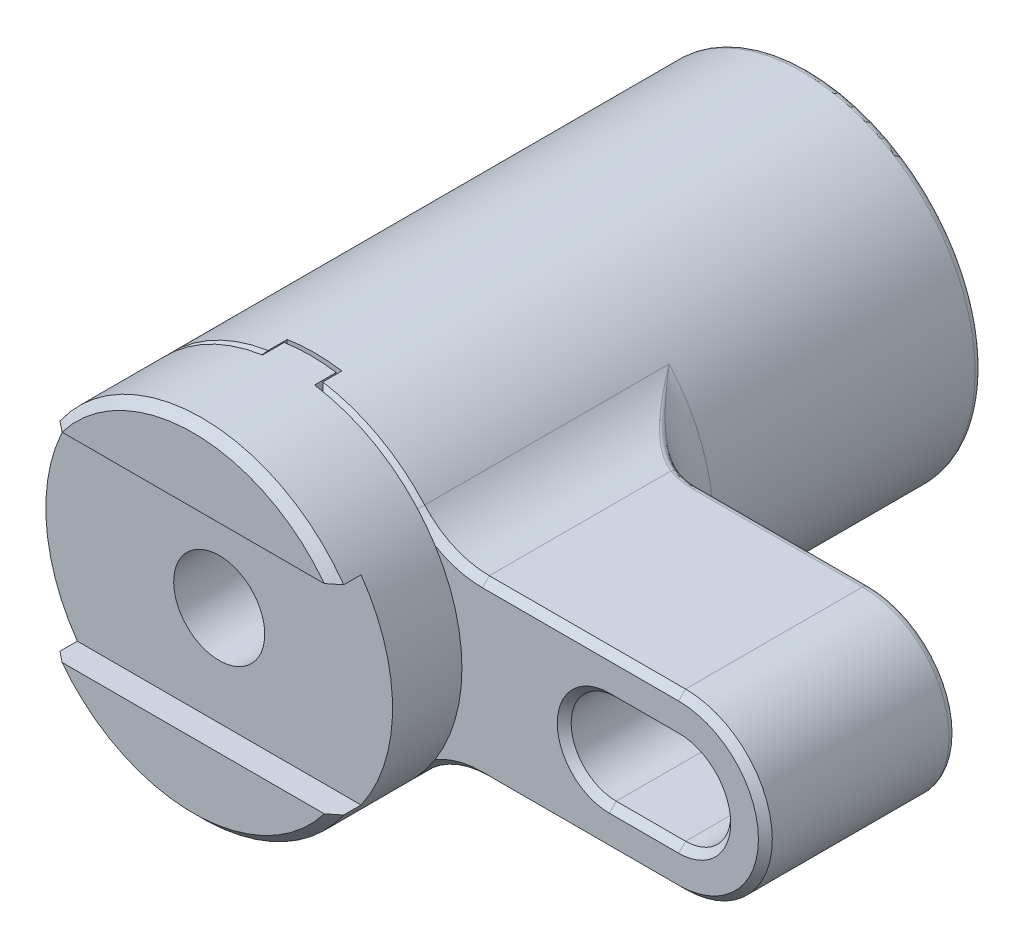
ISO-10303-21;
HEADER;
FILE_DESCRIPTION(('STEP AP214'),'2;1');
FILE_NAME('part.step','',(''),(''),'','','');
FILE_SCHEMA(('AUTOMOTIVE_DESIGN { 1 0 10303 214 1 1 1 1 }'));
ENDSEC;
DATA;
#1=APPLICATION_CONTEXT('core data for automotive mechanical design processes');
#2=APPLICATION_PROTOCOL_DEFINITION('international standard','automotive_design',2000,#1);
#3=PRODUCT_CONTEXT('',#1,'mechanical');
#4=PRODUCT('Part','Part','',(#3));
#5=PRODUCT_RELATED_PRODUCT_CATEGORY('part','',(#4));
#6=PRODUCT_DEFINITION_FORMATION('','',#4);
#7=PRODUCT_DEFINITION_CONTEXT('part definition',#1,'design');
#8=PRODUCT_DEFINITION('design','',#6,#7);
#9=PRODUCT_DEFINITION_SHAPE('','',#8);
#10=(LENGTH_UNIT() NAMED_UNIT(*) SI_UNIT(.MILLI.,.METRE.));
#11=(NAMED_UNIT(*) PLANE_ANGLE_UNIT() SI_UNIT($,.RADIAN.));
#12=(NAMED_UNIT(*) SI_UNIT($,.STERADIAN.) SOLID_ANGLE_UNIT());
#13=UNCERTAINTY_MEASURE_WITH_UNIT(LENGTH_MEASURE(1.E-05),#10,'distance_accuracy_value','');
#14=(GEOMETRIC_REPRESENTATION_CONTEXT(3) GLOBAL_UNCERTAINTY_ASSIGNED_CONTEXT((#13)) GLOBAL_UNIT_ASSIGNED_CONTEXT((#10,
#11,#12)) REPRESENTATION_CONTEXT('',''));
#15=CARTESIAN_POINT('',(0.,0.,0.));
#16=DIRECTION('',(0.,0.,1.));
#17=DIRECTION('',(1.,0.,0.));
#18=AXIS2_PLACEMENT_3D('',#15,#16,#17);
#19=CARTESIAN_POINT('',(0.,0.,38.));
#20=DIRECTION('',(0.,0.,1.));
#21=DIRECTION('',(0.,1.,0.));
#22=AXIS2_PLACEMENT_3D('',#19,#20,#21);
#23=CYLINDRICAL_SURFACE('',#22,6.75);
#24=DIRECTION('',(0.,0.,1.));
#25=VECTOR('',#24,1.);
#26=CARTESIAN_POINT('',(3.14999999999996,-5.96992462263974,38.));
#27=LINE('',#26,#25);
#28=CARTESIAN_POINT('',(3.14999999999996,-5.96992462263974,59.2));
#29=VERTEX_POINT('',#28);
#30=CARTESIAN_POINT('',(3.14999999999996,-5.96992462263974,57.));
#31=VERTEX_POINT('',#30);
#32=EDGE_CURVE('E1146',#29,#31,#27,.F.);
#33=ORIENTED_EDGE('',*,*,#32,.F.);
#34=CARTESIAN_POINT('',(0.,0.,56.05));
#35=DIRECTION('',(-0.707106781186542,0.,0.707106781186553));
#36=DIRECTION('',(0.707106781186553,0.,0.707106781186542));
#37=AXIS2_PLACEMENT_3D('',#34,#35,#36);
#38=ELLIPSE('',#37,9.54594154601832,6.75);
#39=CARTESIAN_POINT('',(3.95,-5.47357287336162,60.));
#40=VERTEX_POINT('',#39);
#41=EDGE_CURVE('E1526',#29,#40,#38,.T.);
#42=ORIENTED_EDGE('',*,*,#41,.T.);
#43=CARTESIAN_POINT('',(0.,0.,60.));
#44=DIRECTION('',(0.,0.,1.));
#45=DIRECTION('',(0.,1.,0.));
#46=AXIS2_PLACEMENT_3D('',#43,#44,#45);
#47=CIRCLE('',#46,6.75);
#48=CARTESIAN_POINT('',(3.95,5.4735728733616,60.));
#49=VERTEX_POINT('',#48);
#50=EDGE_CURVE('E1107',#40,#49,#47,.T.);
#51=ORIENTED_EDGE('',*,*,#50,.T.);
#52=CARTESIAN_POINT('',(0.,0.,56.05));
#53=DIRECTION('',(-0.707106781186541,0.,0.707106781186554));
#54=DIRECTION('',(0.707106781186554,0.,0.707106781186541));
#55=AXIS2_PLACEMENT_3D('',#52,#53,#54);
#56=ELLIPSE('',#55,9.54594154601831,6.75);
#57=CARTESIAN_POINT('',(3.15,5.96992462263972,59.2));
#58=VERTEX_POINT('',#57);
#59=EDGE_CURVE('E1513',#49,#58,#56,.T.);
#60=ORIENTED_EDGE('',*,*,#59,.T.);
#61=DIRECTION('',(0.,0.,1.));
#62=VECTOR('',#61,1.);
#63=CARTESIAN_POINT('',(3.15,5.96992462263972,38.));
#64=LINE('',#63,#62);
#65=CARTESIAN_POINT('',(3.15,5.96992462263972,57.));
#66=VERTEX_POINT('',#65);
#67=EDGE_CURVE('E1135',#66,#58,#64,.T.);
#68=ORIENTED_EDGE('',*,*,#67,.F.);
#69=CARTESIAN_POINT('',(0.,0.,57.));
#70=DIRECTION('',(0.,0.,1.));
#71=DIRECTION('',(0.,1.,0.));
#72=AXIS2_PLACEMENT_3D('',#69,#70,#71);
#73=CIRCLE('',#72,6.75);
#74=CARTESIAN_POINT('',(-3.15,5.96992462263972,57.));
#75=VERTEX_POINT('',#74);
#76=EDGE_CURVE('E1132',#66,#75,#73,.T.);
#77=ORIENTED_EDGE('',*,*,#76,.T.);
#78=DIRECTION('',(0.,0.,1.));
#79=VECTOR('',#78,1.);
#80=CARTESIAN_POINT('',(-3.15,5.96992462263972,38.));
#81=LINE('',#80,#79);
#82=CARTESIAN_POINT('',(-3.15,5.96992462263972,59.2));
#83=VERTEX_POINT('',#82);
#84=EDGE_CURVE('E1138',#83,#75,#81,.F.);
#85=ORIENTED_EDGE('',*,*,#84,.F.);
#86=CARTESIAN_POINT('',(0.,0.,56.05));
#87=DIRECTION('',(0.707106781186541,0.,0.707106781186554));
#88=DIRECTION('',(-0.707106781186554,0.,0.707106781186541));
#89=AXIS2_PLACEMENT_3D('',#86,#87,#88);
#90=ELLIPSE('',#89,9.54594154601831,6.75);
#91=CARTESIAN_POINT('',(-3.95,5.47357287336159,60.));
#92=VERTEX_POINT('',#91);
#93=EDGE_CURVE('E1521',#83,#92,#90,.T.);
#94=ORIENTED_EDGE('',*,*,#93,.T.);
#95=CARTESIAN_POINT('',(-3.95000000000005,-5.47357287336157,60.));
#96=VERTEX_POINT('',#95);
#97=EDGE_CURVE('E1116',#92,#96,#47,.T.);
#98=ORIENTED_EDGE('',*,*,#97,.T.);
#99=CARTESIAN_POINT('',(0.,0.,56.05));
#100=DIRECTION('',(0.707106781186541,0.,0.707106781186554));
#101=DIRECTION('',(-0.707106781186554,0.,0.707106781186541));
#102=AXIS2_PLACEMENT_3D('',#99,#100,#101);
#103=ELLIPSE('',#102,9.5459415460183,6.75);
#104=CARTESIAN_POINT('',(-3.15000000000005,-5.9699246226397,59.2));
#105=VERTEX_POINT('',#104);
#106=EDGE_CURVE('E1524',#96,#105,#103,.T.);
#107=ORIENTED_EDGE('',*,*,#106,.T.);
#108=DIRECTION('',(0.,0.,1.));
#109=VECTOR('',#108,1.);
#110=CARTESIAN_POINT('',(-3.15000000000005,-5.9699246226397,38.));
#111=LINE('',#110,#109);
#112=CARTESIAN_POINT('',(-3.15000000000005,-5.9699246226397,57.));
#113=VERTEX_POINT('',#112);
#114=EDGE_CURVE('E1143',#113,#105,#111,.T.);
#115=ORIENTED_EDGE('',*,*,#114,.F.);
#116=CARTESIAN_POINT('',(0.,0.,57.));
#117=DIRECTION('',(0.,0.,1.));
#118=DIRECTION('',(0.,1.,0.));
#119=AXIS2_PLACEMENT_3D('',#116,#117,#118);
#120=CIRCLE('',#119,6.75);
#121=EDGE_CURVE('E1140',#113,#31,#120,.T.);
#122=ORIENTED_EDGE('',*,*,#121,.T.);
#123=EDGE_LOOP('',(#33,#42,#51,#60,#68,#77,#85,#94,#98,#107,#115,#122));
#124=FACE_BOUND('',#123,.T.);
#125=CARTESIAN_POINT('',(0.,0.,36.));
#126=DIRECTION('',(0.,0.,-1.));
#127=DIRECTION('',(0.,-1.,0.));
#128=AXIS2_PLACEMENT_3D('',#125,#126,#127);
#129=CIRCLE('',#128,6.75);
#130=CARTESIAN_POINT('',(0.,-6.75,36.));
#131=VERTEX_POINT('',#130);
#132=EDGE_CURVE('E19',#131,#131,#129,.T.);
#133=ORIENTED_EDGE('',*,*,#132,.T.);
#134=EDGE_LOOP('',(#133));
#135=FACE_BOUND('',#134,.T.);
#136=ADVANCED_FACE('F14',(#124,#135),#23,.F.);
#137=CARTESIAN_POINT('',(0.,0.,60.));
#138=DIRECTION('',(0.,0.,-1.));
#139=DIRECTION('',(0.,-1.,0.));
#140=AXIS2_PLACEMENT_3D('',#137,#138,#139);
#141=CYLINDRICAL_SURFACE('',#140,20.);
#142=CARTESIAN_POINT('',(0.,0.,47.25));
#143=DIRECTION('',(0.,0.,-1.));
#144=DIRECTION('',(0.,-1.,0.));
#145=AXIS2_PLACEMENT_3D('',#142,#143,#144);
#146=CIRCLE('',#145,20.);
#147=CARTESIAN_POINT('',(-19.9436706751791,-1.5,47.25));
#148=VERTEX_POINT('',#147);
#149=CARTESIAN_POINT('',(-19.0787840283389,6.,47.25));
#150=VERTEX_POINT('',#149);
#151=EDGE_CURVE('E443',#148,#150,#146,.T.);
#152=ORIENTED_EDGE('',*,*,#151,.F.);
#153=DIRECTION('',(0.,0.,-1.));
#154=VECTOR('',#153,1.);
#155=CARTESIAN_POINT('',(-19.9436706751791,-1.5,60.));
#156=LINE('',#155,#154);
#157=CARTESIAN_POINT('',(-19.9436706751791,-1.5,46.25));
#158=VERTEX_POINT('',#157);
#159=EDGE_CURVE('E134',#148,#158,#156,.T.);
#160=ORIENTED_EDGE('',*,*,#159,.T.);
#161=CARTESIAN_POINT('',(-18.9940275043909,-6.26313972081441,49.));
#162=CARTESIAN_POINT('',(-19.3758491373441,-5.10501653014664,48.3313572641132));
#163=CARTESIAN_POINT('',(-19.6139735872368,-3.91050381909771,47.6417050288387));
#164=CARTESIAN_POINT('',(-19.8521907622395,-2.71552596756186,46.9517842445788));
#165=CARTESIAN_POINT('',(-19.9436706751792,-1.5,46.25));
#166=B_SPLINE_CURVE_WITH_KNOTS('',2,(#161,#162,#163,#164,#165),.UNSPECIFIED.,.F.,.F.,(3,2,3),
(0.,0.5,1.),.UNSPECIFIED.);
#167=CARTESIAN_POINT('',(-18.9940275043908,-6.2631397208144,49.));
#168=VERTEX_POINT('',#167);
#169=EDGE_CURVE('E2260',#168,#158,#166,.T.);
#170=ORIENTED_EDGE('',*,*,#169,.F.);
#171=CARTESIAN_POINT('',(-19.9436706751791,-1.5,51.75));
#172=CARTESIAN_POINT('',(-19.8521549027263,-2.71600244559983,51.0479406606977));
#173=CARTESIAN_POINT('',(-19.6139735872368,-3.91050381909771,50.3582949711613));
#174=CARTESIAN_POINT('',(-19.3756995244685,-5.10547032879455,49.6683807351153));
#175=CARTESIAN_POINT('',(-18.9940275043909,-6.26313972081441,49.));
#176=B_SPLINE_CURVE_WITH_KNOTS('',2,(#171,#172,#173,#174,#175),.UNSPECIFIED.,.F.,.F.,(3,2,3),
(0.,0.5,1.),.UNSPECIFIED.);
#177=CARTESIAN_POINT('',(-19.9436706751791,-1.5,51.75));
#178=VERTEX_POINT('',#177);
#179=EDGE_CURVE('E2219',#178,#168,#176,.T.);
#180=ORIENTED_EDGE('',*,*,#179,.F.);
#181=DIRECTION('',(0.,0.,-1.));
#182=VECTOR('',#181,1.);
#183=CARTESIAN_POINT('',(-19.9436706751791,-1.5,60.));
#184=LINE('',#183,#182);
#185=CARTESIAN_POINT('',(-19.9436706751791,-1.5,50.75));
#186=VERTEX_POINT('',#185);
#187=EDGE_CURVE('E2214',#178,#186,#184,.T.);
#188=ORIENTED_EDGE('',*,*,#187,.T.);
#189=CARTESIAN_POINT('',(0.,0.,50.75));
#190=DIRECTION('',(0.,0.,1.));
#191=DIRECTION('',(0.,1.,0.));
#192=AXIS2_PLACEMENT_3D('',#189,#190,#191);
#193=CIRCLE('',#192,20.);
#194=CARTESIAN_POINT('',(-19.0787840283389,6.,50.75));
#195=VERTEX_POINT('',#194);
#196=EDGE_CURVE('E417',#195,#186,#193,.T.);
#197=ORIENTED_EDGE('',*,*,#196,.F.);
#198=DIRECTION('',(0.,0.,-1.));
#199=VECTOR('',#198,1.);
#200=CARTESIAN_POINT('',(-19.0787840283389,6.,60.));
#201=LINE('',#200,#199);
#202=EDGE_CURVE('E403',#195,#150,#201,.T.);
#203=ORIENTED_EDGE('',*,*,#202,.T.);
#204=EDGE_LOOP('',(#152,#160,#170,#180,#188,#197,#203));
#205=FACE_BOUND('',#204,.T.);
#206=ADVANCED_FACE('F642',(#205),#141,.T.);
#207=CARTESIAN_POINT('',(-19.6436706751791,-1.5,60.));
#208=DIRECTION('',(0.,1.,0.));
#209=DIRECTION('',(-1.,0.,0.));
#210=AXIS2_PLACEMENT_3D('',#207,#208,#209);
#211=PLANE('',#210);
#212=ORIENTED_EDGE('',*,*,#187,.F.);
#213=DIRECTION('',(-1.,0.,0.));
#214=VECTOR('',#213,1.);
#215=CARTESIAN_POINT('',(-19.6436706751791,-1.5,51.75));
#216=LINE('',#215,#214);
#217=CARTESIAN_POINT('',(-19.6436706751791,-1.5,51.75));
#218=VERTEX_POINT('',#217);
#219=EDGE_CURVE('E2205',#218,#178,#216,.T.);
#220=ORIENTED_EDGE('',*,*,#219,.F.);
#221=DIRECTION('',(0.,0.,-1.));
#222=VECTOR('',#221,1.);
#223=CARTESIAN_POINT('',(-19.6436706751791,-1.5,60.));
#224=LINE('',#223,#222);
#225=CARTESIAN_POINT('',(-19.6436706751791,-1.5,50.75));
#226=VERTEX_POINT('',#225);
#227=EDGE_CURVE('E2213',#218,#226,#224,.T.);
#228=ORIENTED_EDGE('',*,*,#227,.T.);
#229=DIRECTION('',(-1.,0.,0.));
#230=VECTOR('',#229,1.);
#231=CARTESIAN_POINT('',(-19.6436706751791,-1.5,50.75));
#232=LINE('',#231,#230);
#233=EDGE_CURVE('E414',#226,#186,#232,.T.);
#234=ORIENTED_EDGE('',*,*,#233,.T.);
#235=EDGE_LOOP('',(#212,#220,#228,#234));
#236=FACE_BOUND('',#235,.T.);
#237=ADVANCED_FACE('F766',(#236),#211,.T.);
#238=CARTESIAN_POINT('',(-19.6436706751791,-1.5,50.75));
#239=DIRECTION('',(0.,0.,-1.));
#240=DIRECTION('',(0.,-1.,0.));
#241=AXIS2_PLACEMENT_3D('',#238,#239,#240);
#242=PLANE('',#241);
#243=ORIENTED_EDGE('',*,*,#196,.T.);
#244=ORIENTED_EDGE('',*,*,#233,.F.);
#245=CARTESIAN_POINT('',(0.3,0.,50.75));
#246=DIRECTION('',(0.,0.,1.));
#247=DIRECTION('',(0.,1.,0.));
#248=AXIS2_PLACEMENT_3D('',#245,#246,#247);
#249=CIRCLE('',#248,20.);
#250=CARTESIAN_POINT('',(-18.7787840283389,6.,50.75));
#251=VERTEX_POINT('',#250);
#252=EDGE_CURVE('E410',#251,#226,#249,.T.);
#253=ORIENTED_EDGE('',*,*,#252,.F.);
#254=DIRECTION('',(-1.,0.,0.));
#255=VECTOR('',#254,1.);
#256=CARTESIAN_POINT('',(-18.7787840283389,6.,50.75));
#257=LINE('',#256,#255);
#258=EDGE_CURVE('E394',#251,#195,#257,.T.);
#259=ORIENTED_EDGE('',*,*,#258,.T.);
#260=EDGE_LOOP('',(#243,#244,#253,#259));
#261=FACE_BOUND('',#260,.T.);
#262=ADVANCED_FACE('F411',(#261),#242,.F.);
#263=CARTESIAN_POINT('',(-18.7787840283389,6.,60.));
#264=DIRECTION('',(0.,1.,0.));
#265=DIRECTION('',(-1.,0.,0.));
#266=AXIS2_PLACEMENT_3D('',#263,#264,#265);
#267=PLANE('',#266);
#268=ORIENTED_EDGE('',*,*,#202,.F.);
#269=ORIENTED_EDGE('',*,*,#258,.F.);
#270=DIRECTION('',(0.,0.,-1.));
#271=VECTOR('',#270,1.);
#272=CARTESIAN_POINT('',(-18.7787840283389,6.,60.));
#273=LINE('',#272,#271);
#274=CARTESIAN_POINT('',(-18.7787840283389,6.,47.25));
#275=VERTEX_POINT('',#274);
#276=EDGE_CURVE('E399',#251,#275,#273,.T.);
#277=ORIENTED_EDGE('',*,*,#276,.T.);
#278=DIRECTION('',(-1.,0.,0.));
#279=VECTOR('',#278,1.);
#280=CARTESIAN_POINT('',(-18.7787840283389,6.,47.25));
#281=LINE('',#280,#279);
#282=EDGE_CURVE('E433',#275,#150,#281,.T.);
#283=ORIENTED_EDGE('',*,*,#282,.T.);
#284=EDGE_LOOP('',(#268,#269,#277,#283));
#285=FACE_BOUND('',#284,.T.);
#286=ADVANCED_FACE('F396',(#285),#267,.T.);
#287=CARTESIAN_POINT('',(-18.7787840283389,6.,47.25));
#288=DIRECTION('',(0.,0.,1.));
#289=DIRECTION('',(0.,1.,0.));
#290=AXIS2_PLACEMENT_3D('',#287,#288,#289);
#291=PLANE('',#290);
#292=ORIENTED_EDGE('',*,*,#151,.T.);
#293=ORIENTED_EDGE('',*,*,#282,.F.);
#294=CARTESIAN_POINT('',(0.3,0.,47.25));
#295=DIRECTION('',(0.,0.,-1.));
#296=DIRECTION('',(0.,-1.,0.));
#297=AXIS2_PLACEMENT_3D('',#294,#295,#296);
#298=CIRCLE('',#297,20.);
#299=CARTESIAN_POINT('',(-19.6436706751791,-1.5,47.25));
#300=VERTEX_POINT('',#299);
#301=EDGE_CURVE('E424',#300,#275,#298,.T.);
#302=ORIENTED_EDGE('',*,*,#301,.F.);
#303=DIRECTION('',(-1.,0.,0.));
#304=VECTOR('',#303,1.);
#305=CARTESIAN_POINT('',(-19.6436706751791,-1.5,47.25));
#306=LINE('',#305,#304);
#307=EDGE_CURVE('E440',#300,#148,#306,.T.);
#308=ORIENTED_EDGE('',*,*,#307,.T.);
#309=EDGE_LOOP('',(#292,#293,#302,#308));
#310=FACE_BOUND('',#309,.T.);
#311=ADVANCED_FACE('F2163',(#310),#291,.F.);
#312=CARTESIAN_POINT('',(-19.6436706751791,-1.5,60.));
#313=DIRECTION('',(0.,1.,0.));
#314=DIRECTION('',(-1.,0.,0.));
#315=AXIS2_PLACEMENT_3D('',#312,#313,#314);
#316=PLANE('',#315);
#317=ORIENTED_EDGE('',*,*,#159,.F.);
#318=ORIENTED_EDGE('',*,*,#307,.F.);
#319=DIRECTION('',(0.,0.,-1.));
#320=VECTOR('',#319,1.);
#321=CARTESIAN_POINT('',(-19.6436706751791,-1.5,60.));
#322=LINE('',#321,#320);
#323=CARTESIAN_POINT('',(-19.6436706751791,-1.5,46.25));
#324=VERTEX_POINT('',#323);
#325=EDGE_CURVE('E2251',#300,#324,#322,.T.);
#326=ORIENTED_EDGE('',*,*,#325,.T.);
#327=DIRECTION('',(-1.,0.,0.));
#328=VECTOR('',#327,1.);
#329=CARTESIAN_POINT('',(-19.6436706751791,-1.5,46.25));
#330=LINE('',#329,#328);
#331=EDGE_CURVE('E2252',#324,#158,#330,.T.);
#332=ORIENTED_EDGE('',*,*,#331,.T.);
#333=EDGE_LOOP('',(#317,#318,#326,#332));
#334=FACE_BOUND('',#333,.T.);
#335=ADVANCED_FACE('F2171',(#334),#316,.T.);
#336=CARTESIAN_POINT('',(-19.6436706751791,-1.5,46.25));
#337=DIRECTION('',(0.,0.5,0.866025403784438));
#338=DIRECTION('',(0.,0.866025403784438,-0.5));
#339=AXIS2_PLACEMENT_3D('',#336,#337,#338);
#340=PLANE('',#339);
#341=ORIENTED_EDGE('',*,*,#169,.T.);
#342=ORIENTED_EDGE('',*,*,#331,.F.);
#343=CARTESIAN_POINT('',(-18.6940275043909,-6.26313972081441,49.));
#344=CARTESIAN_POINT('',(-18.7539544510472,-6.08140094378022,48.8950685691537));
#345=CARTESIAN_POINT('',(-18.8112067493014,-5.89900350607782,48.7897516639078));
#346=CARTESIAN_POINT('',(-18.9227055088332,-5.52514803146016,48.5738878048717));
#347=CARTESIAN_POINT('',(-18.9767171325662,-5.3336374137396,48.4633105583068));
#348=CARTESIAN_POINT('',(-19.0810240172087,-4.94153247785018,48.2369266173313));
#349=CARTESIAN_POINT('',(-19.1310744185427,-4.74088904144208,48.1210921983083));
#350=CARTESIAN_POINT('',(-19.2267163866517,-4.33052773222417,47.8841940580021));
#351=CARTESIAN_POINT('',(-19.2720530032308,-4.12076506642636,47.7631048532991));
#352=CARTESIAN_POINT('',(-19.3492496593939,-3.73356947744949,47.5395473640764));
#353=CARTESIAN_POINT('',(-19.3821067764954,-3.55628208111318,47.4371697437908));
#354=CARTESIAN_POINT('',(-19.4455661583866,-3.18603501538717,47.2233699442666));
#355=CARTESIAN_POINT('',(-19.4757415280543,-2.99302012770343,47.1119163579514));
#356=CARTESIAN_POINT('',(-19.5325391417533,-2.59127344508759,46.8799651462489));
#357=CARTESIAN_POINT('',(-19.5586997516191,-2.38249160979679,46.7594410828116));
#358=CARTESIAN_POINT('',(-19.6060631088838,-1.94923637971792,46.509339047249));
#359=CARTESIAN_POINT('',(-19.6267693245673,-1.72472205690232,46.379737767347));
#360=CARTESIAN_POINT('',(-19.6436706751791,-1.5,46.25));
#361=B_SPLINE_CURVE_WITH_KNOTS('',3,(#343,#344,#345,#346,#347,#348,#349,#350,#351,#352,#353,
#354,#355,#356,#357,#358,#359,#360),.UNSPECIFIED.,.F.,.F.,(4,2,2,2,2,2,2,2,4),(0.,
0.65471650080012,1.33756326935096,2.04854867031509,2.78768008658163,3.40965742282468,
4.08433128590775,4.81170346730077,5.5917752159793),.UNSPECIFIED.);
#362=CARTESIAN_POINT('',(-18.6940275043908,-6.2631397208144,49.));
#363=VERTEX_POINT('',#362);
#364=EDGE_CURVE('E2257',#363,#324,#361,.T.);
#365=ORIENTED_EDGE('',*,*,#364,.F.);
#366=DIRECTION('',(-1.,0.,0.));
#367=VECTOR('',#366,1.);
#368=CARTESIAN_POINT('',(-18.6940275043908,-6.26313972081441,49.));
#369=LINE('',#368,#367);
#370=EDGE_CURVE('E2266',#363,#168,#369,.T.);
#371=ORIENTED_EDGE('',*,*,#370,.T.);
#372=EDGE_LOOP('',(#341,#342,#365,#371));
#373=FACE_BOUND('',#372,.T.);
#374=ADVANCED_FACE('F1457',(#373),#340,.F.);
#375=CARTESIAN_POINT('',(-18.6940275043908,-6.26313972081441,49.));
#376=DIRECTION('',(0.,0.5,-0.866025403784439));
#377=DIRECTION('',(0.,-0.866025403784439,-0.5));
#378=AXIS2_PLACEMENT_3D('',#375,#376,#377);
#379=PLANE('',#378);
#380=ORIENTED_EDGE('',*,*,#179,.T.);
#381=ORIENTED_EDGE('',*,*,#370,.F.);
#382=CARTESIAN_POINT('',(-19.6436706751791,-1.5,51.75));
#383=CARTESIAN_POINT('',(-19.6267688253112,-1.7247286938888,51.6202584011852));
#384=CARTESIAN_POINT('',(-19.6060618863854,-1.9492496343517,51.4906532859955));
#385=CARTESIAN_POINT('',(-19.5586971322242,-2.38251363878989,51.2405461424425));
#386=CARTESIAN_POINT('',(-19.532536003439,-2.59129764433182,51.1200207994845));
#387=CARTESIAN_POINT('',(-19.4757378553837,-2.99304424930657,50.8880695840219));
#388=CARTESIAN_POINT('',(-19.445562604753,-3.18605690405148,50.7766172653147));
#389=CARTESIAN_POINT('',(-19.3821043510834,-3.55629516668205,50.5628225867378));
#390=CARTESIAN_POINT('',(-19.3492483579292,-3.73357600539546,50.4604488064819));
#391=CARTESIAN_POINT('',(-19.2720521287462,-4.12076945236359,50.2368926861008));
#392=CARTESIAN_POINT('',(-19.2267144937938,-4.3305364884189,50.1158010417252));
#393=CARTESIAN_POINT('',(-19.1310708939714,-4.74090355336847,49.8788996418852));
#394=CARTESIAN_POINT('',(-19.0810199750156,-4.94154839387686,49.7630643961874));
#395=CARTESIAN_POINT('',(-18.9767127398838,-5.33365323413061,49.5366804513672));
#396=CARTESIAN_POINT('',(-18.9227013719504,-5.52516237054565,49.426104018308));
#397=CARTESIAN_POINT('',(-18.8112040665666,-5.89901205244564,49.2102434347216));
#398=CARTESIAN_POINT('',(-18.7539530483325,-6.08140519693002,49.1049289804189));
#399=CARTESIAN_POINT('',(-18.6940275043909,-6.26313972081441,49.));
#400=B_SPLINE_CURVE_WITH_KNOTS('',3,(#382,#383,#384,#385,#386,#387,#388,#389,#390,#391,#392,
#393,#394,#395,#396,#397,#398,#399),.UNSPECIFIED.,.F.,.F.,(4,2,2,2,2,2,2,2,4),(0.,
0.780094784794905,1.50747464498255,2.18214082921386,2.80409512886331,3.54324185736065,
4.25423236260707,4.93707402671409,5.59177521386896),.UNSPECIFIED.);
#401=EDGE_CURVE('E551',#218,#363,#400,.T.);
#402=ORIENTED_EDGE('',*,*,#401,.F.);
#403=ORIENTED_EDGE('',*,*,#219,.T.);
#404=EDGE_LOOP('',(#380,#381,#402,#403));
#405=FACE_BOUND('',#404,.T.);
#406=ADVANCED_FACE('F1450',(#405),#379,.F.);
#407=CARTESIAN_POINT('',(0.,-6.,38.8));
#408=DIRECTION('',(1.,0.,0.));
#409=DIRECTION('',(0.,1.,0.));
#410=AXIS2_PLACEMENT_3D('',#407,#408,#409);
#411=CYLINDRICAL_SURFACE('',#410,0.8);
#412=CARTESIAN_POINT('',(37.,-6.,38.8));
#413=DIRECTION('',(1.,0.,0.));
#414=DIRECTION('',(0.,1.,0.));
#415=AXIS2_PLACEMENT_3D('',#412,#413,#414);
#416=CIRCLE('',#415,0.8);
#417=CARTESIAN_POINT('',(37.,-6.,38.));
#418=VERTEX_POINT('',#417);
#419=CARTESIAN_POINT('',(37.,-5.2,38.8));
#420=VERTEX_POINT('',#419);
#421=EDGE_CURVE('E1463',#418,#420,#416,.T.);
#422=ORIENTED_EDGE('',*,*,#421,.T.);
#423=DIRECTION('',(1.,0.,0.));
#424=VECTOR('',#423,1.);
#425=CARTESIAN_POINT('',(37.,-5.2,38.8));
#426=LINE('',#425,#424);
#427=CARTESIAN_POINT('',(45.,-5.2,38.8));
#428=VERTEX_POINT('',#427);
#429=EDGE_CURVE('E1466',#428,#420,#426,.F.);
#430=ORIENTED_EDGE('',*,*,#429,.F.);
#431=CARTESIAN_POINT('',(45.,-6.,38.8));
#432=DIRECTION('',(-1.,0.,0.));
#433=DIRECTION('',(0.,-1.,0.));
#434=AXIS2_PLACEMENT_3D('',#431,#432,#433);
#435=CIRCLE('',#434,0.8);
#436=CARTESIAN_POINT('',(45.,-6.,38.));
#437=VERTEX_POINT('',#436);
#438=EDGE_CURVE('E902',#428,#437,#435,.T.);
#439=ORIENTED_EDGE('',*,*,#438,.T.);
#440=DIRECTION('',(1.,0.,0.));
#441=VECTOR('',#440,1.);
#442=CARTESIAN_POINT('',(0.,-6.,38.));
#443=LINE('',#442,#441);
#444=EDGE_CURVE('E1469',#418,#437,#443,.T.);
#445=ORIENTED_EDGE('',*,*,#444,.F.);
#446=EDGE_LOOP('',(#422,#430,#439,#445));
#447=FACE_BOUND('',#446,.T.);
#448=ADVANCED_FACE('F1447',(#447),#411,.T.);
#449=CARTESIAN_POINT('',(45.,0.,38.8));
#450=DIRECTION('',(0.,0.,1.));
#451=DIRECTION('',(0.,1.,0.));
#452=AXIS2_PLACEMENT_3D('',#449,#450,#451);
#453=TOROIDAL_SURFACE('',#452,6.,0.8);
#454=CARTESIAN_POINT('',(45.,6.,38.8));
#455=DIRECTION('',(1.,0.,0.));
#456=DIRECTION('',(0.,1.,0.));
#457=AXIS2_PLACEMENT_3D('',#454,#455,#456);
#458=CIRCLE('',#457,0.8);
#459=CARTESIAN_POINT('',(45.,5.2,38.8));
#460=VERTEX_POINT('',#459);
#461=CARTESIAN_POINT('',(45.,6.,38.));
#462=VERTEX_POINT('',#461);
#463=EDGE_CURVE('E1471',#460,#462,#458,.T.);
#464=ORIENTED_EDGE('',*,*,#463,.T.);
#465=CARTESIAN_POINT('',(45.,0.,38.));
#466=DIRECTION('',(0.,0.,1.));
#467=DIRECTION('',(0.,1.,0.));
#468=AXIS2_PLACEMENT_3D('',#465,#466,#467);
#469=CIRCLE('',#468,6.);
#470=EDGE_CURVE('E1369',#437,#462,#469,.T.);
#471=ORIENTED_EDGE('',*,*,#470,.F.);
#472=ORIENTED_EDGE('',*,*,#438,.F.);
#473=CARTESIAN_POINT('',(45.,0.,38.8));
#474=DIRECTION('',(0.,0.,1.));
#475=DIRECTION('',(0.,1.,0.));
#476=AXIS2_PLACEMENT_3D('',#473,#474,#475);
#477=CIRCLE('',#476,5.2);
#478=EDGE_CURVE('E1507',#460,#428,#477,.F.);
#479=ORIENTED_EDGE('',*,*,#478,.F.);
#480=EDGE_LOOP('',(#464,#471,#472,#479));
#481=FACE_BOUND('',#480,.T.);
#482=ADVANCED_FACE('F1440',(#481),#453,.T.);
#483=CARTESIAN_POINT('',(0.,6.,38.8));
#484=DIRECTION('',(-1.,0.,0.));
#485=DIRECTION('',(0.,-1.,0.));
#486=AXIS2_PLACEMENT_3D('',#483,#484,#485);
#487=CYLINDRICAL_SURFACE('',#486,0.8);
#488=ORIENTED_EDGE('',*,*,#463,.F.);
#489=DIRECTION('',(-1.,0.,0.));
#490=VECTOR('',#489,1.);
#491=CARTESIAN_POINT('',(37.,5.2,38.8));
#492=LINE('',#491,#490);
#493=CARTESIAN_POINT('',(37.,5.2,38.8));
#494=VERTEX_POINT('',#493);
#495=EDGE_CURVE('E1480',#494,#460,#492,.F.);
#496=ORIENTED_EDGE('',*,*,#495,.F.);
#497=CARTESIAN_POINT('',(37.,6.,38.8));
#498=DIRECTION('',(-1.,0.,0.));
#499=DIRECTION('',(0.,-1.,0.));
#500=AXIS2_PLACEMENT_3D('',#497,#498,#499);
#501=CIRCLE('',#500,0.8);
#502=CARTESIAN_POINT('',(37.,6.,38.));
#503=VERTEX_POINT('',#502);
#504=EDGE_CURVE('E1476',#503,#494,#501,.T.);
#505=ORIENTED_EDGE('',*,*,#504,.F.);
#506=DIRECTION('',(-1.,0.,0.));
#507=VECTOR('',#506,1.);
#508=CARTESIAN_POINT('',(0.,6.,38.));
#509=LINE('',#508,#507);
#510=EDGE_CURVE('E1370',#462,#503,#509,.T.);
#511=ORIENTED_EDGE('',*,*,#510,.F.);
#512=EDGE_LOOP('',(#488,#496,#505,#511));
#513=FACE_BOUND('',#512,.T.);
#514=ADVANCED_FACE('F1437',(#513),#487,.T.);
#515=CARTESIAN_POINT('',(37.,0.,38.8));
#516=DIRECTION('',(0.,0.,1.));
#517=DIRECTION('',(0.,1.,0.));
#518=AXIS2_PLACEMENT_3D('',#515,#516,#517);
#519=TOROIDAL_SURFACE('',#518,6.,0.8);
#520=ORIENTED_EDGE('',*,*,#504,.T.);
#521=CARTESIAN_POINT('',(37.,0.,38.8));
#522=DIRECTION('',(0.,0.,1.));
#523=DIRECTION('',(0.,1.,0.));
#524=AXIS2_PLACEMENT_3D('',#521,#522,#523);
#525=CIRCLE('',#524,5.2);
#526=EDGE_CURVE('E1474',#420,#494,#525,.F.);
#527=ORIENTED_EDGE('',*,*,#526,.F.);
#528=ORIENTED_EDGE('',*,*,#421,.F.);
#529=CARTESIAN_POINT('',(37.,0.,38.));
#530=DIRECTION('',(0.,0.,1.));
#531=DIRECTION('',(0.,1.,0.));
#532=AXIS2_PLACEMENT_3D('',#529,#530,#531);
#533=CIRCLE('',#532,6.);
#534=EDGE_CURVE('E2391',#503,#418,#533,.T.);
#535=ORIENTED_EDGE('',*,*,#534,.F.);
#536=EDGE_LOOP('',(#520,#527,#528,#535));
#537=FACE_BOUND('',#536,.T.);
#538=ADVANCED_FACE('F1238',(#537),#519,.T.);
#539=CARTESIAN_POINT('',(45.,0.,38.8));
#540=DIRECTION('',(0.,0.,1.));
#541=DIRECTION('',(0.,1.,0.));
#542=AXIS2_PLACEMENT_3D('',#539,#540,#541);
#543=TOROIDAL_SURFACE('',#542,9.2,0.8);
#544=CARTESIAN_POINT('',(45.,9.2,38.8));
#545=DIRECTION('',(1.,0.,0.));
#546=DIRECTION('',(0.,1.,0.));
#547=AXIS2_PLACEMENT_3D('',#544,#545,#546);
#548=CIRCLE('',#547,0.8);
#549=CARTESIAN_POINT('',(45.,9.2,38.));
#550=VERTEX_POINT('',#549);
#551=CARTESIAN_POINT('',(45.,10.,38.8));
#552=VERTEX_POINT('',#551);
#553=EDGE_CURVE('E1362',#550,#552,#548,.T.);
#554=ORIENTED_EDGE('',*,*,#553,.T.);
#555=CARTESIAN_POINT('',(45.,0.,38.8));
#556=DIRECTION('',(0.,0.,1.));
#557=DIRECTION('',(0.,1.,0.));
#558=AXIS2_PLACEMENT_3D('',#555,#556,#557);
#559=CIRCLE('',#558,10.);
#560=CARTESIAN_POINT('',(45.,-10.,38.8));
#561=VERTEX_POINT('',#560);
#562=EDGE_CURVE('E1366',#561,#552,#559,.T.);
#563=ORIENTED_EDGE('',*,*,#562,.F.);
#564=CARTESIAN_POINT('',(45.,-9.2,38.8));
#565=DIRECTION('',(-1.,0.,0.));
#566=DIRECTION('',(0.,-1.,0.));
#567=AXIS2_PLACEMENT_3D('',#564,#565,#566);
#568=CIRCLE('',#567,0.8);
#569=CARTESIAN_POINT('',(45.,-9.2,38.));
#570=VERTEX_POINT('',#569);
#571=EDGE_CURVE('E1225',#570,#561,#568,.T.);
#572=ORIENTED_EDGE('',*,*,#571,.F.);
#573=CARTESIAN_POINT('',(45.,0.,38.));
#574=DIRECTION('',(0.,0.,1.));
#575=DIRECTION('',(0.,1.,0.));
#576=AXIS2_PLACEMENT_3D('',#573,#574,#575);
#577=CIRCLE('',#576,9.2);
#578=EDGE_CURVE('E1310',#550,#570,#577,.F.);
#579=ORIENTED_EDGE('',*,*,#578,.F.);
#580=EDGE_LOOP('',(#554,#563,#572,#579));
#581=FACE_BOUND('',#580,.T.);
#582=ADVANCED_FACE('F1235',(#581),#543,.T.);
#583=CARTESIAN_POINT('',(17.3205080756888,9.2,38.8));
#584=DIRECTION('',(-1.,0.,0.));
#585=DIRECTION('',(0.,-1.,0.));
#586=AXIS2_PLACEMENT_3D('',#583,#584,#585);
#587=CYLINDRICAL_SURFACE('',#586,0.8);
#588=CARTESIAN_POINT('',(25.3842470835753,9.2,38.8));
#589=DIRECTION('',(1.,0.,0.));
#590=DIRECTION('',(0.,1.,0.));
#591=AXIS2_PLACEMENT_3D('',#588,#589,#590);
#592=CIRCLE('',#591,0.8);
#593=CARTESIAN_POINT('',(25.3842470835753,9.2,38.));
#594=VERTEX_POINT('',#593);
#595=CARTESIAN_POINT('',(25.3842470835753,10.,38.8));
#596=VERTEX_POINT('',#595);
#597=EDGE_CURVE('E1358',#594,#596,#592,.T.);
#598=ORIENTED_EDGE('',*,*,#597,.T.);
#599=DIRECTION('',(-1.,0.,0.));
#600=VECTOR('',#599,1.);
#601=CARTESIAN_POINT('',(17.3205080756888,10.,38.8));
#602=LINE('',#601,#600);
#603=EDGE_CURVE('E1293',#552,#596,#602,.T.);
#604=ORIENTED_EDGE('',*,*,#603,.F.);
#605=ORIENTED_EDGE('',*,*,#553,.F.);
#606=DIRECTION('',(-1.,0.,0.));
#607=VECTOR('',#606,1.);
#608=CARTESIAN_POINT('',(0.,9.2,38.));
#609=LINE('',#608,#607);
#610=EDGE_CURVE('E1313',#594,#550,#609,.F.);
#611=ORIENTED_EDGE('',*,*,#610,.F.);
#612=EDGE_LOOP('',(#598,#604,#605,#611));
#613=FACE_BOUND('',#612,.T.);
#614=ADVANCED_FACE('F1233',(#613),#587,.T.);
#615=CARTESIAN_POINT('',(17.3205080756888,-9.2,38.8));
#616=DIRECTION('',(1.,0.,0.));
#617=DIRECTION('',(0.,1.,0.));
#618=AXIS2_PLACEMENT_3D('',#615,#616,#617);
#619=CYLINDRICAL_SURFACE('',#618,0.8);
#620=ORIENTED_EDGE('',*,*,#571,.T.);
#621=DIRECTION('',(1.,0.,0.));
#622=VECTOR('',#621,1.);
#623=CARTESIAN_POINT('',(17.3205080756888,-10.,38.8));
#624=LINE('',#623,#622);
#625=CARTESIAN_POINT('',(25.3842470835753,-10.,38.8));
#626=VERTEX_POINT('',#625);
#627=EDGE_CURVE('E1311',#626,#561,#624,.T.);
#628=ORIENTED_EDGE('',*,*,#627,.F.);
#629=CARTESIAN_POINT('',(25.3842470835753,-9.2,38.8));
#630=DIRECTION('',(-1.,0.,0.));
#631=DIRECTION('',(0.,-1.,0.));
#632=AXIS2_PLACEMENT_3D('',#629,#630,#631);
#633=CIRCLE('',#632,0.8);
#634=CARTESIAN_POINT('',(25.3842470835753,-9.2,38.));
#635=VERTEX_POINT('',#634);
#636=EDGE_CURVE('E1206',#635,#626,#633,.T.);
#637=ORIENTED_EDGE('',*,*,#636,.F.);
#638=DIRECTION('',(1.,0.,0.));
#639=VECTOR('',#638,1.);
#640=CARTESIAN_POINT('',(0.,-9.2,38.));
#641=LINE('',#640,#639);
#642=EDGE_CURVE('E1294',#570,#635,#641,.F.);
#643=ORIENTED_EDGE('',*,*,#642,.F.);
#644=EDGE_LOOP('',(#620,#628,#637,#643));
#645=FACE_BOUND('',#644,.T.);
#646=ADVANCED_FACE('F1229',(#645),#619,.T.);
#647=CARTESIAN_POINT('',(0.,0.,38.));
#648=DIRECTION('',(0.,0.,1.));
#649=DIRECTION('',(0.,1.,0.));
#650=AXIS2_PLACEMENT_3D('',#647,#648,#649);
#651=PLANE('',#650);
#652=ORIENTED_EDGE('',*,*,#534,.T.);
#653=ORIENTED_EDGE('',*,*,#444,.T.);
#654=ORIENTED_EDGE('',*,*,#470,.T.);
#655=ORIENTED_EDGE('',*,*,#510,.T.);
#656=EDGE_LOOP('',(#652,#653,#654,#655));
#657=FACE_BOUND('',#656,.T.);
#658=ORIENTED_EDGE('',*,*,#578,.T.);
#659=ORIENTED_EDGE('',*,*,#642,.T.);
#660=CARTESIAN_POINT('',(0.,0.,38.));
#661=DIRECTION('',(0.,0.,1.));
#662=DIRECTION('',(0.,1.,0.));
#663=AXIS2_PLACEMENT_3D('',#660,#661,#662);
#664=CIRCLE('',#663,27.);
#665=EDGE_CURVE('E1154',#635,#594,#664,.T.);
#666=ORIENTED_EDGE('',*,*,#665,.T.);
#667=ORIENTED_EDGE('',*,*,#610,.T.);
#668=EDGE_LOOP('',(#658,#659,#666,#667));
#669=FACE_BOUND('',#668,.T.);
#670=ADVANCED_FACE('F1232',(#657,#669),#651,.F.);
#671=CARTESIAN_POINT('',(27.9506998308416,9.11498190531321,37.5759331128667));
#672=CARTESIAN_POINT('',(27.9196996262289,10.,37.4865684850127));
#673=CARTESIAN_POINT('',(28.2114041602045,10.,38.3274683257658));
#674=CARTESIAN_POINT('',(27.7449456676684,9.1212255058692,37.6466211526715));
#675=CARTESIAN_POINT('',(27.7199160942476,10.,37.5632843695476));
#676=CARTESIAN_POINT('',(27.9844041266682,10.,38.4062349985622));
#677=CARTESIAN_POINT('',(27.5360848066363,9.12769179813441,37.7085370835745));
#678=CARTESIAN_POINT('',(27.5156145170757,10.,37.6320831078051));
#679=CARTESIAN_POINT('',(27.7540504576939,10.,38.475227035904));
#680=CARTESIAN_POINT('',(27.1137409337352,9.14105345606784,37.8146881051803));
#681=CARTESIAN_POINT('',(27.1010087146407,10.,37.7524794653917));
#682=CARTESIAN_POINT('',(27.2884157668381,10.,38.5935096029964));
#683=CARTESIAN_POINT('',(26.9002594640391,9.14794867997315,37.858929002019));
#684=CARTESIAN_POINT('',(26.8908568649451,10.,37.8042097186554));
#685=CARTESIAN_POINT('',(27.0531363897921,10.,38.6428066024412));
#686=CARTESIAN_POINT('',(26.4705315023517,9.1621426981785,37.9295736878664));
#687=CARTESIAN_POINT('',(26.4663261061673,10.,37.8900669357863));
#688=CARTESIAN_POINT('',(26.5797228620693,10.,38.7215249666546));
#689=CARTESIAN_POINT('',(26.2542909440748,9.16944071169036,37.9560107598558));
#690=CARTESIAN_POINT('',(26.2520902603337,10.,37.9243707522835));
#691=CARTESIAN_POINT('',(26.3415948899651,10.,38.7509834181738));
#692=CARTESIAN_POINT('',(25.820188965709,9.18442915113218,37.9912305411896));
#693=CARTESIAN_POINT('',(25.8205852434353,10.,37.9753042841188));
#694=CARTESIAN_POINT('',(25.8637676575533,10.,38.7902283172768));
#695=CARTESIAN_POINT('',(25.602327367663,9.19211962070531,38.0000112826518));
#696=CARTESIAN_POINT('',(25.6034221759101,10.,37.9920917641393));
#697=CARTESIAN_POINT('',(25.6240682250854,10.,38.8000125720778));
#698=CARTESIAN_POINT('',(24.9172108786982,9.21687645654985,37.9999758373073));
#699=CARTESIAN_POINT('',(24.922053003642,10.,38.0166768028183));
#700=CARTESIAN_POINT('',(24.8706511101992,10.,38.7999730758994));
#701=CARTESIAN_POINT('',(24.4491717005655,9.23462390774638,37.9596282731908));
#702=CARTESIAN_POINT('',(24.4512669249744,10.,37.9938628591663));
#703=CARTESIAN_POINT('',(24.3564969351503,10.,38.7550143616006));
#704=CARTESIAN_POINT('',(23.5258606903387,9.27146899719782,37.8007042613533));
#705=CARTESIAN_POINT('',(23.5167537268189,10.,37.8656464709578));
#706=CARTESIAN_POINT('',(23.3435011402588,10.,38.5779276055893));
#707=CARTESIAN_POINT('',(23.0705964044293,9.29056741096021,37.6820825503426));
#708=CARTESIAN_POINT('',(23.0532664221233,10.,37.7619966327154));
#709=CARTESIAN_POINT('',(22.8446685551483,10.,38.4457491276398));
#710=CARTESIAN_POINT('',(22.2036058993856,9.32880054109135,37.376708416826));
#711=CARTESIAN_POINT('',(22.165947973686,10.,37.479711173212));
#712=CARTESIAN_POINT('',(21.8961250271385,10.,38.1054750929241));
#713=CARTESIAN_POINT('',(21.7908654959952,9.34790300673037,37.1928829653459));
#714=CARTESIAN_POINT('',(21.74130344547,10.,37.3059244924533));
#715=CARTESIAN_POINT('',(21.4452459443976,10.,37.9006410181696));
#716=CARTESIAN_POINT('',(21.0006973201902,9.38610046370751,36.7610261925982));
#717=CARTESIAN_POINT('',(20.9265505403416,10.,36.8880490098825));
#718=CARTESIAN_POINT('',(20.5833976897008,10.,37.4194291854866));
#719=CARTESIAN_POINT('',(20.6232756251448,9.40519545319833,36.5129838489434));
#720=CARTESIAN_POINT('',(20.5355406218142,10.,36.6451885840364));
#721=CARTESIAN_POINT('',(20.1724353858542,10.,37.1430391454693));
#722=CARTESIAN_POINT('',(20.2693702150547,9.4239019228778,36.2350295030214));
#723=CARTESIAN_POINT('',(20.1640609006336,10.,36.3658604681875));
#724=CARTESIAN_POINT('',(19.7877914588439,10.,36.833318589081));
#725=(BOUNDED_SURFACE() B_SPLINE_SURFACE(3,2,((#671,#672,#673),(#674,#675,#676),(#677,#678,
#679),(#680,#681,#682),(#683,#684,#685),(#686,#687,#688),(#689,#690,#691),(#692,#693,#694),
(#695,#696,#697),(#698,#699,#700),(#701,#702,#703),(#704,#705,#706),(#707,#708,#709),(#710,#711,
#712),(#713,#714,#715),(#716,#717,#718),(#719,#720,#721),(#722,#723,#724)),.UNSPECIFIED.,.F.,
.F.,.F.) B_SPLINE_SURFACE_WITH_KNOTS((4,2,2,2,2,2,2,2,4),(3,3),(0.,0.720555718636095,
1.44087454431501,2.15984301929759,2.8788916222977,4.41879116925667,5.95958196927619,
7.43850402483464,8.91768009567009),(0.,1.),
.UNSPECIFIED.) GEOMETRIC_REPRESENTATION_ITEM() RATIONAL_B_SPLINE_SURFACE(((1.,0.668478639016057,
1.),(1.,0.671397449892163,1.),(1.,0.674401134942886,1.),(1.,0.680564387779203,1.),(1.,
0.683723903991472,1.),(1.,0.690180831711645,1.),(1.,0.693477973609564,1.),(1.,0.700199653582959,
1.),(1.,0.703624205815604,1.),(1.,0.714564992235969,1.),(1.,0.72228931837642,1.),(1.,
0.738058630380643,1.),(1.,0.746103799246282,1.),(1.,0.761944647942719,1.),(1.,0.769737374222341,
1.),(1.,0.785095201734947,1.),(1.,0.792660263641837,1.),(1.,0.799961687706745,1.))) REPRESENTATION_ITEM('') SURFACE());
#726=CARTESIAN_POINT('',(22.3606797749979,9.2,38.2721262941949));
#727=DIRECTION('',(0.941276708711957,0.,0.33763613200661));
#728=DIRECTION('',(0.33763613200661,0.,-0.941276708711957));
#729=AXIS2_PLACEMENT_3D('',#726,#727,#728);
#730=CIRCLE('',#729,0.8);
#731=CARTESIAN_POINT('',(22.6282195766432,9.31007564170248,37.526267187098));
#732=VERTEX_POINT('',#731);
#733=CARTESIAN_POINT('',(22.3606797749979,10.,38.2721262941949));
#734=VERTEX_POINT('',#733);
#735=EDGE_CURVE('E1079',#732,#734,#730,.T.);
#736=ORIENTED_EDGE('',*,*,#735,.T.);
#737=CARTESIAN_POINT('',(28.2114041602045,10.,38.3274683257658));
#738=CARTESIAN_POINT('',(27.9844041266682,10.,38.4062349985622));
#739=CARTESIAN_POINT('',(27.7540504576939,10.,38.475227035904));
#740=CARTESIAN_POINT('',(27.2884157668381,10.,38.5935096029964));
#741=CARTESIAN_POINT('',(27.0531363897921,10.,38.6428066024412));
#742=CARTESIAN_POINT('',(26.5797228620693,10.,38.7215249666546));
#743=CARTESIAN_POINT('',(26.3415948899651,10.,38.7509834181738));
#744=CARTESIAN_POINT('',(25.8637676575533,10.,38.7902283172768));
#745=CARTESIAN_POINT('',(25.6240682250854,10.,38.8000125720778));
#746=CARTESIAN_POINT('',(24.8706511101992,10.,38.7999730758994));
#747=CARTESIAN_POINT('',(24.3564969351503,10.,38.7550143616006));
#748=CARTESIAN_POINT('',(23.3435011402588,10.,38.5779276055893));
#749=CARTESIAN_POINT('',(22.8446685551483,10.,38.4457491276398));
#750=CARTESIAN_POINT('',(21.8961250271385,10.,38.1054750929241));
#751=CARTESIAN_POINT('',(21.4452459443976,10.,37.9006410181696));
#752=CARTESIAN_POINT('',(20.5833976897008,10.,37.4194291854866));
#753=CARTESIAN_POINT('',(20.1724353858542,10.,37.1430391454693));
#754=CARTESIAN_POINT('',(19.7877914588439,10.,36.833318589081));
#755=B_SPLINE_CURVE_WITH_KNOTS('',3,(#737,#738,#739,#740,#741,#742,#743,#744,#745,#746,#747,
#748,#749,#750,#751,#752,#753,#754),.UNSPECIFIED.,.F.,.F.,(4,2,2,2,2,2,2,2,4),(0.,
0.720555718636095,1.44087454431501,2.15984301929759,2.8788916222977,4.41879116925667,
5.95958196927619,7.43850402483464,8.91768009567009),.UNSPECIFIED.);
#756=EDGE_CURVE('E1360',#596,#734,#755,.T.);
#757=ORIENTED_EDGE('',*,*,#756,.F.);
#758=ORIENTED_EDGE('',*,*,#597,.F.);
#759=CARTESIAN_POINT('',(20.2693702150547,9.4239019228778,36.2350295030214));
#760=CARTESIAN_POINT('',(20.6232756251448,9.40519545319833,36.5129838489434));
#761=CARTESIAN_POINT('',(21.0006973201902,9.38610046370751,36.7610261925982));
#762=CARTESIAN_POINT('',(21.7908654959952,9.34790300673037,37.1928829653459));
#763=CARTESIAN_POINT('',(22.2036058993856,9.32880054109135,37.376708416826));
#764=CARTESIAN_POINT('',(23.0705964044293,9.29056741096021,37.6820825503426));
#765=CARTESIAN_POINT('',(23.5258606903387,9.27146899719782,37.8007042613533));
#766=CARTESIAN_POINT('',(24.4491717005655,9.23462390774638,37.9596282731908));
#767=CARTESIAN_POINT('',(24.9172108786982,9.21687645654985,37.9999758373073));
#768=CARTESIAN_POINT('',(25.602327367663,9.19211962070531,38.0000112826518));
#769=CARTESIAN_POINT('',(25.820188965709,9.18442915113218,37.9912305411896));
#770=CARTESIAN_POINT('',(26.2542909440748,9.16944071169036,37.9560107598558));
#771=CARTESIAN_POINT('',(26.4705315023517,9.1621426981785,37.9295736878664));
#772=CARTESIAN_POINT('',(26.9002594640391,9.14794867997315,37.858929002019));
#773=CARTESIAN_POINT('',(27.1137409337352,9.14105345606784,37.8146881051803));
#774=CARTESIAN_POINT('',(27.5360848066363,9.12769179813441,37.7085370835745));
#775=CARTESIAN_POINT('',(27.7449456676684,9.1212255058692,37.6466211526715));
#776=CARTESIAN_POINT('',(27.9506998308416,9.11498190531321,37.5759331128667));
#777=B_SPLINE_CURVE_WITH_KNOTS('',3,(#759,#760,#761,#762,#763,#764,#765,#766,#767,#768,#769,
#770,#771,#772,#773,#774,#775,#776),.UNSPECIFIED.,.F.,.F.,(4,2,2,2,2,2,2,2,4),(0.,
1.47917607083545,2.9580981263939,4.49888892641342,6.03878847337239,6.7578370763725,
7.47680555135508,8.19712437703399,8.91768009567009),.UNSPECIFIED.);
#778=EDGE_CURVE('E1168',#732,#594,#777,.T.);
#779=ORIENTED_EDGE('',*,*,#778,.F.);
#780=EDGE_LOOP('',(#736,#757,#758,#779));
#781=FACE_BOUND('',#780,.T.);
#782=ADVANCED_FACE('F1213',(#781),#725,.T.);
#783=CARTESIAN_POINT('',(20.2693702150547,-9.4239019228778,36.2350295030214));
#784=CARTESIAN_POINT('',(20.1640609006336,-10.,36.3658604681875));
#785=CARTESIAN_POINT('',(19.7877914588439,-10.,36.833318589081));
#786=CARTESIAN_POINT('',(20.6232756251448,-9.40519545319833,36.5129838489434));
#787=CARTESIAN_POINT('',(20.5355406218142,-10.,36.6451885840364));
#788=CARTESIAN_POINT('',(20.1724353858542,-10.,37.1430391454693));
#789=CARTESIAN_POINT('',(21.0006973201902,-9.38610046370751,36.7610261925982));
#790=CARTESIAN_POINT('',(20.9265505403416,-10.,36.8880490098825));
#791=CARTESIAN_POINT('',(20.5833976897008,-10.,37.4194291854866));
#792=CARTESIAN_POINT('',(21.7908654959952,-9.34790300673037,37.1928829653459));
#793=CARTESIAN_POINT('',(21.74130344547,-10.,37.3059244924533));
#794=CARTESIAN_POINT('',(21.4452459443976,-10.,37.9006410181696));
#795=CARTESIAN_POINT('',(22.2036058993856,-9.32880054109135,37.376708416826));
#796=CARTESIAN_POINT('',(22.165947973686,-10.,37.479711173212));
#797=CARTESIAN_POINT('',(21.8961250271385,-10.,38.1054750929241));
#798=CARTESIAN_POINT('',(23.0705964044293,-9.29056741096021,37.6820825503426));
#799=CARTESIAN_POINT('',(23.0532664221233,-10.,37.7619966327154));
#800=CARTESIAN_POINT('',(22.8446685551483,-10.,38.4457491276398));
#801=CARTESIAN_POINT('',(23.5258606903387,-9.27146899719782,37.8007042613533));
#802=CARTESIAN_POINT('',(23.5167537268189,-10.,37.8656464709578));
#803=CARTESIAN_POINT('',(23.3435011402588,-10.,38.5779276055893));
#804=CARTESIAN_POINT('',(24.4491717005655,-9.23462390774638,37.9596282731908));
#805=CARTESIAN_POINT('',(24.4512669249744,-10.,37.9938628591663));
#806=CARTESIAN_POINT('',(24.3564969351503,-10.,38.7550143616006));
#807=CARTESIAN_POINT('',(24.9172108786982,-9.21687645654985,37.9999758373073));
#808=CARTESIAN_POINT('',(24.922053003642,-10.,38.0166768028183));
#809=CARTESIAN_POINT('',(24.8706511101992,-10.,38.7999730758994));
#810=CARTESIAN_POINT('',(25.602327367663,-9.19211962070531,38.0000112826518));
#811=CARTESIAN_POINT('',(25.6034221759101,-10.,37.9920917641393));
#812=CARTESIAN_POINT('',(25.6240682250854,-10.,38.8000125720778));
#813=CARTESIAN_POINT('',(25.820188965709,-9.18442915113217,37.9912305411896));
#814=CARTESIAN_POINT('',(25.8205852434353,-10.,37.9753042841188));
#815=CARTESIAN_POINT('',(25.8637676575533,-10.,38.7902283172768));
#816=CARTESIAN_POINT('',(26.2542909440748,-9.16944071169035,37.9560107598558));
#817=CARTESIAN_POINT('',(26.2520902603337,-10.,37.9243707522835));
#818=CARTESIAN_POINT('',(26.3415948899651,-10.,38.7509834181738));
#819=CARTESIAN_POINT('',(26.4705315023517,-9.1621426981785,37.9295736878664));
#820=CARTESIAN_POINT('',(26.4663261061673,-10.,37.8900669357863));
#821=CARTESIAN_POINT('',(26.5797228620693,-10.,38.7215249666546));
#822=CARTESIAN_POINT('',(26.9002594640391,-9.14794867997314,37.858929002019));
#823=CARTESIAN_POINT('',(26.8908568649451,-10.,37.8042097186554));
#824=CARTESIAN_POINT('',(27.0531363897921,-10.,38.6428066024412));
#825=CARTESIAN_POINT('',(27.1137409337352,-9.14105345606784,37.8146881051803));
#826=CARTESIAN_POINT('',(27.1010087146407,-10.,37.7524794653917));
#827=CARTESIAN_POINT('',(27.2884157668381,-10.,38.5935096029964));
#828=CARTESIAN_POINT('',(27.5360848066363,-9.12769179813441,37.7085370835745));
#829=CARTESIAN_POINT('',(27.5156145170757,-10.,37.6320831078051));
#830=CARTESIAN_POINT('',(27.7540504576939,-10.,38.475227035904));
#831=CARTESIAN_POINT('',(27.7449456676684,-9.1212255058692,37.6466211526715));
#832=CARTESIAN_POINT('',(27.7199160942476,-10.,37.5632843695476));
#833=CARTESIAN_POINT('',(27.9844041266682,-10.,38.4062349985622));
#834=CARTESIAN_POINT('',(27.9506998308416,-9.11498190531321,37.5759331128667));
#835=CARTESIAN_POINT('',(27.9196996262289,-10.,37.4865684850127));
#836=CARTESIAN_POINT('',(28.2114041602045,-10.,38.3274683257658));
#837=(BOUNDED_SURFACE() B_SPLINE_SURFACE(3,2,((#783,#784,#785),(#786,#787,#788),(#789,#790,
#791),(#792,#793,#794),(#795,#796,#797),(#798,#799,#800),(#801,#802,#803),(#804,#805,#806),
(#807,#808,#809),(#810,#811,#812),(#813,#814,#815),(#816,#817,#818),(#819,#820,#821),(#822,#823,
#824),(#825,#826,#827),(#828,#829,#830),(#831,#832,#833),(#834,#835,#836)),.UNSPECIFIED.,.F.,
.F.,.F.) B_SPLINE_SURFACE_WITH_KNOTS((4,2,2,2,2,2,2,2,4),(3,3),(0.,1.47917607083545,
2.9580981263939,4.49888892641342,6.03878847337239,6.7578370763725,7.47680555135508,
8.197124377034,8.91768009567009),(0.,1.),
.UNSPECIFIED.) GEOMETRIC_REPRESENTATION_ITEM() RATIONAL_B_SPLINE_SURFACE(((1.,0.799961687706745,
1.),(1.,0.792660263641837,1.),(1.,0.785095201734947,1.),(1.,0.769737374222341,1.),(1.,
0.761944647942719,1.),(1.,0.746103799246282,1.),(1.,0.738058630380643,1.),(1.,0.72228931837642,
1.),(1.,0.714564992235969,1.),(1.,0.703624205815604,1.),(1.,0.700199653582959,1.),(1.,
0.693477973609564,1.),(1.,0.690180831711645,1.),(1.,0.683723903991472,1.),(1.,0.680564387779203,
1.),(1.,0.674401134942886,1.),(1.,0.671397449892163,1.),(1.,0.668478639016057,1.))) REPRESENTATION_ITEM('') SURFACE());
#838=ORIENTED_EDGE('',*,*,#636,.T.);
#839=CARTESIAN_POINT('',(19.7877914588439,-10.,36.833318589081));
#840=CARTESIAN_POINT('',(20.1724353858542,-10.,37.1430391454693));
#841=CARTESIAN_POINT('',(20.5833976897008,-10.,37.4194291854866));
#842=CARTESIAN_POINT('',(21.4452459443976,-10.,37.9006410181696));
#843=CARTESIAN_POINT('',(21.8961250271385,-10.,38.1054750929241));
#844=CARTESIAN_POINT('',(22.8446685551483,-10.,38.4457491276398));
#845=CARTESIAN_POINT('',(23.3435011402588,-10.,38.5779276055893));
#846=CARTESIAN_POINT('',(24.3564969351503,-10.,38.7550143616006));
#847=CARTESIAN_POINT('',(24.8706511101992,-10.,38.7999730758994));
#848=CARTESIAN_POINT('',(25.6240682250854,-10.,38.8000125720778));
#849=CARTESIAN_POINT('',(25.8637676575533,-10.,38.7902283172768));
#850=CARTESIAN_POINT('',(26.3415948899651,-10.,38.7509834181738));
#851=CARTESIAN_POINT('',(26.5797228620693,-10.,38.7215249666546));
#852=CARTESIAN_POINT('',(27.0531363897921,-10.,38.6428066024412));
#853=CARTESIAN_POINT('',(27.2884157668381,-10.,38.5935096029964));
#854=CARTESIAN_POINT('',(27.7540504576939,-10.,38.475227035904));
#855=CARTESIAN_POINT('',(27.9844041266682,-10.,38.4062349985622));
#856=CARTESIAN_POINT('',(28.2114041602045,-10.,38.3274683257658));
#857=B_SPLINE_CURVE_WITH_KNOTS('',3,(#839,#840,#841,#842,#843,#844,#845,#846,#847,#848,#849,
#850,#851,#852,#853,#854,#855,#856),.UNSPECIFIED.,.F.,.F.,(4,2,2,2,2,2,2,2,4),(0.,
1.47917607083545,2.9580981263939,4.49888892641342,6.03878847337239,6.7578370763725,
7.47680555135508,8.197124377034,8.91768009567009),.UNSPECIFIED.);
#858=CARTESIAN_POINT('',(22.3606797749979,-10.,38.2721262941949));
#859=VERTEX_POINT('',#858);
#860=EDGE_CURVE('E1303',#859,#626,#857,.T.);
#861=ORIENTED_EDGE('',*,*,#860,.F.);
#862=CARTESIAN_POINT('',(22.3606797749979,-9.2,38.2721262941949));
#863=DIRECTION('',(-0.941276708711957,0.,-0.33763613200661));
#864=DIRECTION('',(-0.33763613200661,0.,0.941276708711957));
#865=AXIS2_PLACEMENT_3D('',#862,#863,#864);
#866=CIRCLE('',#865,0.8);
#867=CARTESIAN_POINT('',(22.6282195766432,-9.31007564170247,37.526267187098));
#868=VERTEX_POINT('',#867);
#869=EDGE_CURVE('E1204',#868,#859,#866,.T.);
#870=ORIENTED_EDGE('',*,*,#869,.F.);
#871=CARTESIAN_POINT('',(27.9506998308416,-9.11498190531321,37.5759331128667));
#872=CARTESIAN_POINT('',(27.7449456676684,-9.1212255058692,37.6466211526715));
#873=CARTESIAN_POINT('',(27.5360848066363,-9.12769179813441,37.7085370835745));
#874=CARTESIAN_POINT('',(27.1137409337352,-9.14105345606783,37.8146881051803));
#875=CARTESIAN_POINT('',(26.9002594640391,-9.14794867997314,37.858929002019));
#876=CARTESIAN_POINT('',(26.4705315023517,-9.1621426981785,37.9295736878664));
#877=CARTESIAN_POINT('',(26.2542909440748,-9.16944071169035,37.9560107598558));
#878=CARTESIAN_POINT('',(25.820188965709,-9.18442915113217,37.9912305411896));
#879=CARTESIAN_POINT('',(25.602327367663,-9.19211962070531,38.0000112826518));
#880=CARTESIAN_POINT('',(24.9172108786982,-9.21687645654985,37.9999758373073));
#881=CARTESIAN_POINT('',(24.4491717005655,-9.23462390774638,37.9596282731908));
#882=CARTESIAN_POINT('',(23.5258606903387,-9.27146899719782,37.8007042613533));
#883=CARTESIAN_POINT('',(23.0705964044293,-9.29056741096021,37.6820825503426));
#884=CARTESIAN_POINT('',(22.2036058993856,-9.32880054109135,37.376708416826));
#885=CARTESIAN_POINT('',(21.7908654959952,-9.34790300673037,37.1928829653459));
#886=CARTESIAN_POINT('',(21.0006973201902,-9.38610046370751,36.7610261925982));
#887=CARTESIAN_POINT('',(20.6232756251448,-9.40519545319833,36.5129838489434));
#888=CARTESIAN_POINT('',(20.2693702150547,-9.4239019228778,36.2350295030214));
#889=B_SPLINE_CURVE_WITH_KNOTS('',3,(#871,#872,#873,#874,#875,#876,#877,#878,#879,#880,#881,
#882,#883,#884,#885,#886,#887,#888),.UNSPECIFIED.,.F.,.F.,(4,2,2,2,2,2,2,2,4),(0.,
0.720555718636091,1.44087454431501,2.15984301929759,2.8788916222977,4.41879116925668,
5.95958196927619,7.43850402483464,8.91768009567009),.UNSPECIFIED.);
#890=EDGE_CURVE('E1326',#635,#868,#889,.T.);
#891=ORIENTED_EDGE('',*,*,#890,.F.);
#892=EDGE_LOOP('',(#838,#861,#870,#891));
#893=FACE_BOUND('',#892,.T.);
#894=ADVANCED_FACE('F512',(#893),#837,.T.);
#895=CARTESIAN_POINT('',(0.3,0.,60.));
#896=DIRECTION('',(0.,0.,-1.));
#897=DIRECTION('',(0.,-1.,0.));
#898=AXIS2_PLACEMENT_3D('',#895,#896,#897);
#899=CYLINDRICAL_SURFACE('',#898,20.);
#900=DIRECTION('',(0.,0.,-1.));
#901=VECTOR('',#900,1.);
#902=CARTESIAN_POINT('',(-18.2404962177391,-7.5,60.));
#903=LINE('',#902,#901);
#904=CARTESIAN_POINT('',(-18.2404962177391,-7.5,51.5));
#905=VERTEX_POINT('',#904);
#906=CARTESIAN_POINT('',(-18.2404962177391,-7.5,46.5));
#907=VERTEX_POINT('',#906);
#908=EDGE_CURVE('E486',#905,#907,#903,.T.);
#909=ORIENTED_EDGE('',*,*,#908,.F.);
#910=CARTESIAN_POINT('',(-18.6142803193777,-6.5,52.5));
#911=CARTESIAN_POINT('',(-18.5736800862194,-6.61814218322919,52.5));
#912=CARTESIAN_POINT('',(-18.5313546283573,-6.73750645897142,52.4785528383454));
#913=CARTESIAN_POINT('',(-18.4909692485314,-6.84831911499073,52.4373760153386));
#914=CARTESIAN_POINT('',(-18.450562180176,-6.95919128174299,52.3961770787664));
#915=CARTESIAN_POINT('',(-18.4109485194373,-7.06468941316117,52.333991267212));
#916=CARTESIAN_POINT('',(-18.3762044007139,-7.15537484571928,52.2553037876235));
#917=CARTESIAN_POINT('',(-18.3421920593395,-7.24415027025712,52.1782736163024));
#918=CARTESIAN_POINT('',(-18.3118719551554,-7.32134100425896,52.0829679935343));
#919=CARTESIAN_POINT('',(-18.2890939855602,-7.37872514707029,51.9773281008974));
#920=CARTESIAN_POINT('',(-18.2677437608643,-7.43251239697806,51.8783098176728));
#921=CARTESIAN_POINT('',(-18.2524401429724,-7.47043013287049,51.7671482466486));
#922=CARTESIAN_POINT('',(-18.2453202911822,-7.48806352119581,51.6540469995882));
#923=CARTESIAN_POINT('',(-18.2421214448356,-7.49598594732,51.60323224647));
#924=CARTESIAN_POINT('',(-18.2404962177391,-7.5,51.5515280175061));
#925=CARTESIAN_POINT('',(-18.2404962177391,-7.5,51.5));
#926=B_SPLINE_CURVE_WITH_KNOTS('',3,(#910,#911,#912,#913,#914,#915,#916,#917,#918,#919,#920,
#921,#922,#923,#924,#925),.UNSPECIFIED.,.F.,.F.,(4,3,3,3,3,4),(0.,0.23214297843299,
0.464531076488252,0.692191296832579,0.905453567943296,1.),.UNSPECIFIED.);
#927=CARTESIAN_POINT('',(-18.6142803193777,-6.5,52.5));
#928=VERTEX_POINT('',#927);
#929=EDGE_CURVE('E1075',#928,#905,#926,.T.);
#930=ORIENTED_EDGE('',*,*,#929,.F.);
#931=CARTESIAN_POINT('',(0.3,0.,52.5));
#932=DIRECTION('',(0.,0.,1.));
#933=DIRECTION('',(0.,1.,0.));
#934=AXIS2_PLACEMENT_3D('',#931,#932,#933);
#935=CIRCLE('',#934,20.);
#936=CARTESIAN_POINT('',(-18.6142803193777,6.5,52.5));
#937=VERTEX_POINT('',#936);
#938=EDGE_CURVE('E1017',#937,#928,#935,.T.);
#939=ORIENTED_EDGE('',*,*,#938,.F.);
#940=CARTESIAN_POINT('',(-18.2404962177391,7.5,51.5));
#941=CARTESIAN_POINT('',(-18.2404962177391,7.5,51.6061337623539));
#942=CARTESIAN_POINT('',(-18.2475788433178,7.48255211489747,51.7137286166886));
#943=CARTESIAN_POINT('',(-18.2608376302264,7.44951719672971,51.8137149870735));
#944=CARTESIAN_POINT('',(-18.2740802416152,7.41652258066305,51.9135793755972));
#945=CARTESIAN_POINT('',(-18.293779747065,7.36720188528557,52.0085496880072));
#946=CARTESIAN_POINT('',(-18.3177591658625,7.30609633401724,52.0917843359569));
#947=CARTESIAN_POINT('',(-18.342538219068,7.24295311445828,52.1777945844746));
#948=CARTESIAN_POINT('',(-18.3724701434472,7.16569365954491,52.2535314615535));
#949=CARTESIAN_POINT('',(-18.404736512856,7.0804542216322,52.3142928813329));
#950=CARTESIAN_POINT('',(-18.4392034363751,6.98940148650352,52.37919820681));
#951=CARTESIAN_POINT('',(-18.4771957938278,6.88691841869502,52.4287208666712));
#952=CARTESIAN_POINT('',(-18.5154444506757,6.78078536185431,52.4597705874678));
#953=CARTESIAN_POINT('',(-18.5481741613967,6.68996637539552,52.4863401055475));
#954=CARTESIAN_POINT('',(-18.5817392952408,6.59469077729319,52.5));
#955=CARTESIAN_POINT('',(-18.6142803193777,6.5,52.5));
#956=B_SPLINE_CURVE_WITH_KNOTS('',3,(#940,#941,#942,#943,#944,#945,#946,#947,#948,#949,#950,
#951,#952,#953,#954,#955),.UNSPECIFIED.,.F.,.F.,(4,3,3,3,3,4),(0.,0.197234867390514,
0.394041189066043,0.59734683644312,0.814689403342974,1.),.UNSPECIFIED.);
#957=CARTESIAN_POINT('',(-18.2404962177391,7.5,51.5));
#958=VERTEX_POINT('',#957);
#959=EDGE_CURVE('E1006',#958,#937,#956,.T.);
#960=ORIENTED_EDGE('',*,*,#959,.F.);
#961=DIRECTION('',(0.,0.,-1.));
#962=VECTOR('',#961,1.);
#963=CARTESIAN_POINT('',(-18.2404962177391,7.5,60.));
#964=LINE('',#963,#962);
#965=CARTESIAN_POINT('',(-18.2404962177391,7.5,46.5));
#966=VERTEX_POINT('',#965);
#967=EDGE_CURVE('E989',#958,#966,#964,.T.);
#968=ORIENTED_EDGE('',*,*,#967,.T.);
#969=CARTESIAN_POINT('',(-18.6142803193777,6.5,45.5));
#970=CARTESIAN_POINT('',(-18.5736800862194,6.61814218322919,45.5));
#971=CARTESIAN_POINT('',(-18.5313546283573,6.73750645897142,45.5214471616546));
#972=CARTESIAN_POINT('',(-18.4909692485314,6.84831911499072,45.5626239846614));
#973=CARTESIAN_POINT('',(-18.450562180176,6.95919128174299,45.6038229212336));
#974=CARTESIAN_POINT('',(-18.4109485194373,7.06468941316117,45.666008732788));
#975=CARTESIAN_POINT('',(-18.3762044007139,7.15537484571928,45.7446962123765));
#976=CARTESIAN_POINT('',(-18.3421920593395,7.24415027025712,45.8217263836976));
#977=CARTESIAN_POINT('',(-18.3118719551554,7.32134100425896,45.9170320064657));
#978=CARTESIAN_POINT('',(-18.2890939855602,7.37872514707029,46.0226718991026));
#979=CARTESIAN_POINT('',(-18.2677437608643,7.43251239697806,46.1216901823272));
#980=CARTESIAN_POINT('',(-18.2524401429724,7.47043013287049,46.2328517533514));
#981=CARTESIAN_POINT('',(-18.2453202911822,7.48806352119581,46.3459530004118));
#982=CARTESIAN_POINT('',(-18.2421214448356,7.49598594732,46.39676775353));
#983=CARTESIAN_POINT('',(-18.2404962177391,7.5,46.4484719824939));
#984=CARTESIAN_POINT('',(-18.2404962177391,7.5,46.5));
#985=B_SPLINE_CURVE_WITH_KNOTS('',3,(#969,#970,#971,#972,#973,#974,#975,#976,#977,#978,#979,
#980,#981,#982,#983,#984),.UNSPECIFIED.,.F.,.F.,(4,3,3,3,3,4),(0.,0.232142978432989,
0.464531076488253,0.692191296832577,0.905453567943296,1.),.UNSPECIFIED.);
#986=CARTESIAN_POINT('',(-18.6142803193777,6.5,45.5));
#987=VERTEX_POINT('',#986);
#988=EDGE_CURVE('E1003',#987,#966,#985,.T.);
#989=ORIENTED_EDGE('',*,*,#988,.F.);
#990=CARTESIAN_POINT('',(0.3,0.,45.5));
#991=DIRECTION('',(0.,0.,-1.));
#992=DIRECTION('',(0.,-1.,0.));
#993=AXIS2_PLACEMENT_3D('',#990,#991,#992);
#994=CIRCLE('',#993,20.);
#995=CARTESIAN_POINT('',(-18.6142803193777,-6.5,45.5));
#996=VERTEX_POINT('',#995);
#997=EDGE_CURVE('E500',#996,#987,#994,.T.);
#998=ORIENTED_EDGE('',*,*,#997,.F.);
#999=CARTESIAN_POINT('',(-18.2404962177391,-7.5,46.5));
#1000=CARTESIAN_POINT('',(-18.2404962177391,-7.5,46.3938662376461));
#1001=CARTESIAN_POINT('',(-18.2475788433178,-7.48255211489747,46.2862713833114));
#1002=CARTESIAN_POINT('',(-18.2608376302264,-7.44951719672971,46.1862850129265));
#1003=CARTESIAN_POINT('',(-18.2740802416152,-7.41652258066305,46.0864206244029));
#1004=CARTESIAN_POINT('',(-18.293779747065,-7.36720188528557,45.9914503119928));
#1005=CARTESIAN_POINT('',(-18.3177591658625,-7.30609633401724,45.9082156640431));
#1006=CARTESIAN_POINT('',(-18.342538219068,-7.24295311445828,45.8222054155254));
#1007=CARTESIAN_POINT('',(-18.3724701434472,-7.16569365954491,45.7464685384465));
#1008=CARTESIAN_POINT('',(-18.404736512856,-7.0804542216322,45.6857071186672));
#1009=CARTESIAN_POINT('',(-18.4392034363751,-6.98940148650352,45.62080179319));
#1010=CARTESIAN_POINT('',(-18.4771957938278,-6.88691841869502,45.5712791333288));
#1011=CARTESIAN_POINT('',(-18.5154444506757,-6.78078536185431,45.5402294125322));
#1012=CARTESIAN_POINT('',(-18.5481741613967,-6.68996637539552,45.5136598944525));
#1013=CARTESIAN_POINT('',(-18.5817392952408,-6.59469077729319,45.5));
#1014=CARTESIAN_POINT('',(-18.6142803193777,-6.5,45.5));
#1015=B_SPLINE_CURVE_WITH_KNOTS('',3,(#999,#1000,#1001,#1002,#1003,#1004,#1005,#1006,#1007,
#1008,#1009,#1010,#1011,#1012,#1013,#1014),.UNSPECIFIED.,.F.,.F.,(4,3,3,3,3,4),(0.,
0.197234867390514,0.394041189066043,0.59734683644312,0.814689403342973,1.),.UNSPECIFIED.);
#1016=EDGE_CURVE('E2338',#907,#996,#1015,.T.);
#1017=ORIENTED_EDGE('',*,*,#1016,.F.);
#1018=EDGE_LOOP('',(#909,#930,#939,#960,#968,#989,#998,#1017));
#1019=FACE_BOUND('',#1018,.T.);
#1020=ORIENTED_EDGE('',*,*,#401,.T.);
#1021=ORIENTED_EDGE('',*,*,#364,.T.);
#1022=ORIENTED_EDGE('',*,*,#325,.F.);
#1023=ORIENTED_EDGE('',*,*,#301,.T.);
#1024=ORIENTED_EDGE('',*,*,#276,.F.);
#1025=ORIENTED_EDGE('',*,*,#252,.T.);
#1026=ORIENTED_EDGE('',*,*,#227,.F.);
#1027=EDGE_LOOP('',(#1020,#1021,#1022,#1023,#1024,#1025,#1026));
#1028=FACE_BOUND('',#1027,.T.);
#1029=ADVANCED_FACE('F421',(#1019,#1028),#899,.T.);
#1030=CARTESIAN_POINT('',(37.,-5.2,0.));
#1031=DIRECTION('',(0.,-1.,0.));
#1032=DIRECTION('',(1.,0.,0.));
#1033=AXIS2_PLACEMENT_3D('',#1030,#1031,#1032);
#1034=PLANE('',#1033);
#1035=DIRECTION('',(0.,0.,1.));
#1036=VECTOR('',#1035,1.);
#1037=CARTESIAN_POINT('',(37.,-5.2,0.));
#1038=LINE('',#1037,#1036);
#1039=CARTESIAN_POINT('',(37.,-5.2,59.2));
#1040=VERTEX_POINT('',#1039);
#1041=EDGE_CURVE('E1101',#420,#1040,#1038,.T.);
#1042=ORIENTED_EDGE('',*,*,#1041,.T.);
#1043=DIRECTION('',(1.,0.,0.));
#1044=VECTOR('',#1043,1.);
#1045=CARTESIAN_POINT('',(45.,-5.2,59.2));
#1046=LINE('',#1045,#1044);
#1047=CARTESIAN_POINT('',(45.,-5.2,59.2));
#1048=VERTEX_POINT('',#1047);
#1049=EDGE_CURVE('E25',#1040,#1048,#1046,.T.);
#1050=ORIENTED_EDGE('',*,*,#1049,.T.);
#1051=DIRECTION('',(0.,0.,1.));
#1052=VECTOR('',#1051,1.);
#1053=CARTESIAN_POINT('',(45.,-5.2,0.));
#1054=LINE('',#1053,#1052);
#1055=EDGE_CURVE('E1111',#428,#1048,#1054,.T.);
#1056=ORIENTED_EDGE('',*,*,#1055,.F.);
#1057=ORIENTED_EDGE('',*,*,#429,.T.);
#1058=EDGE_LOOP('',(#1042,#1050,#1056,#1057));
#1059=FACE_BOUND('',#1058,.T.);
#1060=ADVANCED_FACE('F511',(#1059),#1034,.F.);
#1061=CARTESIAN_POINT('',(45.,0.,0.));
#1062=DIRECTION('',(0.,0.,1.));
#1063=DIRECTION('',(0.,1.,0.));
#1064=AXIS2_PLACEMENT_3D('',#1061,#1062,#1063);
#1065=CYLINDRICAL_SURFACE('',#1064,5.2);
#1066=ORIENTED_EDGE('',*,*,#1055,.T.);
#1067=CARTESIAN_POINT('',(45.,0.,59.2));
#1068=DIRECTION('',(0.,0.,1.));
#1069=DIRECTION('',(0.,1.,0.));
#1070=AXIS2_PLACEMENT_3D('',#1067,#1068,#1069);
#1071=CIRCLE('',#1070,5.2);
#1072=CARTESIAN_POINT('',(45.,5.2,59.2));
#1073=VERTEX_POINT('',#1072);
#1074=EDGE_CURVE('E916',#1048,#1073,#1071,.T.);
#1075=ORIENTED_EDGE('',*,*,#1074,.T.);
#1076=DIRECTION('',(0.,0.,1.));
#1077=VECTOR('',#1076,1.);
#1078=CARTESIAN_POINT('',(45.,5.2,0.));
#1079=LINE('',#1078,#1077);
#1080=EDGE_CURVE('E1108',#460,#1073,#1079,.T.);
#1081=ORIENTED_EDGE('',*,*,#1080,.F.);
#1082=ORIENTED_EDGE('',*,*,#478,.T.);
#1083=EDGE_LOOP('',(#1066,#1075,#1081,#1082));
#1084=FACE_BOUND('',#1083,.T.);
#1085=ADVANCED_FACE('F1505',(#1084),#1065,.F.);
#1086=CARTESIAN_POINT('',(37.,5.2,0.));
#1087=DIRECTION('',(0.,1.,0.));
#1088=DIRECTION('',(-1.,0.,0.));
#1089=AXIS2_PLACEMENT_3D('',#1086,#1087,#1088);
#1090=PLANE('',#1089);
#1091=ORIENTED_EDGE('',*,*,#1080,.T.);
#1092=DIRECTION('',(-1.,0.,0.));
#1093=VECTOR('',#1092,1.);
#1094=CARTESIAN_POINT('',(37.,5.2,59.2));
#1095=LINE('',#1094,#1093);
#1096=CARTESIAN_POINT('',(37.,5.2,59.2));
#1097=VERTEX_POINT('',#1096);
#1098=EDGE_CURVE('E883',#1073,#1097,#1095,.T.);
#1099=ORIENTED_EDGE('',*,*,#1098,.T.);
#1100=DIRECTION('',(0.,0.,1.));
#1101=VECTOR('',#1100,1.);
#1102=CARTESIAN_POINT('',(37.,5.2,0.));
#1103=LINE('',#1102,#1101);
#1104=EDGE_CURVE('E1104',#494,#1097,#1103,.T.);
#1105=ORIENTED_EDGE('',*,*,#1104,.F.);
#1106=ORIENTED_EDGE('',*,*,#495,.T.);
#1107=EDGE_LOOP('',(#1091,#1099,#1105,#1106));
#1108=FACE_BOUND('',#1107,.T.);
#1109=ADVANCED_FACE('F1493',(#1108),#1090,.F.);
#1110=CARTESIAN_POINT('',(37.,0.,0.));
#1111=DIRECTION('',(0.,0.,1.));
#1112=DIRECTION('',(0.,1.,0.));
#1113=AXIS2_PLACEMENT_3D('',#1110,#1111,#1112);
#1114=CYLINDRICAL_SURFACE('',#1113,5.2);
#1115=ORIENTED_EDGE('',*,*,#1104,.T.);
#1116=CARTESIAN_POINT('',(37.,0.,59.2));
#1117=DIRECTION('',(0.,0.,1.));
#1118=DIRECTION('',(0.,1.,0.));
#1119=AXIS2_PLACEMENT_3D('',#1116,#1117,#1118);
#1120=CIRCLE('',#1119,5.2);
#1121=EDGE_CURVE('E914',#1097,#1040,#1120,.T.);
#1122=ORIENTED_EDGE('',*,*,#1121,.T.);
#1123=ORIENTED_EDGE('',*,*,#1041,.F.);
#1124=ORIENTED_EDGE('',*,*,#526,.T.);
#1125=EDGE_LOOP('',(#1115,#1122,#1123,#1124));
#1126=FACE_BOUND('',#1125,.T.);
#1127=ADVANCED_FACE('F1486',(#1126),#1114,.F.);
#1128=CARTESIAN_POINT('',(45.,0.,60.));
#1129=DIRECTION('',(0.,0.,-1.));
#1130=DIRECTION('',(0.,-1.,0.));
#1131=AXIS2_PLACEMENT_3D('',#1128,#1129,#1130);
#1132=CYLINDRICAL_SURFACE('',#1131,10.);
#1133=DIRECTION('',(0.,0.,-1.));
#1134=VECTOR('',#1133,1.);
#1135=CARTESIAN_POINT('',(45.,10.,60.));
#1136=LINE('',#1135,#1134);
#1137=CARTESIAN_POINT('',(45.,10.,59.2));
#1138=VERTEX_POINT('',#1137);
#1139=EDGE_CURVE('E1118',#1138,#552,#1136,.T.);
#1140=ORIENTED_EDGE('',*,*,#1139,.F.);
#1141=CARTESIAN_POINT('',(45.,0.,59.2));
#1142=DIRECTION('',(0.,0.,1.));
#1143=DIRECTION('',(0.,1.,0.));
#1144=AXIS2_PLACEMENT_3D('',#1141,#1142,#1143);
#1145=CIRCLE('',#1144,10.);
#1146=CARTESIAN_POINT('',(45.,-10.,59.2));
#1147=VERTEX_POINT('',#1146);
#1148=EDGE_CURVE('E876',#1138,#1147,#1145,.F.);
#1149=ORIENTED_EDGE('',*,*,#1148,.T.);
#1150=DIRECTION('',(0.,0.,-1.));
#1151=VECTOR('',#1150,1.);
#1152=CARTESIAN_POINT('',(45.,-10.,60.));
#1153=LINE('',#1152,#1151);
#1154=EDGE_CURVE('E1120',#1147,#561,#1153,.T.);
#1155=ORIENTED_EDGE('',*,*,#1154,.T.);
#1156=ORIENTED_EDGE('',*,*,#562,.T.);
#1157=EDGE_LOOP('',(#1140,#1149,#1155,#1156));
#1158=FACE_BOUND('',#1157,.T.);
#1159=ADVANCED_FACE('F1274',(#1158),#1132,.T.);
#1160=CARTESIAN_POINT('',(24.6144014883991,9.449530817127,37.9712235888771));
#1161=CARTESIAN_POINT('',(24.453833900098,10.2212642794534,37.9827464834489));
#1162=CARTESIAN_POINT('',(24.3848194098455,10.2069995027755,38.7679348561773));
#1163=CARTESIAN_POINT('',(24.4472500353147,9.41819659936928,37.956039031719));
#1164=CARTESIAN_POINT('',(24.3009272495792,10.1884210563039,37.9718028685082));
#1165=CARTESIAN_POINT('',(24.2135525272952,10.171570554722,38.7510149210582));
#1166=CARTESIAN_POINT('',(24.2795557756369,9.39193105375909,37.9348497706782));
#1167=CARTESIAN_POINT('',(24.1467457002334,10.1589801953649,37.9558631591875));
#1168=CARTESIAN_POINT('',(24.0419441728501,10.1408135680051,38.7274040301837));
#1169=CARTESIAN_POINT('',(23.9443818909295,9.34939494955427,37.8811488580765));
#1170=CARTESIAN_POINT('',(23.8368226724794,10.1073588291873,37.9138730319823));
#1171=CARTESIAN_POINT('',(23.6994009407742,10.0885089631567,38.6675658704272));
#1172=CARTESIAN_POINT('',(23.7769022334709,9.33311337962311,37.8486497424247));
#1173=CARTESIAN_POINT('',(23.6814494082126,10.0851732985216,37.8879598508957));
#1174=CARTESIAN_POINT('',(23.5284655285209,10.0669512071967,38.6313525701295));
#1175=CARTESIAN_POINT('',(23.4446968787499,9.31044446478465,37.7733453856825));
#1176=CARTESIAN_POINT('',(23.3710363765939,10.0483343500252,37.8264622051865));
#1177=CARTESIAN_POINT('',(23.1898853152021,10.0329978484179,38.5474420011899));
#1178=CARTESIAN_POINT('',(23.2799602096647,9.30396300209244,37.7306428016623));
#1179=CARTESIAN_POINT('',(23.2163369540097,10.0335781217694,37.7911312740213));
#1180=CARTESIAN_POINT('',(23.0222246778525,10.0205156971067,38.4998591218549));
#1181=CARTESIAN_POINT('',(22.9524397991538,9.30021715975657,37.6355348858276));
#1182=CARTESIAN_POINT('',(22.906489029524,10.0113762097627,37.7108968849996));
#1183=CARTESIAN_POINT('',(22.6893917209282,10.004014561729,38.3938817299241));
#1184=CARTESIAN_POINT('',(22.7896568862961,9.30295656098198,37.5831255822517));
#1185=CARTESIAN_POINT('',(22.7515950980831,10.0038691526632,37.6661618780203));
#1186=CARTESIAN_POINT('',(22.5242204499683,9.99999905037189,38.3354827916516));
#1187=CARTESIAN_POINT('',(22.3920085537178,9.32049210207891,37.4430734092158));
#1188=CARTESIAN_POINT('',(22.3715041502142,9.99442599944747,37.5449081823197));
#1189=CARTESIAN_POINT('',(22.1213911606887,10.000001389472,38.1794246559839));
#1190=CARTESIAN_POINT('',(22.1586783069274,9.34028493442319,37.3503546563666));
#1191=CARTESIAN_POINT('',(22.1458575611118,9.99641106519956,37.46321827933));
#1192=CARTESIAN_POINT('',(21.8855934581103,10.0086015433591,38.0761094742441));
#1193=CARTESIAN_POINT('',(21.6993434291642,9.39688974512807,37.1484388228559));
#1194=CARTESIAN_POINT('',(21.6972967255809,10.0158085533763,37.2812303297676));
#1195=CARTESIAN_POINT('',(21.4226211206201,10.041385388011,37.8511175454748));
#1196=CARTESIAN_POINT('',(21.4733458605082,9.4337176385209,37.0392263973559));
#1197=CARTESIAN_POINT('',(21.4746991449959,10.0329141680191,37.1814325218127));
#1198=CARTESIAN_POINT('',(21.1954547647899,10.0655836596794,37.729423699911));
#1199=CARTESIAN_POINT('',(21.0286209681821,9.52277158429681,36.8062531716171));
#1200=CARTESIAN_POINT('',(21.0334223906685,10.0819312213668,36.9645747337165));
#1201=CARTESIAN_POINT('',(20.7497391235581,10.1280308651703,37.4698249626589));
#1202=CARTESIAN_POINT('',(20.8099372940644,9.57507629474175,36.6824200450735));
#1203=CARTESIAN_POINT('',(20.8148140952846,10.113599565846,36.8478457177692));
#1204=CARTESIAN_POINT('',(20.531240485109,10.1663518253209,37.3318394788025));
#1205=CARTESIAN_POINT('',(20.3815669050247,9.69318512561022,36.4229864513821));
#1206=CARTESIAN_POINT('',(20.384457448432,10.1906910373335,36.5996559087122));
#1207=CARTESIAN_POINT('',(20.1046304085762,10.2553749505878,37.0427563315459));
#1208=CARTESIAN_POINT('',(20.1718774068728,9.75898503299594,36.2873896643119));
#1209=CARTESIAN_POINT('',(20.1725776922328,10.2358301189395,36.4685029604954));
#1210=CARTESIAN_POINT('',(19.8965157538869,10.3060732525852,36.8916627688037));
#1211=CARTESIAN_POINT('',(19.6713017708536,9.93396705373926,35.9446643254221));
#1212=CARTESIAN_POINT('',(19.6675768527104,10.3607811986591,36.1345207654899));
#1213=CARTESIAN_POINT('',(19.4014909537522,10.4430614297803,36.5097688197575));
#1214=CARTESIAN_POINT('',(19.3851674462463,10.0495149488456,35.7322590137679));
#1215=CARTESIAN_POINT('',(19.3757940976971,10.4473553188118,35.9238400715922));
#1216=CARTESIAN_POINT('',(19.1200830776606,10.5352066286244,36.2730886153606));
#1217=CARTESIAN_POINT('',(18.8305630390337,10.3011390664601,35.2919385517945));
#1218=CARTESIAN_POINT('',(18.8107506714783,10.6433646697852,35.4818710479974));
#1219=CARTESIAN_POINT('',(18.5778200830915,10.7385801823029,35.7824458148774));
#1220=CARTESIAN_POINT('',(18.5621028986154,10.4372267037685,35.0640148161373));
#1221=CARTESIAN_POINT('',(18.5363574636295,10.752478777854,35.2505524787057));
#1222=CARTESIAN_POINT('',(18.3169765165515,10.8498191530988,35.5284736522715));
#1223=CARTESIAN_POINT('',(18.0416857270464,10.726751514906,34.5965324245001));
#1224=CARTESIAN_POINT('',(18.0067577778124,10.9905100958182,34.7725330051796));
#1225=CARTESIAN_POINT('',(17.8146155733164,11.0887330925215,35.0075647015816));
#1226=CARTESIAN_POINT('',(17.7897325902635,10.8801927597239,34.3569710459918));
#1227=CARTESIAN_POINT('',(17.7503016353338,11.1193870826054,34.5253965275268));
#1228=CARTESIAN_POINT('',(17.5731027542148,11.2164119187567,34.7406248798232));
#1229=CARTESIAN_POINT('',(17.301221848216,11.2019682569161,33.8694368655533));
#1230=CARTESIAN_POINT('',(17.256504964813,11.3944598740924,34.0202405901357));
#1231=CARTESIAN_POINT('',(17.1081728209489,11.4862844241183,34.1973725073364));
#1232=CARTESIAN_POINT('',(17.0646603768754,11.3702987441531,33.6214661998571));
#1233=CARTESIAN_POINT('',(17.0179173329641,11.5408551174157,33.7614843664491));
#1234=CARTESIAN_POINT('',(16.8847511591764,11.6284744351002,33.9210623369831));
#1235=CARTESIAN_POINT('',(16.483609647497,11.8132036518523,32.9861025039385));
#1236=CARTESIAN_POINT('',(16.4392603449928,11.9299288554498,33.0993579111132));
#1237=CARTESIAN_POINT('',(16.3401855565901,12.0053466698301,33.2130856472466));
#1238=CARTESIAN_POINT('',(16.1486109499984,12.096680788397,32.5946799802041));
#1239=CARTESIAN_POINT('',(16.1060898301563,12.1857891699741,32.6857789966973));
#1240=CARTESIAN_POINT('',(16.0302437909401,12.249009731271,32.7769291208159));
#1241=CARTESIAN_POINT('',(15.5093836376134,12.6904777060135,31.8059656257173));
#1242=CARTESIAN_POINT('',(15.4826111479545,12.7292999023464,31.8541909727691));
#1243=CARTESIAN_POINT('',(15.446213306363,12.7652450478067,31.898075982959));
#1244=CARTESIAN_POINT('',(15.2051059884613,13.0007531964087,31.4086843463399));
#1245=CARTESIAN_POINT('',(15.1886619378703,13.0193014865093,31.4320584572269));
#1246=CARTESIAN_POINT('',(15.1720672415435,13.037769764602,31.455391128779));
#1247=CARTESIAN_POINT('',(14.9127264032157,13.3270678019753,31.0076948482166));
#1248=CARTESIAN_POINT('',(14.9124153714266,13.3274162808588,31.0081345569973));
#1249=CARTESIAN_POINT('',(14.9121037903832,13.3277642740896,31.0085742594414));
#1250=CARTESIAN_POINT('',(14.9099224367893,13.330199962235,31.0038474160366));
#1251=CARTESIAN_POINT('',(14.9097667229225,13.3303740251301,31.004067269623));
#1252=CARTESIAN_POINT('',(14.9096110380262,13.3305481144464,31.0042871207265));
#1253=CARTESIAN_POINT('',(14.9071198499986,13.3333333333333,31.));
#1254=CARTESIAN_POINT('',(14.9071198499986,13.3333333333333,31.));
#1255=CARTESIAN_POINT('',(14.9071198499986,13.3333333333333,31.));
#1256=(BOUNDED_SURFACE() B_SPLINE_SURFACE(3,2,((#1160,#1161,#1162),(#1163,#1164,#1165),(#1166,
#1167,#1168),(#1169,#1170,#1171),(#1172,#1173,#1174),(#1175,#1176,#1177),(#1178,#1179,#1180),
(#1181,#1182,#1183),(#1184,#1185,#1186),(#1187,#1188,#1189),(#1190,#1191,#1192),(#1193,#1194,
#1195),(#1196,#1197,#1198),(#1199,#1200,#1201),(#1202,#1203,#1204),(#1205,#1206,#1207),(#1208,
#1209,#1210),(#1211,#1212,#1213),(#1214,#1215,#1216),(#1217,#1218,#1219),(#1220,#1221,#1222),
(#1223,#1224,#1225),(#1226,#1227,#1228),(#1229,#1230,#1231),(#1232,#1233,#1234),(#1235,#1236,
#1237),(#1238,#1239,#1240),(#1241,#1242,#1243),(#1244,#1245,#1246),(#1247,#1248,#1249),(#1250,
#1251,#1252),(#1253,#1254,#1255)),.UNSPECIFIED.,.F.,.F.,.F.) B_SPLINE_SURFACE_WITH_KNOTS((4,2,2,
2,2,2,2,2,2,2,2,2,2,2,2,4),(3,3),(0.,0.568648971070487,1.13666964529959,1.69919974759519,
2.26196053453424,3.08537800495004,3.90956631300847,4.73801753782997,5.56621052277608,
6.75786405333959,7.95018229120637,9.14278081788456,10.3350786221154,12.1613102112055,
13.9845792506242,14.0022427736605),(0.,1.),
.UNSPECIFIED.) GEOMETRIC_REPRESENTATION_ITEM() RATIONAL_B_SPLINE_SURFACE(((1.,0.712276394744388,
1.),(1.,0.714214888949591,1.),(1.,0.716610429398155,1.),(1.,0.722223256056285,1.),(1.,
0.725439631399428,1.),(1.,0.732571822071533,1.),(1.,0.736480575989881,1.),(1.,0.744906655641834,
1.),(1.,0.749424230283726,1.),(1.,0.761154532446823,1.),(1.,0.768646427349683,1.),(1.,
0.784301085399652,1.),(1.,0.792464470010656,1.),(1.,0.809150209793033,1.),(1.,0.817674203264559,
1.),(1.,0.8347326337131,1.),(1.,0.843267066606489,1.),(1.,0.863789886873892,1.),(1.,
0.875650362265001,1.),(1.,0.898295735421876,1.),(1.,0.909080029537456,1.),(1.,0.929161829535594,
1.),(1.,0.938458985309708,1.),(1.,0.955274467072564,1.),(1.,0.962793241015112,1.),(1.,
0.979327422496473,1.),(1.,0.987013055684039,1.),(1.,0.997319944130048,1.),(1.,0.999949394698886,
1.),(1.,0.999999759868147,1.),(1.,1.00000000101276,1.),(1.,1.,1.))) REPRESENTATION_ITEM('') SURFACE());
#1257=CARTESIAN_POINT('',(24.6144014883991,9.449530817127,37.9712235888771));
#1258=CARTESIAN_POINT('',(24.4472500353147,9.41819659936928,37.956039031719));
#1259=CARTESIAN_POINT('',(24.2795557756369,9.39193105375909,37.9348497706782));
#1260=CARTESIAN_POINT('',(23.9443818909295,9.34939494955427,37.8811488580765));
#1261=CARTESIAN_POINT('',(23.7769022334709,9.33311337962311,37.8486497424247));
#1262=CARTESIAN_POINT('',(23.4446968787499,9.31044446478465,37.7733453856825));
#1263=CARTESIAN_POINT('',(23.2799602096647,9.30396300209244,37.7306428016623));
#1264=CARTESIAN_POINT('',(22.9524397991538,9.30021715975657,37.6355348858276));
#1265=CARTESIAN_POINT('',(22.7896568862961,9.30295656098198,37.5831255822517));
#1266=CARTESIAN_POINT('',(22.3920085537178,9.32049210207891,37.4430734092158));
#1267=CARTESIAN_POINT('',(22.1586783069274,9.34028493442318,37.3503546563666));
#1268=CARTESIAN_POINT('',(21.6993434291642,9.39688974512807,37.1484388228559));
#1269=CARTESIAN_POINT('',(21.4733458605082,9.4337176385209,37.0392263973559));
#1270=CARTESIAN_POINT('',(21.0286209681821,9.52277158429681,36.8062531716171));
#1271=CARTESIAN_POINT('',(20.8099372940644,9.57507629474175,36.6824200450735));
#1272=CARTESIAN_POINT('',(20.3815669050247,9.69318512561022,36.4229864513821));
#1273=CARTESIAN_POINT('',(20.1718774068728,9.75898503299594,36.2873896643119));
#1274=CARTESIAN_POINT('',(19.6713017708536,9.93396705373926,35.9446643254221));
#1275=CARTESIAN_POINT('',(19.3851674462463,10.0495149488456,35.7322590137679));
#1276=CARTESIAN_POINT('',(18.8305630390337,10.3011390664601,35.2919385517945));
#1277=CARTESIAN_POINT('',(18.5621028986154,10.4372267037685,35.0640148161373));
#1278=CARTESIAN_POINT('',(18.0416857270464,10.726751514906,34.5965324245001));
#1279=CARTESIAN_POINT('',(17.7897325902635,10.8801927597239,34.3569710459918));
#1280=CARTESIAN_POINT('',(17.301221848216,11.2019682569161,33.8694368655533));
#1281=CARTESIAN_POINT('',(17.0646603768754,11.3702987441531,33.6214661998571));
#1282=CARTESIAN_POINT('',(16.483609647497,11.8132036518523,32.9861025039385));
#1283=CARTESIAN_POINT('',(16.1486109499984,12.096680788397,32.594679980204));
#1284=CARTESIAN_POINT('',(15.5093836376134,12.6904777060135,31.8059656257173));
#1285=CARTESIAN_POINT('',(15.2051059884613,13.0007531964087,31.4086843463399));
#1286=CARTESIAN_POINT('',(14.9127264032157,13.3270678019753,31.0076948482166));
#1287=CARTESIAN_POINT('',(14.9099224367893,13.330199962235,31.0038474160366));
#1288=CARTESIAN_POINT('',(14.9071198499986,13.3333333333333,31.));
#1289=B_SPLINE_CURVE_WITH_KNOTS('',3,(#1257,#1258,#1259,#1260,#1261,#1262,#1263,#1264,#1265,
#1266,#1267,#1268,#1269,#1270,#1271,#1272,#1273,#1274,#1275,#1276,#1277,#1278,#1279,#1280,#1281,
#1282,#1283,#1284,#1285,#1286,#1287,#1288),.UNSPECIFIED.,.F.,.F.,(4,2,2,2,2,2,2,2,2,2,2,2,2,2,2,
4),(0.,0.568648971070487,1.13666964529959,1.69919974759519,2.26196053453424,3.08537800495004,
3.90956631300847,4.73801753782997,5.56621052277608,6.75786405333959,7.95018229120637,
9.14278081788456,10.3350786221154,12.1613102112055,13.9845792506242,14.0022427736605),.UNSPECIFIED.);
#1290=CARTESIAN_POINT('',(14.9071198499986,13.3333333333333,31.));
#1291=VERTEX_POINT('',#1290);
#1292=EDGE_CURVE('E1336',#1291,#732,#1289,.F.);
#1293=ORIENTED_EDGE('',*,*,#1292,.F.);
#1294=CARTESIAN_POINT('',(24.3848194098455,10.2069995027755,38.7679348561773));
#1295=CARTESIAN_POINT('',(24.2135525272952,10.171570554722,38.7510149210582));
#1296=CARTESIAN_POINT('',(24.0419441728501,10.1408135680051,38.7274040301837));
#1297=CARTESIAN_POINT('',(23.6994009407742,10.0885089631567,38.6675658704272));
#1298=CARTESIAN_POINT('',(23.5284655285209,10.0669512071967,38.6313525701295));
#1299=CARTESIAN_POINT('',(23.1898853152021,10.0329978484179,38.5474420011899));
#1300=CARTESIAN_POINT('',(23.0222246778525,10.0205156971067,38.4998591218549));
#1301=CARTESIAN_POINT('',(22.6893917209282,10.004014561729,38.3938817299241));
#1302=CARTESIAN_POINT('',(22.5242204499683,9.99999905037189,38.3354827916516));
#1303=CARTESIAN_POINT('',(22.1213911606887,10.000001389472,38.1794246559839));
#1304=CARTESIAN_POINT('',(21.8855934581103,10.0086015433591,38.0761094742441));
#1305=CARTESIAN_POINT('',(21.4226211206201,10.041385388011,37.8511175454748));
#1306=CARTESIAN_POINT('',(21.1954547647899,10.0655836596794,37.729423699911));
#1307=CARTESIAN_POINT('',(20.7497391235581,10.1280308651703,37.469824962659));
#1308=CARTESIAN_POINT('',(20.531240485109,10.1663518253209,37.3318394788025));
#1309=CARTESIAN_POINT('',(20.1046304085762,10.2553749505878,37.0427563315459));
#1310=CARTESIAN_POINT('',(19.8965157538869,10.3060732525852,36.8916627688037));
#1311=CARTESIAN_POINT('',(19.4014909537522,10.4430614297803,36.5097688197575));
#1312=CARTESIAN_POINT('',(19.1200830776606,10.5352066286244,36.2730886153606));
#1313=CARTESIAN_POINT('',(18.5778200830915,10.7385801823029,35.7824458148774));
#1314=CARTESIAN_POINT('',(18.3169765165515,10.8498191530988,35.5284736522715));
#1315=CARTESIAN_POINT('',(17.8146155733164,11.0887330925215,35.0075647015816));
#1316=CARTESIAN_POINT('',(17.5731027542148,11.2164119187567,34.7406248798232));
#1317=CARTESIAN_POINT('',(17.1081728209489,11.4862844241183,34.1973725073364));
#1318=CARTESIAN_POINT('',(16.8847511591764,11.6284744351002,33.9210623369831));
#1319=CARTESIAN_POINT('',(16.3401855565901,12.0053466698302,33.2130856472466));
#1320=CARTESIAN_POINT('',(16.0302437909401,12.249009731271,32.7769291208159));
#1321=CARTESIAN_POINT('',(15.446213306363,12.7652450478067,31.898075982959));
#1322=CARTESIAN_POINT('',(15.1720672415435,13.037769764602,31.455391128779));
#1323=CARTESIAN_POINT('',(14.9121037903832,13.3277642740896,31.0085742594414));
#1324=CARTESIAN_POINT('',(14.9096110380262,13.3305481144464,31.0042871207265));
#1325=CARTESIAN_POINT('',(14.9071198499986,13.3333333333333,31.));
#1326=B_SPLINE_CURVE_WITH_KNOTS('',3,(#1294,#1295,#1296,#1297,#1298,#1299,#1300,#1301,#1302,
#1303,#1304,#1305,#1306,#1307,#1308,#1309,#1310,#1311,#1312,#1313,#1314,#1315,#1316,#1317,#1318,
#1319,#1320,#1321,#1322,#1323,#1324,#1325),.UNSPECIFIED.,.F.,.F.,(4,2,2,2,2,2,2,2,2,2,2,2,2,2,2,
4),(0.,0.568648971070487,1.13666964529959,1.69919974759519,2.26196053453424,3.08537800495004,
3.90956631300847,4.73801753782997,5.56621052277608,6.75786405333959,7.95018229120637,
9.14278081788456,10.3350786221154,12.1613102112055,13.9845792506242,14.0022427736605),.UNSPECIFIED.);
#1327=EDGE_CURVE('E1285',#734,#1291,#1326,.T.);
#1328=ORIENTED_EDGE('',*,*,#1327,.F.);
#1329=ORIENTED_EDGE('',*,*,#735,.F.);
#1330=EDGE_LOOP('',(#1293,#1328,#1329));
#1331=FACE_BOUND('',#1330,.T.);
#1332=ADVANCED_FACE('F1271',(#1331),#1256,.T.);
#1333=CARTESIAN_POINT('',(17.3205080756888,10.,60.));
#1334=DIRECTION('',(0.,-1.,0.));
#1335=DIRECTION('',(1.,0.,0.));
#1336=AXIS2_PLACEMENT_3D('',#1333,#1334,#1335);
#1337=PLANE('',#1336);
#1338=DIRECTION('',(0.,0.,1.));
#1339=VECTOR('',#1338,1.);
#1340=CARTESIAN_POINT('',(22.3606797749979,10.,60.));
#1341=LINE('',#1340,#1339);
#1342=CARTESIAN_POINT('',(22.3606797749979,10.,59.2));
#1343=VERTEX_POINT('',#1342);
#1344=EDGE_CURVE('E1129',#734,#1343,#1341,.T.);
#1345=ORIENTED_EDGE('',*,*,#1344,.T.);
#1346=DIRECTION('',(1.,0.,0.));
#1347=VECTOR('',#1346,1.);
#1348=CARTESIAN_POINT('',(45.,10.,59.2));
#1349=LINE('',#1348,#1347);
#1350=EDGE_CURVE('E881',#1343,#1138,#1349,.T.);
#1351=ORIENTED_EDGE('',*,*,#1350,.T.);
#1352=ORIENTED_EDGE('',*,*,#1139,.T.);
#1353=ORIENTED_EDGE('',*,*,#603,.T.);
#1354=ORIENTED_EDGE('',*,*,#756,.T.);
#1355=EDGE_LOOP('',(#1345,#1351,#1352,#1353,#1354));
#1356=FACE_BOUND('',#1355,.T.);
#1357=ADVANCED_FACE('F1190',(#1356),#1337,.F.);
#1358=CARTESIAN_POINT('',(24.3848194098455,-10.2069995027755,38.7679348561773));
#1359=CARTESIAN_POINT('',(24.453833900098,-10.2212642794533,37.9827464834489));
#1360=CARTESIAN_POINT('',(24.6144014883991,-9.449530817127,37.9712235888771));
#1361=CARTESIAN_POINT('',(24.2135525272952,-10.171570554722,38.7510149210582));
#1362=CARTESIAN_POINT('',(24.3009272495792,-10.1884210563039,37.9718028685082));
#1363=CARTESIAN_POINT('',(24.4472500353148,-9.41819659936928,37.956039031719));
#1364=CARTESIAN_POINT('',(24.0419441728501,-10.1408135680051,38.7274040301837));
#1365=CARTESIAN_POINT('',(24.1467457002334,-10.1589801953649,37.9558631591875));
#1366=CARTESIAN_POINT('',(24.279555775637,-9.39193105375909,37.9348497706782));
#1367=CARTESIAN_POINT('',(23.6994009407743,-10.0885089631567,38.6675658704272));
#1368=CARTESIAN_POINT('',(23.8368226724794,-10.1073588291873,37.9138730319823));
#1369=CARTESIAN_POINT('',(23.9443818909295,-9.34939494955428,37.8811488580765));
#1370=CARTESIAN_POINT('',(23.5284655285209,-10.0669512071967,38.6313525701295));
#1371=CARTESIAN_POINT('',(23.6814494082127,-10.0851732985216,37.8879598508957));
#1372=CARTESIAN_POINT('',(23.776902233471,-9.33311337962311,37.8486497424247));
#1373=CARTESIAN_POINT('',(23.1898853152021,-10.0329978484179,38.5474420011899));
#1374=CARTESIAN_POINT('',(23.3710363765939,-10.0483343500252,37.8264622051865));
#1375=CARTESIAN_POINT('',(23.4446968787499,-9.31044446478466,37.7733453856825));
#1376=CARTESIAN_POINT('',(23.0222246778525,-10.0205156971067,38.4998591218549));
#1377=CARTESIAN_POINT('',(23.2163369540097,-10.0335781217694,37.7911312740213));
#1378=CARTESIAN_POINT('',(23.2799602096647,-9.30396300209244,37.7306428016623));
#1379=CARTESIAN_POINT('',(22.6893917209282,-10.004014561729,38.3938817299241));
#1380=CARTESIAN_POINT('',(22.906489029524,-10.0113762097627,37.7108968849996));
#1381=CARTESIAN_POINT('',(22.9524397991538,-9.30021715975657,37.6355348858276));
#1382=CARTESIAN_POINT('',(22.5242204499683,-9.99999905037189,38.3354827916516));
#1383=CARTESIAN_POINT('',(22.7515950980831,-10.0038691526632,37.6661618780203));
#1384=CARTESIAN_POINT('',(22.7896568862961,-9.30295656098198,37.5831255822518));
#1385=CARTESIAN_POINT('',(22.1213911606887,-10.000001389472,38.1794246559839));
#1386=CARTESIAN_POINT('',(22.3715041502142,-9.99442599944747,37.5449081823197));
#1387=CARTESIAN_POINT('',(22.3920085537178,-9.32049210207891,37.4430734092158));
#1388=CARTESIAN_POINT('',(21.8855934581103,-10.0086015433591,38.0761094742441));
#1389=CARTESIAN_POINT('',(22.1458575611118,-9.99641106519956,37.46321827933));
#1390=CARTESIAN_POINT('',(22.1586783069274,-9.34028493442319,37.3503546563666));
#1391=CARTESIAN_POINT('',(21.4226211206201,-10.041385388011,37.8511175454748));
#1392=CARTESIAN_POINT('',(21.6972967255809,-10.0158085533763,37.2812303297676));
#1393=CARTESIAN_POINT('',(21.6993434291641,-9.39688974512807,37.1484388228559));
#1394=CARTESIAN_POINT('',(21.1954547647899,-10.0655836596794,37.7294236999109));
#1395=CARTESIAN_POINT('',(21.4746991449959,-10.0329141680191,37.1814325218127));
#1396=CARTESIAN_POINT('',(21.4733458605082,-9.4337176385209,37.0392263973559));
#1397=CARTESIAN_POINT('',(20.7497391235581,-10.1280308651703,37.4698249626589));
#1398=CARTESIAN_POINT('',(21.0334223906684,-10.0819312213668,36.9645747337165));
#1399=CARTESIAN_POINT('',(21.0286209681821,-9.52277158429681,36.8062531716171));
#1400=CARTESIAN_POINT('',(20.5312404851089,-10.1663518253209,37.3318394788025));
#1401=CARTESIAN_POINT('',(20.8148140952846,-10.113599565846,36.8478457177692));
#1402=CARTESIAN_POINT('',(20.8099372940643,-9.57507629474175,36.6824200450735));
#1403=CARTESIAN_POINT('',(20.1046304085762,-10.2553749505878,37.0427563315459));
#1404=CARTESIAN_POINT('',(20.3844574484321,-10.1906910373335,36.5996559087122));
#1405=CARTESIAN_POINT('',(20.3815669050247,-9.69318512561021,36.4229864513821));
#1406=CARTESIAN_POINT('',(19.896515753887,-10.3060732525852,36.8916627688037));
#1407=CARTESIAN_POINT('',(20.1725776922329,-10.2358301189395,36.4685029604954));
#1408=CARTESIAN_POINT('',(20.1718774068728,-9.75898503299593,36.2873896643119));
#1409=CARTESIAN_POINT('',(19.4014909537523,-10.4430614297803,36.5097688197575));
#1410=CARTESIAN_POINT('',(19.6675768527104,-10.3607811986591,36.1345207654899));
#1411=CARTESIAN_POINT('',(19.6713017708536,-9.93396705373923,35.9446643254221));
#1412=CARTESIAN_POINT('',(19.1200830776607,-10.5352066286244,36.2730886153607));
#1413=CARTESIAN_POINT('',(19.3757940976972,-10.4473553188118,35.9238400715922));
#1414=CARTESIAN_POINT('',(19.3851674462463,-10.0495149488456,35.732259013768));
#1415=CARTESIAN_POINT('',(18.5778200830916,-10.7385801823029,35.7824458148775));
#1416=CARTESIAN_POINT('',(18.8107506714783,-10.6433646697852,35.4818710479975));
#1417=CARTESIAN_POINT('',(18.8305630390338,-10.3011390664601,35.2919385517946));
#1418=CARTESIAN_POINT('',(18.3169765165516,-10.8498191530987,35.5284736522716));
#1419=CARTESIAN_POINT('',(18.5363574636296,-10.7524787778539,35.2505524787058));
#1420=CARTESIAN_POINT('',(18.5621028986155,-10.4372267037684,35.0640148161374));
#1421=CARTESIAN_POINT('',(17.8146155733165,-11.0887330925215,35.0075647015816));
#1422=CARTESIAN_POINT('',(18.0067577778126,-10.9905100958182,34.7725330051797));
#1423=CARTESIAN_POINT('',(18.0416857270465,-10.7267515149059,34.5965324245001));
#1424=CARTESIAN_POINT('',(17.5731027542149,-11.2164119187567,34.7406248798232));
#1425=CARTESIAN_POINT('',(17.7503016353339,-11.1193870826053,34.5253965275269));
#1426=CARTESIAN_POINT('',(17.7897325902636,-10.8801927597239,34.3569710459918));
#1427=CARTESIAN_POINT('',(17.1081728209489,-11.4862844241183,34.1973725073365));
#1428=CARTESIAN_POINT('',(17.256504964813,-11.3944598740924,34.0202405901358));
#1429=CARTESIAN_POINT('',(17.301221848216,-11.2019682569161,33.8694368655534));
#1430=CARTESIAN_POINT('',(16.8847511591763,-11.6284744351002,33.9210623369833));
#1431=CARTESIAN_POINT('',(17.017917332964,-11.5408551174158,33.7614843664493));
#1432=CARTESIAN_POINT('',(17.0646603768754,-11.3702987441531,33.6214661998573));
#1433=CARTESIAN_POINT('',(16.3401855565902,-12.00534666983,33.2130856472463));
#1434=CARTESIAN_POINT('',(16.439260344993,-11.9299288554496,33.0993579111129));
#1435=CARTESIAN_POINT('',(16.4836096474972,-11.8132036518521,32.9861025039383));
#1436=CARTESIAN_POINT('',(16.0302437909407,-12.2490097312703,32.776929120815));
#1437=CARTESIAN_POINT('',(16.1060898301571,-12.1857891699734,32.6857789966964));
#1438=CARTESIAN_POINT('',(16.148610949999,-12.0966807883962,32.5946799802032));
#1439=CARTESIAN_POINT('',(15.4462133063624,-12.7652450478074,31.8980759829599));
#1440=CARTESIAN_POINT('',(15.4826111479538,-12.7292999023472,31.85419097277));
#1441=CARTESIAN_POINT('',(15.5093836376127,-12.6904777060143,31.8059656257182));
#1442=CARTESIAN_POINT('',(15.1720672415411,-13.0377697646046,31.4553911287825));
#1443=CARTESIAN_POINT('',(15.1886619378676,-13.019301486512,31.4320584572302));
#1444=CARTESIAN_POINT('',(15.2051059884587,-13.0007531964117,31.4086843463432));
#1445=CARTESIAN_POINT('',(14.9121037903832,-13.3277642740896,31.0085742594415));
#1446=CARTESIAN_POINT('',(14.9124153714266,-13.3274162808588,31.0081345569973));
#1447=CARTESIAN_POINT('',(14.9127264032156,-13.3270678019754,31.0076948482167));
#1448=CARTESIAN_POINT('',(14.9096110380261,-13.3305481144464,31.0042871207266));
#1449=CARTESIAN_POINT('',(14.9097667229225,-13.3303740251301,31.004067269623));
#1450=CARTESIAN_POINT('',(14.9099224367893,-13.3301999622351,31.0038474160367));
#1451=CARTESIAN_POINT('',(14.9071198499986,-13.3333333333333,31.));
#1452=CARTESIAN_POINT('',(14.9071198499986,-13.3333333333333,31.));
#1453=CARTESIAN_POINT('',(14.9071198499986,-13.3333333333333,31.));
#1454=(BOUNDED_SURFACE() B_SPLINE_SURFACE(3,2,((#1358,#1359,#1360),(#1361,#1362,#1363),(#1364,
#1365,#1366),(#1367,#1368,#1369),(#1370,#1371,#1372),(#1373,#1374,#1375),(#1376,#1377,#1378),
(#1379,#1380,#1381),(#1382,#1383,#1384),(#1385,#1386,#1387),(#1388,#1389,#1390),(#1391,#1392,
#1393),(#1394,#1395,#1396),(#1397,#1398,#1399),(#1400,#1401,#1402),(#1403,#1404,#1405),(#1406,
#1407,#1408),(#1409,#1410,#1411),(#1412,#1413,#1414),(#1415,#1416,#1417),(#1418,#1419,#1420),
(#1421,#1422,#1423),(#1424,#1425,#1426),(#1427,#1428,#1429),(#1430,#1431,#1432),(#1433,#1434,
#1435),(#1436,#1437,#1438),(#1439,#1440,#1441),(#1442,#1443,#1444),(#1445,#1446,#1447),(#1448,
#1449,#1450),(#1451,#1452,#1453)),.UNSPECIFIED.,.F.,.F.,.F.) B_SPLINE_SURFACE_WITH_KNOTS((4,2,2,
2,2,2,2,2,2,2,2,2,2,2,2,4),(3,3),(0.,0.568648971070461,1.13666964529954,1.69919974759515,
2.26196053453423,3.08537800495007,3.90956631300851,4.73801753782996,5.56621052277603,
6.75786405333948,7.9501822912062,9.14278081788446,10.3350786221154,12.1613102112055,
13.9845792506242,14.0022427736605),(0.,1.),
.UNSPECIFIED.) GEOMETRIC_REPRESENTATION_ITEM() RATIONAL_B_SPLINE_SURFACE(((1.,0.712276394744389,
1.),(1.,0.714214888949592,1.),(1.,0.716610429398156,1.),(1.,0.722223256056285,1.),(1.,
0.725439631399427,1.),(1.,0.732571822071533,1.),(1.,0.736480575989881,1.),(1.,0.744906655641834,
1.),(1.,0.749424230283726,1.),(1.,0.761154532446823,1.),(1.,0.768646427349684,1.),(1.,
0.784301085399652,1.),(1.,0.792464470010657,1.),(1.,0.809150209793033,1.),(1.,0.81767420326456,
1.),(1.,0.8347326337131,1.),(1.,0.843267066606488,1.),(1.,0.863789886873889,1.),(1.,
0.875650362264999,1.),(1.,0.898295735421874,1.),(1.,0.909080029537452,1.),(1.,0.929161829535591,
1.),(1.,0.938458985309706,1.),(1.,0.955274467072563,1.),(1.,0.962793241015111,1.),(1.,
0.979327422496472,1.),(1.,0.987013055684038,1.),(1.,0.997319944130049,1.),(1.,0.999949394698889,
1.),(1.,0.999999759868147,1.),(1.,1.00000000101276,1.),(1.,1.,1.))) REPRESENTATION_ITEM('') SURFACE());
#1455=CARTESIAN_POINT('',(24.3848194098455,-10.2069995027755,38.7679348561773));
#1456=CARTESIAN_POINT('',(24.2135525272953,-10.171570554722,38.7510149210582));
#1457=CARTESIAN_POINT('',(24.0419441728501,-10.1408135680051,38.7274040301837));
#1458=CARTESIAN_POINT('',(23.6994009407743,-10.0885089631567,38.6675658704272));
#1459=CARTESIAN_POINT('',(23.5284655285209,-10.0669512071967,38.6313525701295));
#1460=CARTESIAN_POINT('',(23.1898853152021,-10.0329978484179,38.5474420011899));
#1461=CARTESIAN_POINT('',(23.0222246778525,-10.0205156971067,38.4998591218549));
#1462=CARTESIAN_POINT('',(22.6893917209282,-10.004014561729,38.3938817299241));
#1463=CARTESIAN_POINT('',(22.5242204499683,-9.99999905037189,38.3354827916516));
#1464=CARTESIAN_POINT('',(22.1213911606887,-10.000001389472,38.1794246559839));
#1465=CARTESIAN_POINT('',(21.8855934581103,-10.0086015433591,38.0761094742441));
#1466=CARTESIAN_POINT('',(21.4226211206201,-10.041385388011,37.8511175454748));
#1467=CARTESIAN_POINT('',(21.1954547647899,-10.0655836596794,37.729423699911));
#1468=CARTESIAN_POINT('',(20.7497391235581,-10.1280308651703,37.4698249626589));
#1469=CARTESIAN_POINT('',(20.5312404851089,-10.1663518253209,37.3318394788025));
#1470=CARTESIAN_POINT('',(20.1046304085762,-10.2553749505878,37.0427563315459));
#1471=CARTESIAN_POINT('',(19.896515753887,-10.3060732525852,36.8916627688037));
#1472=CARTESIAN_POINT('',(19.4014909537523,-10.4430614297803,36.5097688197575));
#1473=CARTESIAN_POINT('',(19.1200830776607,-10.5352066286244,36.2730886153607));
#1474=CARTESIAN_POINT('',(18.5778200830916,-10.7385801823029,35.7824458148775));
#1475=CARTESIAN_POINT('',(18.3169765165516,-10.8498191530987,35.5284736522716));
#1476=CARTESIAN_POINT('',(17.8146155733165,-11.0887330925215,35.0075647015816));
#1477=CARTESIAN_POINT('',(17.5731027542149,-11.2164119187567,34.7406248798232));
#1478=CARTESIAN_POINT('',(17.1081728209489,-11.4862844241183,34.1973725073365));
#1479=CARTESIAN_POINT('',(16.8847511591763,-11.6284744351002,33.9210623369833));
#1480=CARTESIAN_POINT('',(16.3401855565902,-12.00534666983,33.2130856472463));
#1481=CARTESIAN_POINT('',(16.0302437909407,-12.2490097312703,32.776929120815));
#1482=CARTESIAN_POINT('',(15.4462133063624,-12.7652450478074,31.8980759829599));
#1483=CARTESIAN_POINT('',(15.1720672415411,-13.0377697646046,31.4553911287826));
#1484=CARTESIAN_POINT('',(14.9121037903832,-13.3277642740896,31.0085742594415));
#1485=CARTESIAN_POINT('',(14.9096110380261,-13.3305481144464,31.0042871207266));
#1486=CARTESIAN_POINT('',(14.9071198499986,-13.3333333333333,31.));
#1487=B_SPLINE_CURVE_WITH_KNOTS('',3,(#1455,#1456,#1457,#1458,#1459,#1460,#1461,#1462,#1463,
#1464,#1465,#1466,#1467,#1468,#1469,#1470,#1471,#1472,#1473,#1474,#1475,#1476,#1477,#1478,#1479,
#1480,#1481,#1482,#1483,#1484,#1485,#1486),.UNSPECIFIED.,.F.,.F.,(4,2,2,2,2,2,2,2,2,2,2,2,2,2,2,
4),(0.,0.568648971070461,1.13666964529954,1.69919974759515,2.26196053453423,3.08537800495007,
3.90956631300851,4.73801753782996,5.56621052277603,6.75786405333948,7.9501822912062,
9.14278081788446,10.3350786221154,12.1613102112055,13.9845792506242,14.0022427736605),.UNSPECIFIED.);
#1488=CARTESIAN_POINT('',(14.9071198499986,-13.3333333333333,31.));
#1489=VERTEX_POINT('',#1488);
#1490=EDGE_CURVE('E1160',#1489,#859,#1487,.F.);
#1491=ORIENTED_EDGE('',*,*,#1490,.F.);
#1492=CARTESIAN_POINT('',(24.6144014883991,-9.449530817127,37.9712235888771));
#1493=CARTESIAN_POINT('',(24.4472500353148,-9.41819659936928,37.956039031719));
#1494=CARTESIAN_POINT('',(24.279555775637,-9.39193105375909,37.9348497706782));
#1495=CARTESIAN_POINT('',(23.9443818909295,-9.34939494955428,37.8811488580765));
#1496=CARTESIAN_POINT('',(23.776902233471,-9.33311337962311,37.8486497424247));
#1497=CARTESIAN_POINT('',(23.4446968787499,-9.31044446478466,37.7733453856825));
#1498=CARTESIAN_POINT('',(23.2799602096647,-9.30396300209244,37.7306428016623));
#1499=CARTESIAN_POINT('',(22.9524397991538,-9.30021715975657,37.6355348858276));
#1500=CARTESIAN_POINT('',(22.7896568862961,-9.30295656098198,37.5831255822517));
#1501=CARTESIAN_POINT('',(22.3920085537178,-9.32049210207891,37.4430734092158));
#1502=CARTESIAN_POINT('',(22.1586783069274,-9.34028493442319,37.3503546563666));
#1503=CARTESIAN_POINT('',(21.6993434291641,-9.39688974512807,37.1484388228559));
#1504=CARTESIAN_POINT('',(21.4733458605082,-9.4337176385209,37.0392263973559));
#1505=CARTESIAN_POINT('',(21.0286209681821,-9.52277158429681,36.8062531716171));
#1506=CARTESIAN_POINT('',(20.8099372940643,-9.57507629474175,36.6824200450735));
#1507=CARTESIAN_POINT('',(20.3815669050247,-9.69318512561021,36.4229864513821));
#1508=CARTESIAN_POINT('',(20.1718774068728,-9.75898503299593,36.2873896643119));
#1509=CARTESIAN_POINT('',(19.6713017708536,-9.93396705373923,35.9446643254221));
#1510=CARTESIAN_POINT('',(19.3851674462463,-10.0495149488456,35.732259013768));
#1511=CARTESIAN_POINT('',(18.8305630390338,-10.3011390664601,35.2919385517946));
#1512=CARTESIAN_POINT('',(18.5621028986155,-10.4372267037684,35.0640148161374));
#1513=CARTESIAN_POINT('',(18.0416857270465,-10.7267515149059,34.5965324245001));
#1514=CARTESIAN_POINT('',(17.7897325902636,-10.8801927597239,34.3569710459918));
#1515=CARTESIAN_POINT('',(17.301221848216,-11.2019682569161,33.8694368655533));
#1516=CARTESIAN_POINT('',(17.0646603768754,-11.3702987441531,33.6214661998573));
#1517=CARTESIAN_POINT('',(16.4836096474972,-11.8132036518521,32.9861025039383));
#1518=CARTESIAN_POINT('',(16.148610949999,-12.0966807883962,32.5946799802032));
#1519=CARTESIAN_POINT('',(15.5093836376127,-12.6904777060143,31.8059656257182));
#1520=CARTESIAN_POINT('',(15.2051059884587,-13.0007531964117,31.4086843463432));
#1521=CARTESIAN_POINT('',(14.9127264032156,-13.3270678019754,31.0076948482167));
#1522=CARTESIAN_POINT('',(14.9099224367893,-13.3301999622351,31.0038474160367));
#1523=CARTESIAN_POINT('',(14.9071198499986,-13.3333333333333,31.));
#1524=B_SPLINE_CURVE_WITH_KNOTS('',3,(#1492,#1493,#1494,#1495,#1496,#1497,#1498,#1499,#1500,
#1501,#1502,#1503,#1504,#1505,#1506,#1507,#1508,#1509,#1510,#1511,#1512,#1513,#1514,#1515,#1516,
#1517,#1518,#1519,#1520,#1521,#1522,#1523),.UNSPECIFIED.,.F.,.F.,(4,2,2,2,2,2,2,2,2,2,2,2,2,2,2,
4),(0.,0.568648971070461,1.13666964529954,1.69919974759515,2.26196053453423,3.08537800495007,
3.90956631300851,4.73801753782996,5.56621052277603,6.75786405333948,7.9501822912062,
9.14278081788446,10.3350786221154,12.1613102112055,13.9845792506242,14.0022427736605),.UNSPECIFIED.);
#1525=EDGE_CURVE('E1335',#868,#1489,#1524,.T.);
#1526=ORIENTED_EDGE('',*,*,#1525,.F.);
#1527=ORIENTED_EDGE('',*,*,#869,.T.);
#1528=EDGE_LOOP('',(#1491,#1526,#1527));
#1529=FACE_BOUND('',#1528,.T.);
#1530=ADVANCED_FACE('F1184',(#1529),#1454,.T.);
#1531=CARTESIAN_POINT('',(17.3205080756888,-10.,60.));
#1532=DIRECTION('',(0.,1.,0.));
#1533=DIRECTION('',(-1.,0.,0.));
#1534=AXIS2_PLACEMENT_3D('',#1531,#1532,#1533);
#1535=PLANE('',#1534);
#1536=ORIENTED_EDGE('',*,*,#1154,.F.);
#1537=DIRECTION('',(-1.,0.,0.));
#1538=VECTOR('',#1537,1.);
#1539=CARTESIAN_POINT('',(22.3606797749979,-10.,59.2));
#1540=LINE('',#1539,#1538);
#1541=CARTESIAN_POINT('',(22.3606797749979,-10.,59.2));
#1542=VERTEX_POINT('',#1541);
#1543=EDGE_CURVE('E877',#1147,#1542,#1540,.T.);
#1544=ORIENTED_EDGE('',*,*,#1543,.T.);
#1545=DIRECTION('',(0.,0.,1.));
#1546=VECTOR('',#1545,1.);
#1547=CARTESIAN_POINT('',(22.3606797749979,-10.,38.));
#1548=LINE('',#1547,#1546);
#1549=EDGE_CURVE('E1122',#1542,#859,#1548,.F.);
#1550=ORIENTED_EDGE('',*,*,#1549,.T.);
#1551=ORIENTED_EDGE('',*,*,#860,.T.);
#1552=ORIENTED_EDGE('',*,*,#627,.T.);
#1553=EDGE_LOOP('',(#1536,#1544,#1550,#1551,#1552));
#1554=FACE_BOUND('',#1553,.T.);
#1555=ADVANCED_FACE('F950',(#1554),#1535,.F.);
#1556=CARTESIAN_POINT('',(0.,0.,31.));
#1557=DIRECTION('',(0.,0.,1.));
#1558=DIRECTION('',(0.,1.,0.));
#1559=AXIS2_PLACEMENT_3D('',#1556,#1557,#1558);
#1560=TOROIDAL_SURFACE('',#1559,27.,7.);
#1561=ORIENTED_EDGE('',*,*,#890,.T.);
#1562=ORIENTED_EDGE('',*,*,#1525,.T.);
#1563=CARTESIAN_POINT('',(0.,0.,31.));
#1564=DIRECTION('',(0.,0.,1.));
#1565=DIRECTION('',(0.,1.,0.));
#1566=AXIS2_PLACEMENT_3D('',#1563,#1564,#1565);
#1567=CIRCLE('',#1566,20.);
#1568=EDGE_CURVE('E1157',#1291,#1489,#1567,.F.);
#1569=ORIENTED_EDGE('',*,*,#1568,.F.);
#1570=ORIENTED_EDGE('',*,*,#1292,.T.);
#1571=ORIENTED_EDGE('',*,*,#778,.T.);
#1572=ORIENTED_EDGE('',*,*,#665,.F.);
#1573=EDGE_LOOP('',(#1561,#1562,#1569,#1570,#1571,#1572));
#1574=FACE_BOUND('',#1573,.T.);
#1575=ADVANCED_FACE('F1178',(#1574),#1560,.F.);
#1576=CARTESIAN_POINT('',(0.,0.,0.8));
#1577=DIRECTION('',(0.,0.,1.));
#1578=DIRECTION('',(0.,1.,0.));
#1579=AXIS2_PLACEMENT_3D('',#1576,#1577,#1578);
#1580=TOROIDAL_SURFACE('',#1579,19.2,0.8);
#1581=CARTESIAN_POINT('',(0.,0.,0.));
#1582=DIRECTION('',(0.,0.,1.));
#1583=DIRECTION('',(0.,1.,0.));
#1584=AXIS2_PLACEMENT_3D('',#1581,#1582,#1583);
#1585=CIRCLE('',#1584,19.2);
#1586=CARTESIAN_POINT('',(0.,19.2,0.));
#1587=VERTEX_POINT('',#1586);
#1588=EDGE_CURVE('E1151',#1587,#1587,#1585,.F.);
#1589=ORIENTED_EDGE('',*,*,#1588,.F.);
#1590=EDGE_LOOP('',(#1589));
#1591=FACE_BOUND('',#1590,.T.);
#1592=CARTESIAN_POINT('',(0.,0.,0.8));
#1593=DIRECTION('',(0.,0.,1.));
#1594=DIRECTION('',(0.,1.,0.));
#1595=AXIS2_PLACEMENT_3D('',#1592,#1593,#1594);
#1596=CIRCLE('',#1595,20.);
#1597=CARTESIAN_POINT('',(0.,20.,0.8));
#1598=VERTEX_POINT('',#1597);
#1599=EDGE_CURVE('E1148',#1598,#1598,#1596,.T.);
#1600=ORIENTED_EDGE('',*,*,#1599,.F.);
#1601=EDGE_LOOP('',(#1600));
#1602=FACE_BOUND('',#1601,.T.);
#1603=ADVANCED_FACE('F1282',(#1591,#1602),#1580,.T.);
#1604=CARTESIAN_POINT('',(-18.5404962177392,-7.5,60.));
#1605=DIRECTION('',(0.,-1.,0.));
#1606=DIRECTION('',(1.,0.,0.));
#1607=AXIS2_PLACEMENT_3D('',#1604,#1605,#1606);
#1608=PLANE('',#1607);
#1609=ORIENTED_EDGE('',*,*,#908,.T.);
#1610=DIRECTION('',(1.,0.,0.));
#1611=VECTOR('',#1610,1.);
#1612=CARTESIAN_POINT('',(-18.5404962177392,-7.5,46.5));
#1613=LINE('',#1612,#1611);
#1614=CARTESIAN_POINT('',(-18.5404962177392,-7.5,46.5));
#1615=VERTEX_POINT('',#1614);
#1616=EDGE_CURVE('E2341',#1615,#907,#1613,.T.);
#1617=ORIENTED_EDGE('',*,*,#1616,.F.);
#1618=DIRECTION('',(0.,0.,-1.));
#1619=VECTOR('',#1618,1.);
#1620=CARTESIAN_POINT('',(-18.5404962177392,-7.5,60.));
#1621=LINE('',#1620,#1619);
#1622=CARTESIAN_POINT('',(-18.5404962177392,-7.5,51.5));
#1623=VERTEX_POINT('',#1622);
#1624=EDGE_CURVE('E493',#1623,#1615,#1621,.T.);
#1625=ORIENTED_EDGE('',*,*,#1624,.F.);
#1626=DIRECTION('',(1.,0.,0.));
#1627=VECTOR('',#1626,1.);
#1628=CARTESIAN_POINT('',(-18.5404962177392,-7.5,51.5));
#1629=LINE('',#1628,#1627);
#1630=EDGE_CURVE('E2329',#1623,#905,#1629,.T.);
#1631=ORIENTED_EDGE('',*,*,#1630,.T.);
#1632=EDGE_LOOP('',(#1609,#1617,#1625,#1631));
#1633=FACE_BOUND('',#1632,.T.);
#1634=ADVANCED_FACE('F472',(#1633),#1608,.F.);
#1635=CARTESIAN_POINT('',(-18.9142803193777,-6.5,52.5));
#1636=CARTESIAN_POINT('',(-18.8736800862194,-6.61814218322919,52.5));
#1637=CARTESIAN_POINT('',(-18.8313546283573,-6.73750645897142,52.4785528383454));
#1638=CARTESIAN_POINT('',(-18.7909692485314,-6.84831911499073,52.4373760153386));
#1639=CARTESIAN_POINT('',(-18.750562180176,-6.95919128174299,52.3961770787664));
#1640=CARTESIAN_POINT('',(-18.7109485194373,-7.06468941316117,52.333991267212));
#1641=CARTESIAN_POINT('',(-18.6762044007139,-7.15537484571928,52.2553037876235));
#1642=CARTESIAN_POINT('',(-18.6421920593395,-7.24415027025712,52.1782736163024));
#1643=CARTESIAN_POINT('',(-18.6118719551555,-7.32134100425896,52.0829679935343));
#1644=CARTESIAN_POINT('',(-18.5890939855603,-7.37872514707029,51.9773281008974));
#1645=CARTESIAN_POINT('',(-18.5677437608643,-7.43251239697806,51.8783098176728));
#1646=CARTESIAN_POINT('',(-18.5524401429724,-7.47043013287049,51.7671482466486));
#1647=CARTESIAN_POINT('',(-18.5453202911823,-7.48806352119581,51.6540469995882));
#1648=CARTESIAN_POINT('',(-18.5421214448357,-7.49598594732,51.60323224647));
#1649=CARTESIAN_POINT('',(-18.5404962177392,-7.5,51.5515280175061));
#1650=CARTESIAN_POINT('',(-18.5404962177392,-7.5,51.5));
#1651=B_SPLINE_CURVE_WITH_KNOTS('',3,(#1635,#1636,#1637,#1638,#1639,#1640,#1641,#1642,#1643,
#1644,#1645,#1646,#1647,#1648,#1649,#1650),.UNSPECIFIED.,.F.,.F.,(4,3,3,3,3,4),(0.,
0.23214297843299,0.464531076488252,0.692191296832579,0.905453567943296,1.),.UNSPECIFIED.);
#1652=DIRECTION('',(1.,0.,0.));
#1653=VECTOR('',#1652,1.);
#1654=SURFACE_OF_LINEAR_EXTRUSION('',#1651,#1653);
#1655=ORIENTED_EDGE('',*,*,#929,.T.);
#1656=ORIENTED_EDGE('',*,*,#1630,.F.);
#1657=CARTESIAN_POINT('',(-18.9142803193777,-6.5,52.5));
#1658=CARTESIAN_POINT('',(-18.9040976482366,-6.52963255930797,52.4999930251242));
#1659=CARTESIAN_POINT('',(-18.8938458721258,-6.55923546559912,52.4986505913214));
#1660=CARTESIAN_POINT('',(-18.873274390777,-6.61819323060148,52.493354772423));
#1661=CARTESIAN_POINT('',(-18.8629546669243,-6.64754801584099,52.4894006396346));
#1662=CARTESIAN_POINT('',(-18.8423180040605,-6.70581908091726,52.4789386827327));
#1663=CARTESIAN_POINT('',(-18.832001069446,-6.73473511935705,52.4724295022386));
#1664=CARTESIAN_POINT('',(-18.8114598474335,-6.79189972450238,52.4568759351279));
#1665=CARTESIAN_POINT('',(-18.8012355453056,-6.82014839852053,52.4478319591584));
#1666=CARTESIAN_POINT('',(-18.7708231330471,-6.90360006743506,52.4168579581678));
#1667=CARTESIAN_POINT('',(-18.7508921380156,-6.9575182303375,52.391084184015));
#1668=CARTESIAN_POINT('',(-18.7124128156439,-7.06035542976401,52.3302802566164));
#1669=CARTESIAN_POINT('',(-18.6938639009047,-7.10927659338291,52.2952540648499));
#1670=CARTESIAN_POINT('',(-18.6593225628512,-7.19944317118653,52.2171131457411));
#1671=CARTESIAN_POINT('',(-18.6432876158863,-7.24081879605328,52.1741680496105));
#1672=CARTESIAN_POINT('',(-18.6139739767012,-7.31584492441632,52.0811370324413));
#1673=CARTESIAN_POINT('',(-18.6006950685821,-7.34949603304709,52.0310516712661));
#1674=CARTESIAN_POINT('',(-18.5784807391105,-7.40546543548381,51.9281798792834));
#1675=CARTESIAN_POINT('',(-18.5693277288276,-7.42835524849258,51.8757512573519));
#1676=CARTESIAN_POINT('',(-18.554572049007,-7.46513545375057,51.7674043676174));
#1677=CARTESIAN_POINT('',(-18.5489633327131,-7.47904117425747,51.7114922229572));
#1678=CARTESIAN_POINT('',(-18.5437416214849,-7.49197324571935,51.6291587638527));
#1679=CARTESIAN_POINT('',(-18.5425275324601,-7.49497697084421,51.6034152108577));
#1680=CARTESIAN_POINT('',(-18.540908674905,-7.49898044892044,51.5517837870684));
#1681=CARTESIAN_POINT('',(-18.5405027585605,-7.49998304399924,51.5258961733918));
#1682=CARTESIAN_POINT('',(-18.5404962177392,-7.5,51.5));
#1683=B_SPLINE_CURVE_WITH_KNOTS('',3,(#1657,#1658,#1659,#1660,#1661,#1662,#1663,#1664,#1665,
#1666,#1667,#1668,#1669,#1670,#1671,#1672,#1673,#1674,#1675,#1676,#1677,#1678,#1679,#1680,#1681,
#1682),.UNSPECIFIED.,.F.,.F.,(4,2,2,2,2,2,2,2,2,2,2,2,4),(0.,0.0939632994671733,
0.187953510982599,0.281993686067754,0.376018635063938,0.564038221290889,0.75197743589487,
0.936279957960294,1.1205680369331,1.2934755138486,1.4660871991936,1.54384721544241,
1.62149671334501),.UNSPECIFIED.);
#1684=CARTESIAN_POINT('',(-18.9142803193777,-6.5,52.5));
#1685=VERTEX_POINT('',#1684);
#1686=EDGE_CURVE('E969',#1685,#1623,#1683,.T.);
#1687=ORIENTED_EDGE('',*,*,#1686,.F.);
#1688=DIRECTION('',(1.,0.,0.));
#1689=VECTOR('',#1688,1.);
#1690=CARTESIAN_POINT('',(-18.9142803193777,-6.5,52.5));
#1691=LINE('',#1690,#1689);
#1692=EDGE_CURVE('E2323',#1685,#928,#1691,.T.);
#1693=ORIENTED_EDGE('',*,*,#1692,.T.);
#1694=EDGE_LOOP('',(#1655,#1656,#1687,#1693));
#1695=FACE_BOUND('',#1694,.T.);
#1696=ADVANCED_FACE('F1053',(#1695),#1654,.F.);
#1697=CARTESIAN_POINT('',(-18.9142803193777,-6.5,52.5));
#1698=DIRECTION('',(0.,0.,1.));
#1699=DIRECTION('',(0.,1.,0.));
#1700=AXIS2_PLACEMENT_3D('',#1697,#1698,#1699);
#1701=PLANE('',#1700);
#1702=ORIENTED_EDGE('',*,*,#938,.T.);
#1703=ORIENTED_EDGE('',*,*,#1692,.F.);
#1704=CARTESIAN_POINT('',(0.,0.,52.5));
#1705=DIRECTION('',(0.,0.,1.));
#1706=DIRECTION('',(0.,1.,0.));
#1707=AXIS2_PLACEMENT_3D('',#1704,#1705,#1706);
#1708=CIRCLE('',#1707,20.);
#1709=CARTESIAN_POINT('',(-18.9142803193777,6.5,52.5));
#1710=VERTEX_POINT('',#1709);
#1711=EDGE_CURVE('E1010',#1710,#1685,#1708,.T.);
#1712=ORIENTED_EDGE('',*,*,#1711,.F.);
#1713=DIRECTION('',(1.,0.,0.));
#1714=VECTOR('',#1713,1.);
#1715=CARTESIAN_POINT('',(-18.9142803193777,6.5,52.5));
#1716=LINE('',#1715,#1714);
#1717=EDGE_CURVE('E1014',#1710,#937,#1716,.T.);
#1718=ORIENTED_EDGE('',*,*,#1717,.T.);
#1719=EDGE_LOOP('',(#1702,#1703,#1712,#1718));
#1720=FACE_BOUND('',#1719,.T.);
#1721=ADVANCED_FACE('F1037',(#1720),#1701,.F.);
#1722=CARTESIAN_POINT('',(-18.5404962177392,7.5,51.5));
#1723=CARTESIAN_POINT('',(-18.5404962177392,7.5,51.6061337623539));
#1724=CARTESIAN_POINT('',(-18.5475788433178,7.48255211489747,51.7137286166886));
#1725=CARTESIAN_POINT('',(-18.5608376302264,7.44951719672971,51.8137149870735));
#1726=CARTESIAN_POINT('',(-18.5740802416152,7.41652258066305,51.9135793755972));
#1727=CARTESIAN_POINT('',(-18.593779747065,7.36720188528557,52.0085496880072));
#1728=CARTESIAN_POINT('',(-18.6177591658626,7.30609633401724,52.0917843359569));
#1729=CARTESIAN_POINT('',(-18.642538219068,7.24295311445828,52.1777945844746));
#1730=CARTESIAN_POINT('',(-18.6724701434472,7.16569365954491,52.2535314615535));
#1731=CARTESIAN_POINT('',(-18.704736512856,7.0804542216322,52.3142928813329));
#1732=CARTESIAN_POINT('',(-18.7392034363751,6.98940148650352,52.37919820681));
#1733=CARTESIAN_POINT('',(-18.7771957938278,6.88691841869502,52.4287208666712));
#1734=CARTESIAN_POINT('',(-18.8154444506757,6.78078536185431,52.4597705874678));
#1735=CARTESIAN_POINT('',(-18.8481741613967,6.68996637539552,52.4863401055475));
#1736=CARTESIAN_POINT('',(-18.8817392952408,6.59469077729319,52.5));
#1737=CARTESIAN_POINT('',(-18.9142803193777,6.5,52.5));
#1738=B_SPLINE_CURVE_WITH_KNOTS('',3,(#1722,#1723,#1724,#1725,#1726,#1727,#1728,#1729,#1730,
#1731,#1732,#1733,#1734,#1735,#1736,#1737),.UNSPECIFIED.,.F.,.F.,(4,3,3,3,3,4),(0.,
0.197234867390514,0.394041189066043,0.59734683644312,0.814689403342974,1.),.UNSPECIFIED.);
#1739=DIRECTION('',(1.,0.,0.));
#1740=VECTOR('',#1739,1.);
#1741=SURFACE_OF_LINEAR_EXTRUSION('',#1738,#1740);
#1742=ORIENTED_EDGE('',*,*,#959,.T.);
#1743=ORIENTED_EDGE('',*,*,#1717,.F.);
#1744=CARTESIAN_POINT('',(-18.9142803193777,6.5,52.5));
#1745=CARTESIAN_POINT('',(-18.8817392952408,6.59469077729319,52.5));
#1746=CARTESIAN_POINT('',(-18.8481741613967,6.68996637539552,52.4863401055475));
#1747=CARTESIAN_POINT('',(-18.8154444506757,6.78078536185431,52.4597705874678));
#1748=CARTESIAN_POINT('',(-18.7771957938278,6.88691841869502,52.4287208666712));
#1749=CARTESIAN_POINT('',(-18.7392034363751,6.98940148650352,52.37919820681));
#1750=CARTESIAN_POINT('',(-18.704736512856,7.0804542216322,52.3142928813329));
#1751=CARTESIAN_POINT('',(-18.6724701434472,7.16569365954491,52.2535314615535));
#1752=CARTESIAN_POINT('',(-18.642538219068,7.24295311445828,52.1777945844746));
#1753=CARTESIAN_POINT('',(-18.6177591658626,7.30609633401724,52.0917843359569));
#1754=CARTESIAN_POINT('',(-18.593779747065,7.36720188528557,52.0085496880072));
#1755=CARTESIAN_POINT('',(-18.5740802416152,7.41652258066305,51.9135793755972));
#1756=CARTESIAN_POINT('',(-18.5608376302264,7.44951719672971,51.8137149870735));
#1757=CARTESIAN_POINT('',(-18.5475788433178,7.48255211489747,51.7137286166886));
#1758=CARTESIAN_POINT('',(-18.5404962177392,7.5,51.6061337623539));
#1759=CARTESIAN_POINT('',(-18.5404962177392,7.5,51.5));
#1760=B_SPLINE_CURVE_WITH_KNOTS('',3,(#1744,#1745,#1746,#1747,#1748,#1749,#1750,#1751,#1752,
#1753,#1754,#1755,#1756,#1757,#1758,#1759),.UNSPECIFIED.,.F.,.F.,(4,3,3,3,3,4),(0.,
0.185310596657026,0.40265316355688,0.605958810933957,0.802765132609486,1.),.UNSPECIFIED.);
#1761=CARTESIAN_POINT('',(-18.5404962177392,7.5,51.5));
#1762=VERTEX_POINT('',#1761);
#1763=EDGE_CURVE('E934',#1762,#1710,#1760,.F.);
#1764=ORIENTED_EDGE('',*,*,#1763,.F.);
#1765=DIRECTION('',(1.,0.,0.));
#1766=VECTOR('',#1765,1.);
#1767=CARTESIAN_POINT('',(-18.5404962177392,7.5,51.5));
#1768=LINE('',#1767,#1766);
#1769=EDGE_CURVE('E1004',#1762,#958,#1768,.T.);
#1770=ORIENTED_EDGE('',*,*,#1769,.T.);
#1771=EDGE_LOOP('',(#1742,#1743,#1764,#1770));
#1772=FACE_BOUND('',#1771,.T.);
#1773=ADVANCED_FACE('F1028',(#1772),#1741,.F.);
#1774=CARTESIAN_POINT('',(-18.5404962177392,7.5,60.));
#1775=DIRECTION('',(0.,-1.,0.));
#1776=DIRECTION('',(1.,0.,0.));
#1777=AXIS2_PLACEMENT_3D('',#1774,#1775,#1776);
#1778=PLANE('',#1777);
#1779=ORIENTED_EDGE('',*,*,#967,.F.);
#1780=ORIENTED_EDGE('',*,*,#1769,.F.);
#1781=DIRECTION('',(0.,0.,-1.));
#1782=VECTOR('',#1781,1.);
#1783=CARTESIAN_POINT('',(-18.5404962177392,7.5,60.));
#1784=LINE('',#1783,#1782);
#1785=CARTESIAN_POINT('',(-18.5404962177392,7.5,46.5));
#1786=VERTEX_POINT('',#1785);
#1787=EDGE_CURVE('E997',#1762,#1786,#1784,.T.);
#1788=ORIENTED_EDGE('',*,*,#1787,.T.);
#1789=DIRECTION('',(1.,0.,0.));
#1790=VECTOR('',#1789,1.);
#1791=CARTESIAN_POINT('',(-18.5404962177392,7.5,46.5));
#1792=LINE('',#1791,#1790);
#1793=EDGE_CURVE('E2348',#1786,#966,#1792,.T.);
#1794=ORIENTED_EDGE('',*,*,#1793,.T.);
#1795=EDGE_LOOP('',(#1779,#1780,#1788,#1794));
#1796=FACE_BOUND('',#1795,.T.);
#1797=ADVANCED_FACE('F979',(#1796),#1778,.T.);
#1798=CARTESIAN_POINT('',(-18.9142803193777,6.5,45.5));
#1799=CARTESIAN_POINT('',(-18.8736800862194,6.61814218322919,45.5));
#1800=CARTESIAN_POINT('',(-18.8313546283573,6.73750645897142,45.5214471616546));
#1801=CARTESIAN_POINT('',(-18.7909692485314,6.84831911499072,45.5626239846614));
#1802=CARTESIAN_POINT('',(-18.750562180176,6.95919128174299,45.6038229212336));
#1803=CARTESIAN_POINT('',(-18.7109485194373,7.06468941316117,45.666008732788));
#1804=CARTESIAN_POINT('',(-18.6762044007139,7.15537484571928,45.7446962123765));
#1805=CARTESIAN_POINT('',(-18.6421920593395,7.24415027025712,45.8217263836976));
#1806=CARTESIAN_POINT('',(-18.6118719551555,7.32134100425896,45.9170320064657));
#1807=CARTESIAN_POINT('',(-18.5890939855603,7.37872514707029,46.0226718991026));
#1808=CARTESIAN_POINT('',(-18.5677437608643,7.43251239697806,46.1216901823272));
#1809=CARTESIAN_POINT('',(-18.5524401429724,7.47043013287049,46.2328517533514));
#1810=CARTESIAN_POINT('',(-18.5453202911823,7.48806352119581,46.3459530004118));
#1811=CARTESIAN_POINT('',(-18.5421214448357,7.49598594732,46.39676775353));
#1812=CARTESIAN_POINT('',(-18.5404962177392,7.5,46.4484719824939));
#1813=CARTESIAN_POINT('',(-18.5404962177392,7.5,46.5));
#1814=B_SPLINE_CURVE_WITH_KNOTS('',3,(#1798,#1799,#1800,#1801,#1802,#1803,#1804,#1805,#1806,
#1807,#1808,#1809,#1810,#1811,#1812,#1813),.UNSPECIFIED.,.F.,.F.,(4,3,3,3,3,4),(0.,
0.232142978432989,0.464531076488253,0.692191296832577,0.905453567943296,1.),.UNSPECIFIED.);
#1815=DIRECTION('',(1.,0.,0.));
#1816=VECTOR('',#1815,1.);
#1817=SURFACE_OF_LINEAR_EXTRUSION('',#1814,#1816);
#1818=ORIENTED_EDGE('',*,*,#988,.T.);
#1819=ORIENTED_EDGE('',*,*,#1793,.F.);
#1820=CARTESIAN_POINT('',(-18.9142803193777,6.5,45.5));
#1821=CARTESIAN_POINT('',(-18.9040976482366,6.52963255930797,45.5000069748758));
#1822=CARTESIAN_POINT('',(-18.8938458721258,6.55923546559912,45.5013494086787));
#1823=CARTESIAN_POINT('',(-18.873274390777,6.61819323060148,45.506645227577));
#1824=CARTESIAN_POINT('',(-18.8629546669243,6.64754801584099,45.5105993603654));
#1825=CARTESIAN_POINT('',(-18.8423180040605,6.70581908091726,45.5210613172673));
#1826=CARTESIAN_POINT('',(-18.832001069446,6.73473511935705,45.5275704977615));
#1827=CARTESIAN_POINT('',(-18.8114598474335,6.79189972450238,45.5431240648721));
#1828=CARTESIAN_POINT('',(-18.8012355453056,6.82014839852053,45.5521680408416));
#1829=CARTESIAN_POINT('',(-18.7708231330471,6.90360006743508,45.5831420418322));
#1830=CARTESIAN_POINT('',(-18.7508921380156,6.95751823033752,45.608915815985));
#1831=CARTESIAN_POINT('',(-18.7124128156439,7.06035542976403,45.6697197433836));
#1832=CARTESIAN_POINT('',(-18.6938639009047,7.10927659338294,45.7047459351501));
#1833=CARTESIAN_POINT('',(-18.6593225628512,7.19944317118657,45.7828868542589));
#1834=CARTESIAN_POINT('',(-18.6432876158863,7.24081879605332,45.8258319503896));
#1835=CARTESIAN_POINT('',(-18.6139739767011,7.31584492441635,45.9188629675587));
#1836=CARTESIAN_POINT('',(-18.600695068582,7.34949603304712,45.968948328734));
#1837=CARTESIAN_POINT('',(-18.5784807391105,7.40546543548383,46.0718201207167));
#1838=CARTESIAN_POINT('',(-18.5693277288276,7.4283552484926,46.1242487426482));
#1839=CARTESIAN_POINT('',(-18.554572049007,7.46513545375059,46.2325956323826));
#1840=CARTESIAN_POINT('',(-18.5489633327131,7.47904117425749,46.2885077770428));
#1841=CARTESIAN_POINT('',(-18.5437416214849,7.49197324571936,46.3708412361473));
#1842=CARTESIAN_POINT('',(-18.5425275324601,7.49497697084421,46.3965847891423));
#1843=CARTESIAN_POINT('',(-18.540908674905,7.49898044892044,46.4482162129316));
#1844=CARTESIAN_POINT('',(-18.5405027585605,7.49998304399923,46.4741038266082));
#1845=CARTESIAN_POINT('',(-18.5404962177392,7.5,46.5));
#1846=B_SPLINE_CURVE_WITH_KNOTS('',3,(#1820,#1821,#1822,#1823,#1824,#1825,#1826,#1827,#1828,
#1829,#1830,#1831,#1832,#1833,#1834,#1835,#1836,#1837,#1838,#1839,#1840,#1841,#1842,#1843,#1844,
#1845),.UNSPECIFIED.,.F.,.F.,(4,2,2,2,2,2,2,2,2,2,2,2,4),(0.,0.0939632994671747,
0.187953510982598,0.281993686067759,0.376018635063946,0.564038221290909,0.751977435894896,
0.936279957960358,1.12056803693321,1.29347551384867,1.4660871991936,1.54384721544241,
1.62149671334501),.UNSPECIFIED.);
#1847=CARTESIAN_POINT('',(-18.9142803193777,6.5,45.5));
#1848=VERTEX_POINT('',#1847);
#1849=EDGE_CURVE('E962',#1848,#1786,#1846,.T.);
#1850=ORIENTED_EDGE('',*,*,#1849,.F.);
#1851=DIRECTION('',(1.,0.,0.));
#1852=VECTOR('',#1851,1.);
#1853=CARTESIAN_POINT('',(-18.9142803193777,6.5,45.5));
#1854=LINE('',#1853,#1852);
#1855=EDGE_CURVE('E968',#1848,#987,#1854,.T.);
#1856=ORIENTED_EDGE('',*,*,#1855,.T.);
#1857=EDGE_LOOP('',(#1818,#1819,#1850,#1856));
#1858=FACE_BOUND('',#1857,.T.);
#1859=ADVANCED_FACE('F975',(#1858),#1817,.F.);
#1860=CARTESIAN_POINT('',(-18.9142803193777,6.5,45.5));
#1861=DIRECTION('',(0.,0.,-1.));
#1862=DIRECTION('',(0.,-1.,0.));
#1863=AXIS2_PLACEMENT_3D('',#1860,#1861,#1862);
#1864=PLANE('',#1863);
#1865=ORIENTED_EDGE('',*,*,#997,.T.);
#1866=ORIENTED_EDGE('',*,*,#1855,.F.);
#1867=CARTESIAN_POINT('',(0.,0.,45.5));
#1868=DIRECTION('',(0.,0.,-1.));
#1869=DIRECTION('',(0.,-1.,0.));
#1870=AXIS2_PLACEMENT_3D('',#1867,#1868,#1869);
#1871=CIRCLE('',#1870,20.);
#1872=CARTESIAN_POINT('',(-18.9142803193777,-6.5,45.5));
#1873=VERTEX_POINT('',#1872);
#1874=EDGE_CURVE('E2342',#1873,#1848,#1871,.T.);
#1875=ORIENTED_EDGE('',*,*,#1874,.F.);
#1876=DIRECTION('',(1.,0.,0.));
#1877=VECTOR('',#1876,1.);
#1878=CARTESIAN_POINT('',(-18.9142803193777,-6.5,45.5));
#1879=LINE('',#1878,#1877);
#1880=EDGE_CURVE('E2356',#1873,#996,#1879,.T.);
#1881=ORIENTED_EDGE('',*,*,#1880,.T.);
#1882=EDGE_LOOP('',(#1865,#1866,#1875,#1881));
#1883=FACE_BOUND('',#1882,.T.);
#1884=ADVANCED_FACE('F469',(#1883),#1864,.F.);
#1885=CARTESIAN_POINT('',(-18.5404962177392,-7.5,46.5));
#1886=CARTESIAN_POINT('',(-18.5404962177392,-7.5,46.3938662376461));
#1887=CARTESIAN_POINT('',(-18.5475788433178,-7.48255211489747,46.2862713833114));
#1888=CARTESIAN_POINT('',(-18.5608376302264,-7.44951719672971,46.1862850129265));
#1889=CARTESIAN_POINT('',(-18.5740802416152,-7.41652258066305,46.0864206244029));
#1890=CARTESIAN_POINT('',(-18.593779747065,-7.36720188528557,45.9914503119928));
#1891=CARTESIAN_POINT('',(-18.6177591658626,-7.30609633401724,45.9082156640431));
#1892=CARTESIAN_POINT('',(-18.642538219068,-7.24295311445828,45.8222054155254));
#1893=CARTESIAN_POINT('',(-18.6724701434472,-7.16569365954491,45.7464685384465));
#1894=CARTESIAN_POINT('',(-18.704736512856,-7.0804542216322,45.6857071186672));
#1895=CARTESIAN_POINT('',(-18.7392034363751,-6.98940148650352,45.62080179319));
#1896=CARTESIAN_POINT('',(-18.7771957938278,-6.88691841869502,45.5712791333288));
#1897=CARTESIAN_POINT('',(-18.8154444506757,-6.78078536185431,45.5402294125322));
#1898=CARTESIAN_POINT('',(-18.8481741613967,-6.68996637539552,45.5136598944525));
#1899=CARTESIAN_POINT('',(-18.8817392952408,-6.59469077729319,45.5));
#1900=CARTESIAN_POINT('',(-18.9142803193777,-6.5,45.5));
#1901=B_SPLINE_CURVE_WITH_KNOTS('',3,(#1885,#1886,#1887,#1888,#1889,#1890,#1891,#1892,#1893,
#1894,#1895,#1896,#1897,#1898,#1899,#1900),.UNSPECIFIED.,.F.,.F.,(4,3,3,3,3,4),(0.,
0.197234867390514,0.394041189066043,0.59734683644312,0.814689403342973,1.),.UNSPECIFIED.);
#1902=DIRECTION('',(1.,0.,0.));
#1903=VECTOR('',#1902,1.);
#1904=SURFACE_OF_LINEAR_EXTRUSION('',#1901,#1903);
#1905=ORIENTED_EDGE('',*,*,#1016,.T.);
#1906=ORIENTED_EDGE('',*,*,#1880,.F.);
#1907=CARTESIAN_POINT('',(-18.9142803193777,-6.5,45.5));
#1908=CARTESIAN_POINT('',(-18.8817392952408,-6.59469077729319,45.5));
#1909=CARTESIAN_POINT('',(-18.8481741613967,-6.68996637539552,45.5136598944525));
#1910=CARTESIAN_POINT('',(-18.8154444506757,-6.78078536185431,45.5402294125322));
#1911=CARTESIAN_POINT('',(-18.7771957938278,-6.88691841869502,45.5712791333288));
#1912=CARTESIAN_POINT('',(-18.7392034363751,-6.98940148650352,45.62080179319));
#1913=CARTESIAN_POINT('',(-18.704736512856,-7.0804542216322,45.6857071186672));
#1914=CARTESIAN_POINT('',(-18.6724701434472,-7.16569365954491,45.7464685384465));
#1915=CARTESIAN_POINT('',(-18.642538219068,-7.24295311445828,45.8222054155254));
#1916=CARTESIAN_POINT('',(-18.6177591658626,-7.30609633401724,45.9082156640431));
#1917=CARTESIAN_POINT('',(-18.593779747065,-7.36720188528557,45.9914503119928));
#1918=CARTESIAN_POINT('',(-18.5740802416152,-7.41652258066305,46.0864206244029));
#1919=CARTESIAN_POINT('',(-18.5608376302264,-7.44951719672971,46.1862850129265));
#1920=CARTESIAN_POINT('',(-18.5475788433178,-7.48255211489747,46.2862713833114));
#1921=CARTESIAN_POINT('',(-18.5404962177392,-7.5,46.3938662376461));
#1922=CARTESIAN_POINT('',(-18.5404962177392,-7.5,46.5));
#1923=B_SPLINE_CURVE_WITH_KNOTS('',3,(#1907,#1908,#1909,#1910,#1911,#1912,#1913,#1914,#1915,
#1916,#1917,#1918,#1919,#1920,#1921,#1922),.UNSPECIFIED.,.F.,.F.,(4,3,3,3,3,4),(0.,
0.185310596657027,0.40265316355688,0.605958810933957,0.802765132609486,1.),.UNSPECIFIED.);
#1924=EDGE_CURVE('E494',#1615,#1873,#1923,.F.);
#1925=ORIENTED_EDGE('',*,*,#1924,.F.);
#1926=ORIENTED_EDGE('',*,*,#1616,.T.);
#1927=EDGE_LOOP('',(#1905,#1906,#1925,#1926));
#1928=FACE_BOUND('',#1927,.T.);
#1929=ADVANCED_FACE('F463',(#1928),#1904,.F.);
#1930=CARTESIAN_POINT('',(37.,-5.2,59.2));
#1931=DIRECTION('',(0.,0.707106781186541,0.707106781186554));
#1932=DIRECTION('',(0.,0.707106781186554,-0.707106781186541));
#1933=AXIS2_PLACEMENT_3D('',#1930,#1931,#1932);
#1934=PLANE('',#1933);
#1935=DIRECTION('',(0.,0.707106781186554,-0.707106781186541));
#1936=VECTOR('',#1935,1.);
#1937=CARTESIAN_POINT('',(37.,-6.,60.));
#1938=LINE('',#1937,#1936);
#1939=CARTESIAN_POINT('',(37.,-6.,60.));
#1940=VERTEX_POINT('',#1939);
#1941=EDGE_CURVE('E923',#1940,#1040,#1938,.T.);
#1942=ORIENTED_EDGE('',*,*,#1941,.F.);
#1943=DIRECTION('',(-1.,0.,0.));
#1944=VECTOR('',#1943,1.);
#1945=CARTESIAN_POINT('',(37.,-6.,60.));
#1946=LINE('',#1945,#1944);
#1947=CARTESIAN_POINT('',(45.,-6.,60.));
#1948=VERTEX_POINT('',#1947);
#1949=EDGE_CURVE('E905',#1948,#1940,#1946,.T.);
#1950=ORIENTED_EDGE('',*,*,#1949,.F.);
#1951=DIRECTION('',(0.,-0.707106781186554,0.707106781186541));
#1952=VECTOR('',#1951,1.);
#1953=CARTESIAN_POINT('',(45.,-5.2,59.2));
#1954=LINE('',#1953,#1952);
#1955=EDGE_CURVE('E888',#1048,#1948,#1954,.T.);
#1956=ORIENTED_EDGE('',*,*,#1955,.F.);
#1957=ORIENTED_EDGE('',*,*,#1049,.F.);
#1958=EDGE_LOOP('',(#1942,#1950,#1956,#1957));
#1959=FACE_BOUND('',#1958,.T.);
#1960=ADVANCED_FACE('F468',(#1959),#1934,.T.);
#1961=CARTESIAN_POINT('',(45.,0.,59.2));
#1962=DIRECTION('',(0.,0.,1.));
#1963=DIRECTION('',(0.,1.,0.));
#1964=AXIS2_PLACEMENT_3D('',#1961,#1962,#1963);
#1965=CONICAL_SURFACE('',#1964,5.2,0.785398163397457);
#1966=ORIENTED_EDGE('',*,*,#1955,.T.);
#1967=CARTESIAN_POINT('',(45.,0.,60.));
#1968=DIRECTION('',(0.,0.,1.));
#1969=DIRECTION('',(0.,1.,0.));
#1970=AXIS2_PLACEMENT_3D('',#1967,#1968,#1969);
#1971=CIRCLE('',#1970,6.);
#1972=CARTESIAN_POINT('',(45.,6.,60.));
#1973=VERTEX_POINT('',#1972);
#1974=EDGE_CURVE('E907',#1973,#1948,#1971,.F.);
#1975=ORIENTED_EDGE('',*,*,#1974,.F.);
#1976=DIRECTION('',(0.,0.707106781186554,0.707106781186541));
#1977=VECTOR('',#1976,1.);
#1978=CARTESIAN_POINT('',(45.,5.2,59.2));
#1979=LINE('',#1978,#1977);
#1980=EDGE_CURVE('E921',#1073,#1973,#1979,.T.);
#1981=ORIENTED_EDGE('',*,*,#1980,.F.);
#1982=ORIENTED_EDGE('',*,*,#1074,.F.);
#1983=EDGE_LOOP('',(#1966,#1975,#1981,#1982));
#1984=FACE_BOUND('',#1983,.T.);
#1985=ADVANCED_FACE('F807',(#1984),#1965,.F.);
#1986=CARTESIAN_POINT('',(37.,5.2,59.2));
#1987=DIRECTION('',(0.,-0.707106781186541,0.707106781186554));
#1988=DIRECTION('',(0.,0.707106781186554,0.707106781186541));
#1989=AXIS2_PLACEMENT_3D('',#1986,#1987,#1988);
#1990=PLANE('',#1989);
#1991=ORIENTED_EDGE('',*,*,#1980,.T.);
#1992=DIRECTION('',(1.,0.,0.));
#1993=VECTOR('',#1992,1.);
#1994=CARTESIAN_POINT('',(45.,6.,60.));
#1995=LINE('',#1994,#1993);
#1996=CARTESIAN_POINT('',(37.,6.,60.));
#1997=VERTEX_POINT('',#1996);
#1998=EDGE_CURVE('E911',#1997,#1973,#1995,.T.);
#1999=ORIENTED_EDGE('',*,*,#1998,.F.);
#2000=DIRECTION('',(0.,-0.707106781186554,-0.707106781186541));
#2001=VECTOR('',#2000,1.);
#2002=CARTESIAN_POINT('',(37.,6.,60.));
#2003=LINE('',#2002,#2001);
#2004=EDGE_CURVE('E919',#1997,#1097,#2003,.T.);
#2005=ORIENTED_EDGE('',*,*,#2004,.T.);
#2006=ORIENTED_EDGE('',*,*,#1098,.F.);
#2007=EDGE_LOOP('',(#1991,#1999,#2005,#2006));
#2008=FACE_BOUND('',#2007,.T.);
#2009=ADVANCED_FACE('F811',(#2008),#1990,.T.);
#2010=CARTESIAN_POINT('',(37.,0.,59.2));
#2011=DIRECTION('',(0.,0.,1.));
#2012=DIRECTION('',(0.,1.,0.));
#2013=AXIS2_PLACEMENT_3D('',#2010,#2011,#2012);
#2014=CONICAL_SURFACE('',#2013,5.2,0.785398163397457);
#2015=ORIENTED_EDGE('',*,*,#1941,.T.);
#2016=ORIENTED_EDGE('',*,*,#1121,.F.);
#2017=ORIENTED_EDGE('',*,*,#2004,.F.);
#2018=CARTESIAN_POINT('',(37.,0.,60.));
#2019=DIRECTION('',(0.,0.,1.));
#2020=DIRECTION('',(0.,1.,0.));
#2021=AXIS2_PLACEMENT_3D('',#2018,#2019,#2020);
#2022=CIRCLE('',#2021,6.);
#2023=EDGE_CURVE('E909',#1940,#1997,#2022,.F.);
#2024=ORIENTED_EDGE('',*,*,#2023,.F.);
#2025=EDGE_LOOP('',(#2015,#2016,#2017,#2024));
#2026=FACE_BOUND('',#2025,.T.);
#2027=ADVANCED_FACE('F813',(#2026),#2014,.F.);
#2028=CARTESIAN_POINT('',(45.,0.,60.));
#2029=DIRECTION('',(0.,0.,-1.));
#2030=DIRECTION('',(0.,-1.,0.));
#2031=AXIS2_PLACEMENT_3D('',#2028,#2029,#2030);
#2032=CONICAL_SURFACE('',#2031,9.2,0.785398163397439);
#2033=DIRECTION('',(0.,-0.707106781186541,0.707106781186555));
#2034=VECTOR('',#2033,1.);
#2035=CARTESIAN_POINT('',(45.,10.,59.2));
#2036=LINE('',#2035,#2034);
#2037=CARTESIAN_POINT('',(45.,9.2,60.));
#2038=VERTEX_POINT('',#2037);
#2039=EDGE_CURVE('E894',#1138,#2038,#2036,.T.);
#2040=ORIENTED_EDGE('',*,*,#2039,.T.);
#2041=CARTESIAN_POINT('',(45.,0.,60.));
#2042=DIRECTION('',(0.,0.,1.));
#2043=DIRECTION('',(0.,1.,0.));
#2044=AXIS2_PLACEMENT_3D('',#2041,#2042,#2043);
#2045=CIRCLE('',#2044,9.2);
#2046=CARTESIAN_POINT('',(45.,-9.2,60.));
#2047=VERTEX_POINT('',#2046);
#2048=EDGE_CURVE('E1388',#2047,#2038,#2045,.T.);
#2049=ORIENTED_EDGE('',*,*,#2048,.F.);
#2050=DIRECTION('',(0.,0.707106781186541,0.707106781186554));
#2051=VECTOR('',#2050,1.);
#2052=CARTESIAN_POINT('',(45.,-10.,59.2));
#2053=LINE('',#2052,#2051);
#2054=EDGE_CURVE('E891',#1147,#2047,#2053,.T.);
#2055=ORIENTED_EDGE('',*,*,#2054,.F.);
#2056=ORIENTED_EDGE('',*,*,#1148,.F.);
#2057=EDGE_LOOP('',(#2040,#2049,#2055,#2056));
#2058=FACE_BOUND('',#2057,.T.);
#2059=ADVANCED_FACE('F816',(#2058),#2032,.T.);
#2060=CARTESIAN_POINT('',(0.,0.,0.));
#2061=DIRECTION('',(0.,0.,1.));
#2062=DIRECTION('',(0.,1.,0.));
#2063=AXIS2_PLACEMENT_3D('',#2060,#2061,#2062);
#2064=PLANE('',#2063);
#2065=CARTESIAN_POINT('',(0.,0.,0.));
#2066=DIRECTION('',(0.,0.,-1.));
#2067=DIRECTION('',(0.,-1.,0.));
#2068=AXIS2_PLACEMENT_3D('',#2065,#2066,#2067);
#2069=CIRCLE('',#2068,14.);
#2070=CARTESIAN_POINT('',(0.,-14.,0.));
#2071=VERTEX_POINT('',#2070);
#2072=EDGE_CURVE('E2304',#2071,#2071,#2069,.T.);
#2073=ORIENTED_EDGE('',*,*,#2072,.F.);
#2074=EDGE_LOOP('',(#2073));
#2075=FACE_BOUND('',#2074,.T.);
#2076=ORIENTED_EDGE('',*,*,#1588,.T.);
#2077=EDGE_LOOP('',(#2076));
#2078=FACE_BOUND('',#2077,.T.);
#2079=ADVANCED_FACE('F1619',(#2075,#2078),#2064,.F.);
#2080=CARTESIAN_POINT('',(0.,0.,57.));
#2081=DIRECTION('',(0.,0.,1.));
#2082=DIRECTION('',(0.,-1.,0.));
#2083=AXIS2_PLACEMENT_3D('',#2080,#2081,#2082);
#2084=PLANE('',#2083);
#2085=DIRECTION('',(0.,-1.,0.));
#2086=VECTOR('',#2085,1.);
#2087=CARTESIAN_POINT('',(-3.15000000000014,-19.7503797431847,57.));
#2088=LINE('',#2087,#2086);
#2089=CARTESIAN_POINT('',(-3.15000000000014,-19.7503797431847,57.));
#2090=VERTEX_POINT('',#2089);
#2091=EDGE_CURVE('E1076',#113,#2090,#2088,.T.);
#2092=ORIENTED_EDGE('',*,*,#2091,.T.);
#2093=CARTESIAN_POINT('',(0.,0.,57.));
#2094=DIRECTION('',(0.,0.,1.));
#2095=DIRECTION('',(0.,-1.,0.));
#2096=AXIS2_PLACEMENT_3D('',#2093,#2094,#2095);
#2097=CIRCLE('',#2096,20.);
#2098=CARTESIAN_POINT('',(3.14999999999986,-19.7503797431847,57.));
#2099=VERTEX_POINT('',#2098);
#2100=EDGE_CURVE('E1078',#2090,#2099,#2097,.T.);
#2101=ORIENTED_EDGE('',*,*,#2100,.T.);
#2102=DIRECTION('',(0.,1.,0.));
#2103=VECTOR('',#2102,1.);
#2104=CARTESIAN_POINT('',(3.14999999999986,-19.7503797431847,57.));
#2105=LINE('',#2104,#2103);
#2106=EDGE_CURVE('E1081',#2099,#31,#2105,.T.);
#2107=ORIENTED_EDGE('',*,*,#2106,.T.);
#2108=ORIENTED_EDGE('',*,*,#121,.F.);
#2109=EDGE_LOOP('',(#2092,#2101,#2107,#2108));
#2110=FACE_BOUND('',#2109,.T.);
#2111=ADVANCED_FACE('F514',(#2110),#2084,.T.);
#2112=CARTESIAN_POINT('',(0.,0.,57.));
#2113=DIRECTION('',(0.,0.,1.));
#2114=DIRECTION('',(0.,1.,0.));
#2115=AXIS2_PLACEMENT_3D('',#2112,#2113,#2114);
#2116=PLANE('',#2115);
#2117=DIRECTION('',(0.,1.,0.));
#2118=VECTOR('',#2117,1.);
#2119=CARTESIAN_POINT('',(3.15,19.7503797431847,57.));
#2120=LINE('',#2119,#2118);
#2121=CARTESIAN_POINT('',(3.15,19.7503797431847,57.));
#2122=VERTEX_POINT('',#2121);
#2123=EDGE_CURVE('E1088',#66,#2122,#2120,.T.);
#2124=ORIENTED_EDGE('',*,*,#2123,.T.);
#2125=CARTESIAN_POINT('',(0.,0.,57.));
#2126=DIRECTION('',(0.,0.,1.));
#2127=DIRECTION('',(0.,1.,0.));
#2128=AXIS2_PLACEMENT_3D('',#2125,#2126,#2127);
#2129=CIRCLE('',#2128,20.);
#2130=CARTESIAN_POINT('',(-3.15,19.7503797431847,57.));
#2131=VERTEX_POINT('',#2130);
#2132=EDGE_CURVE('E1092',#2122,#2131,#2129,.T.);
#2133=ORIENTED_EDGE('',*,*,#2132,.T.);
#2134=DIRECTION('',(0.,-1.,0.));
#2135=VECTOR('',#2134,1.);
#2136=CARTESIAN_POINT('',(-3.15,19.7503797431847,57.));
#2137=LINE('',#2136,#2135);
#2138=EDGE_CURVE('E1094',#2131,#75,#2137,.T.);
#2139=ORIENTED_EDGE('',*,*,#2138,.T.);
#2140=ORIENTED_EDGE('',*,*,#76,.F.);
#2141=EDGE_LOOP('',(#2124,#2133,#2139,#2140));
#2142=FACE_BOUND('',#2141,.T.);
#2143=ADVANCED_FACE('F1648',(#2142),#2116,.T.);
#2144=CARTESIAN_POINT('',(3.14999999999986,-19.7503797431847,57.));
#2145=DIRECTION('',(1.,0.,0.));
#2146=DIRECTION('',(0.,1.,0.));
#2147=AXIS2_PLACEMENT_3D('',#2144,#2145,#2146);
#2148=PLANE('',#2147);
#2149=DIRECTION('',(0.,0.,1.));
#2150=VECTOR('',#2149,1.);
#2151=CARTESIAN_POINT('',(3.14999999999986,-19.7503797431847,57.));
#2152=LINE('',#2151,#2150);
#2153=CARTESIAN_POINT('',(3.14999999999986,-19.7503797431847,59.2));
#2154=VERTEX_POINT('',#2153);
#2155=EDGE_CURVE('E1085',#2099,#2154,#2152,.T.);
#2156=ORIENTED_EDGE('',*,*,#2155,.T.);
#2157=DIRECTION('',(0.,1.,0.));
#2158=VECTOR('',#2157,1.);
#2159=CARTESIAN_POINT('',(3.14999999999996,-5.96992462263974,59.2));
#2160=LINE('',#2159,#2158);
#2161=EDGE_CURVE('E1510',#2154,#29,#2160,.T.);
#2162=ORIENTED_EDGE('',*,*,#2161,.T.);
#2163=ORIENTED_EDGE('',*,*,#32,.T.);
#2164=ORIENTED_EDGE('',*,*,#2106,.F.);
#2165=EDGE_LOOP('',(#2156,#2162,#2163,#2164));
#2166=FACE_BOUND('',#2165,.T.);
#2167=ADVANCED_FACE('F1662',(#2166),#2148,.F.);
#2168=CARTESIAN_POINT('',(-3.15000000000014,-19.7503797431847,57.));
#2169=DIRECTION('',(-1.,0.,0.));
#2170=DIRECTION('',(0.,-1.,0.));
#2171=AXIS2_PLACEMENT_3D('',#2168,#2169,#2170);
#2172=PLANE('',#2171);
#2173=ORIENTED_EDGE('',*,*,#114,.T.);
#2174=DIRECTION('',(0.,-1.,0.));
#2175=VECTOR('',#2174,1.);
#2176=CARTESIAN_POINT('',(-3.15000000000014,-19.7503797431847,59.2));
#2177=LINE('',#2176,#2175);
#2178=CARTESIAN_POINT('',(-3.15000000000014,-19.7503797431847,59.2));
#2179=VERTEX_POINT('',#2178);
#2180=EDGE_CURVE('E1535',#105,#2179,#2177,.T.);
#2181=ORIENTED_EDGE('',*,*,#2180,.T.);
#2182=DIRECTION('',(0.,0.,1.));
#2183=VECTOR('',#2182,1.);
#2184=CARTESIAN_POINT('',(-3.15000000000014,-19.7503797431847,57.));
#2185=LINE('',#2184,#2183);
#2186=EDGE_CURVE('E1084',#2090,#2179,#2185,.T.);
#2187=ORIENTED_EDGE('',*,*,#2186,.F.);
#2188=ORIENTED_EDGE('',*,*,#2091,.F.);
#2189=EDGE_LOOP('',(#2173,#2181,#2187,#2188));
#2190=FACE_BOUND('',#2189,.T.);
#2191=ADVANCED_FACE('F1668',(#2190),#2172,.F.);
#2192=CARTESIAN_POINT('',(-3.15,19.7503797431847,57.));
#2193=DIRECTION('',(-1.,0.,0.));
#2194=DIRECTION('',(0.,-1.,0.));
#2195=AXIS2_PLACEMENT_3D('',#2192,#2193,#2194);
#2196=PLANE('',#2195);
#2197=DIRECTION('',(0.,0.,1.));
#2198=VECTOR('',#2197,1.);
#2199=CARTESIAN_POINT('',(-3.15,19.7503797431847,57.));
#2200=LINE('',#2199,#2198);
#2201=CARTESIAN_POINT('',(-3.15,19.7503797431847,59.2));
#2202=VERTEX_POINT('',#2201);
#2203=EDGE_CURVE('E1098',#2131,#2202,#2200,.T.);
#2204=ORIENTED_EDGE('',*,*,#2203,.T.);
#2205=DIRECTION('',(0.,-1.,0.));
#2206=VECTOR('',#2205,1.);
#2207=CARTESIAN_POINT('',(-3.15,5.96992462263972,59.2));
#2208=LINE('',#2207,#2206);
#2209=EDGE_CURVE('E1544',#2202,#83,#2208,.T.);
#2210=ORIENTED_EDGE('',*,*,#2209,.T.);
#2211=ORIENTED_EDGE('',*,*,#84,.T.);
#2212=ORIENTED_EDGE('',*,*,#2138,.F.);
#2213=EDGE_LOOP('',(#2204,#2210,#2211,#2212));
#2214=FACE_BOUND('',#2213,.T.);
#2215=ADVANCED_FACE('F1644',(#2214),#2196,.F.);
#2216=CARTESIAN_POINT('',(3.15,19.7503797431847,57.));
#2217=DIRECTION('',(1.,0.,0.));
#2218=DIRECTION('',(0.,1.,0.));
#2219=AXIS2_PLACEMENT_3D('',#2216,#2217,#2218);
#2220=PLANE('',#2219);
#2221=ORIENTED_EDGE('',*,*,#67,.T.);
#2222=DIRECTION('',(0.,1.,0.));
#2223=VECTOR('',#2222,1.);
#2224=CARTESIAN_POINT('',(3.15,19.7503797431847,59.2));
#2225=LINE('',#2224,#2223);
#2226=CARTESIAN_POINT('',(3.15,19.7503797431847,59.2));
#2227=VERTEX_POINT('',#2226);
#2228=EDGE_CURVE('E1547',#58,#2227,#2225,.T.);
#2229=ORIENTED_EDGE('',*,*,#2228,.T.);
#2230=DIRECTION('',(0.,0.,1.));
#2231=VECTOR('',#2230,1.);
#2232=CARTESIAN_POINT('',(3.15,19.7503797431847,57.));
#2233=LINE('',#2232,#2231);
#2234=EDGE_CURVE('E1097',#2122,#2227,#2233,.T.);
#2235=ORIENTED_EDGE('',*,*,#2234,.F.);
#2236=ORIENTED_EDGE('',*,*,#2123,.F.);
#2237=EDGE_LOOP('',(#2221,#2229,#2235,#2236));
#2238=FACE_BOUND('',#2237,.T.);
#2239=ADVANCED_FACE('F864',(#2238),#2220,.F.);
#2240=CARTESIAN_POINT('',(3.15,19.7503797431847,59.2));
#2241=DIRECTION('',(-0.707106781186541,0.,0.707106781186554));
#2242=DIRECTION('',(0.707106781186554,0.,0.707106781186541));
#2243=AXIS2_PLACEMENT_3D('',#2240,#2241,#2242);
#2244=PLANE('',#2243);
#2245=DIRECTION('',(0.,-1.,0.));
#2246=VECTOR('',#2245,1.);
#2247=CARTESIAN_POINT('',(3.95,5.96992462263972,60.));
#2248=LINE('',#2247,#2246);
#2249=CARTESIAN_POINT('',(3.95,18.7892921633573,60.));
#2250=VERTEX_POINT('',#2249);
#2251=EDGE_CURVE('E1529',#2250,#49,#2248,.T.);
#2252=ORIENTED_EDGE('',*,*,#2251,.F.);
#2253=CARTESIAN_POINT('',(3.95,18.7892921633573,60.));
#2254=CARTESIAN_POINT('',(3.88404251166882,18.8705572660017,59.9340425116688));
#2255=CARTESIAN_POINT('',(3.81790051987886,18.9515226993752,59.8679005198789));
#2256=CARTESIAN_POINT('',(3.68526042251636,19.1128608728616,59.7352604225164));
#2257=CARTESIAN_POINT('',(3.61876233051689,19.1932336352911,59.6687623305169));
#2258=CARTESIAN_POINT('',(3.48541806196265,19.3533991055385,59.5354180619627));
#2259=CARTESIAN_POINT('',(3.4185718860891,19.4331918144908,59.4685718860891));
#2260=CARTESIAN_POINT('',(3.28453858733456,19.5922097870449,59.3345385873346));
#2261=CARTESIAN_POINT('',(3.21735145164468,19.6714350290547,59.2673514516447));
#2262=CARTESIAN_POINT('',(3.15,19.7503797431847,59.2));
#2263=B_SPLINE_CURVE_WITH_KNOTS('',3,(#2253,#2254,#2255,#2256,#2257,#2258,#2259,#2260,#2261,
#2262),.UNSPECIFIED.,.F.,.F.,(4,2,2,2,4),(0.,0.37113687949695,0.74225971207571,1.11338181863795,
1.48451797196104),.UNSPECIFIED.);
#2264=EDGE_CURVE('E870',#2250,#2227,#2263,.T.);
#2265=ORIENTED_EDGE('',*,*,#2264,.T.);
#2266=ORIENTED_EDGE('',*,*,#2228,.F.);
#2267=ORIENTED_EDGE('',*,*,#59,.F.);
#2268=EDGE_LOOP('',(#2252,#2265,#2266,#2267));
#2269=FACE_BOUND('',#2268,.T.);
#2270=ADVANCED_FACE('F859',(#2269),#2244,.T.);
#2271=CARTESIAN_POINT('',(22.3606797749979,20.,60.));
#2272=DIRECTION('',(0.,0.,-1.));
#2273=DIRECTION('',(0.,-1.,0.));
#2274=AXIS2_PLACEMENT_3D('',#2271,#2272,#2273);
#2275=CYLINDRICAL_SURFACE('',#2274,10.);
#2276=DIRECTION('',(0.,0.,-1.));
#2277=VECTOR('',#2276,1.);
#2278=CARTESIAN_POINT('',(14.9071198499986,13.3333333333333,60.));
#2279=LINE('',#2278,#2277);
#2280=CARTESIAN_POINT('',(14.9071198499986,13.3333333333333,59.2));
#2281=VERTEX_POINT('',#2280);
#2282=EDGE_CURVE('E1124',#2281,#1291,#2279,.T.);
#2283=ORIENTED_EDGE('',*,*,#2282,.F.);
#2284=CARTESIAN_POINT('',(22.3606797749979,20.,59.2));
#2285=DIRECTION('',(0.,0.,1.));
#2286=DIRECTION('',(0.,1.,0.));
#2287=AXIS2_PLACEMENT_3D('',#2284,#2285,#2286);
#2288=CIRCLE('',#2287,10.);
#2289=EDGE_CURVE('E879',#2281,#1343,#2288,.T.);
#2290=ORIENTED_EDGE('',*,*,#2289,.T.);
#2291=ORIENTED_EDGE('',*,*,#1344,.F.);
#2292=ORIENTED_EDGE('',*,*,#1327,.T.);
#2293=EDGE_LOOP('',(#2283,#2290,#2291,#2292));
#2294=FACE_BOUND('',#2293,.T.);
#2295=ADVANCED_FACE('F863',(#2294),#2275,.F.);
#2296=CARTESIAN_POINT('',(0.,9.2,60.));
#2297=DIRECTION('',(0.,0.707106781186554,0.707106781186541));
#2298=DIRECTION('',(0.,0.707106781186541,-0.707106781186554));
#2299=AXIS2_PLACEMENT_3D('',#2296,#2297,#2298);
#2300=PLANE('',#2299);
#2301=DIRECTION('',(0.,-0.707106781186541,0.707106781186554));
#2302=VECTOR('',#2301,1.);
#2303=CARTESIAN_POINT('',(22.3606797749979,10.,59.2));
#2304=LINE('',#2303,#2302);
#2305=CARTESIAN_POINT('',(22.3606797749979,9.2,60.));
#2306=VERTEX_POINT('',#2305);
#2307=EDGE_CURVE('E897',#1343,#2306,#2304,.T.);
#2308=ORIENTED_EDGE('',*,*,#2307,.T.);
#2309=DIRECTION('',(-1.,0.,0.));
#2310=VECTOR('',#2309,1.);
#2311=CARTESIAN_POINT('',(22.3606797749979,9.2,60.));
#2312=LINE('',#2311,#2310);
#2313=EDGE_CURVE('E1383',#2038,#2306,#2312,.T.);
#2314=ORIENTED_EDGE('',*,*,#2313,.F.);
#2315=ORIENTED_EDGE('',*,*,#2039,.F.);
#2316=ORIENTED_EDGE('',*,*,#1350,.F.);
#2317=EDGE_LOOP('',(#2308,#2314,#2315,#2316));
#2318=FACE_BOUND('',#2317,.T.);
#2319=ADVANCED_FACE('F1280',(#2318),#2300,.T.);
#2320=CARTESIAN_POINT('',(22.3606797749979,-20.,60.));
#2321=DIRECTION('',(0.,0.,-1.));
#2322=DIRECTION('',(0.,-1.,0.));
#2323=AXIS2_PLACEMENT_3D('',#2320,#2321,#2322);
#2324=CYLINDRICAL_SURFACE('',#2323,10.);
#2325=ORIENTED_EDGE('',*,*,#1549,.F.);
#2326=CARTESIAN_POINT('',(22.3606797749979,-20.,59.2));
#2327=DIRECTION('',(0.,0.,1.));
#2328=DIRECTION('',(0.,1.,0.));
#2329=AXIS2_PLACEMENT_3D('',#2326,#2327,#2328);
#2330=CIRCLE('',#2329,10.);
#2331=CARTESIAN_POINT('',(14.9071198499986,-13.3333333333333,59.2));
#2332=VERTEX_POINT('',#2331);
#2333=EDGE_CURVE('E849',#1542,#2332,#2330,.T.);
#2334=ORIENTED_EDGE('',*,*,#2333,.T.);
#2335=DIRECTION('',(0.,0.,-1.));
#2336=VECTOR('',#2335,1.);
#2337=CARTESIAN_POINT('',(14.9071198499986,-13.3333333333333,60.));
#2338=LINE('',#2337,#2336);
#2339=EDGE_CURVE('E1126',#1489,#2332,#2338,.F.);
#2340=ORIENTED_EDGE('',*,*,#2339,.F.);
#2341=ORIENTED_EDGE('',*,*,#1490,.T.);
#2342=EDGE_LOOP('',(#2325,#2334,#2340,#2341));
#2343=FACE_BOUND('',#2342,.T.);
#2344=ADVANCED_FACE('F953',(#2343),#2324,.F.);
#2345=CARTESIAN_POINT('',(0.,0.,60.));
#2346=DIRECTION('',(0.,0.,1.));
#2347=DIRECTION('',(0.,1.,0.));
#2348=AXIS2_PLACEMENT_3D('',#2345,#2346,#2347);
#2349=PLANE('',#2348);
#2350=CARTESIAN_POINT('',(0.,0.,60.));
#2351=DIRECTION('',(0.,0.,1.));
#2352=DIRECTION('',(0.,1.,0.));
#2353=AXIS2_PLACEMENT_3D('',#2350,#2351,#2352);
#2354=CIRCLE('',#2353,20.);
#2355=CARTESIAN_POINT('',(16.9131405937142,-10.674533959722,60.));
#2356=VERTEX_POINT('',#2355);
#2357=CARTESIAN_POINT('',(16.9131405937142,10.674533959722,60.));
#2358=VERTEX_POINT('',#2357);
#2359=EDGE_CURVE('E9',#2356,#2358,#2354,.T.);
#2360=ORIENTED_EDGE('',*,*,#2359,.F.);
#2361=CARTESIAN_POINT('',(22.3606797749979,-20.,60.));
#2362=DIRECTION('',(0.,0.,1.));
#2363=DIRECTION('',(0.,1.,0.));
#2364=AXIS2_PLACEMENT_3D('',#2361,#2362,#2363);
#2365=CIRCLE('',#2364,10.8);
#2366=CARTESIAN_POINT('',(22.3606797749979,-9.2,60.));
#2367=VERTEX_POINT('',#2366);
#2368=EDGE_CURVE('E1416',#2356,#2367,#2365,.F.);
#2369=ORIENTED_EDGE('',*,*,#2368,.T.);
#2370=DIRECTION('',(1.,0.,0.));
#2371=VECTOR('',#2370,1.);
#2372=CARTESIAN_POINT('',(45.,-9.2,60.));
#2373=LINE('',#2372,#2371);
#2374=EDGE_CURVE('E1422',#2367,#2047,#2373,.T.);
#2375=ORIENTED_EDGE('',*,*,#2374,.T.);
#2376=ORIENTED_EDGE('',*,*,#2048,.T.);
#2377=ORIENTED_EDGE('',*,*,#2313,.T.);
#2378=CARTESIAN_POINT('',(22.3606797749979,20.,60.));
#2379=DIRECTION('',(0.,0.,1.));
#2380=DIRECTION('',(0.,1.,0.));
#2381=AXIS2_PLACEMENT_3D('',#2378,#2379,#2380);
#2382=CIRCLE('',#2381,10.8);
#2383=EDGE_CURVE('E1551',#2306,#2358,#2382,.F.);
#2384=ORIENTED_EDGE('',*,*,#2383,.T.);
#2385=EDGE_LOOP('',(#2360,#2369,#2375,#2376,#2377,#2384));
#2386=FACE_BOUND('',#2385,.T.);
#2387=ORIENTED_EDGE('',*,*,#2023,.T.);
#2388=ORIENTED_EDGE('',*,*,#1998,.T.);
#2389=ORIENTED_EDGE('',*,*,#1974,.T.);
#2390=ORIENTED_EDGE('',*,*,#1949,.T.);
#2391=EDGE_LOOP('',(#2387,#2388,#2389,#2390));
#2392=FACE_BOUND('',#2391,.T.);
#2393=ADVANCED_FACE('F1500',(#2386,#2392),#2349,.T.);
#2394=CARTESIAN_POINT('',(0.,-9.2,60.));
#2395=DIRECTION('',(0.,-0.707106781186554,0.707106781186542));
#2396=DIRECTION('',(0.,0.707106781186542,0.707106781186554));
#2397=AXIS2_PLACEMENT_3D('',#2394,#2395,#2396);
#2398=PLANE('',#2397);
#2399=ORIENTED_EDGE('',*,*,#2054,.T.);
#2400=ORIENTED_EDGE('',*,*,#2374,.F.);
#2401=DIRECTION('',(0.,0.707106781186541,0.707106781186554));
#2402=VECTOR('',#2401,1.);
#2403=CARTESIAN_POINT('',(22.3606797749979,-10.,59.2));
#2404=LINE('',#2403,#2402);
#2405=EDGE_CURVE('E887',#1542,#2367,#2404,.T.);
#2406=ORIENTED_EDGE('',*,*,#2405,.F.);
#2407=ORIENTED_EDGE('',*,*,#1543,.F.);
#2408=EDGE_LOOP('',(#2399,#2400,#2406,#2407));
#2409=FACE_BOUND('',#2408,.T.);
#2410=ADVANCED_FACE('F1392',(#2409),#2398,.T.);
#2411=CARTESIAN_POINT('',(22.3606797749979,-20.,60.));
#2412=DIRECTION('',(0.,0.,1.));
#2413=DIRECTION('',(0.,1.,0.));
#2414=AXIS2_PLACEMENT_3D('',#2411,#2412,#2413);
#2415=CONICAL_SURFACE('',#2414,10.8,0.785398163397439);
#2416=ORIENTED_EDGE('',*,*,#2405,.T.);
#2417=ORIENTED_EDGE('',*,*,#2368,.F.);
#2418=CARTESIAN_POINT('',(14.3108350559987,-12.8,60.));
#2419=VERTEX_POINT('',#2418);
#2420=EDGE_CURVE('E1415',#2419,#2356,#2365,.F.);
#2421=ORIENTED_EDGE('',*,*,#2420,.F.);
#2422=DIRECTION('',(-0.527046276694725,0.471404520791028,0.707106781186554));
#2423=VECTOR('',#2422,1.);
#2424=CARTESIAN_POINT('',(14.9071198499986,-13.3333333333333,59.2));
#2425=LINE('',#2424,#2423);
#2426=EDGE_CURVE('E884',#2332,#2419,#2425,.T.);
#2427=ORIENTED_EDGE('',*,*,#2426,.F.);
#2428=ORIENTED_EDGE('',*,*,#2333,.F.);
#2429=EDGE_LOOP('',(#2416,#2417,#2421,#2427,#2428));
#2430=FACE_BOUND('',#2429,.T.);
#2431=ADVANCED_FACE('F1412',(#2430),#2415,.F.);
#2432=CARTESIAN_POINT('',(-3.15000000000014,-19.7503797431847,59.2));
#2433=DIRECTION('',(0.707106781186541,0.,0.707106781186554));
#2434=DIRECTION('',(0.707106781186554,0.,-0.707106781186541));
#2435=AXIS2_PLACEMENT_3D('',#2432,#2433,#2434);
#2436=PLANE('',#2435);
#2437=DIRECTION('',(0.,1.,0.));
#2438=VECTOR('',#2437,1.);
#2439=CARTESIAN_POINT('',(-3.95000000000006,-5.96992462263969,60.));
#2440=LINE('',#2439,#2438);
#2441=CARTESIAN_POINT('',(-3.95000000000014,-18.7892921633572,60.));
#2442=VERTEX_POINT('',#2441);
#2443=EDGE_CURVE('E1541',#2442,#96,#2440,.T.);
#2444=ORIENTED_EDGE('',*,*,#2443,.F.);
#2445=CARTESIAN_POINT('',(-3.95000000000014,-18.7892921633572,60.));
#2446=CARTESIAN_POINT('',(-3.88404251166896,-18.8705572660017,59.9340425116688));
#2447=CARTESIAN_POINT('',(-3.81790051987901,-18.9515226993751,59.8679005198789));
#2448=CARTESIAN_POINT('',(-3.68526042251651,-19.1128608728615,59.7352604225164));
#2449=CARTESIAN_POINT('',(-3.61876233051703,-19.193233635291,59.6687623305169));
#2450=CARTESIAN_POINT('',(-3.4854180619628,-19.3533991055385,59.5354180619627));
#2451=CARTESIAN_POINT('',(-3.41857188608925,-19.4331918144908,59.4685718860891));
#2452=CARTESIAN_POINT('',(-3.28453858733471,-19.5922097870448,59.3345385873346));
#2453=CARTESIAN_POINT('',(-3.21735145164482,-19.6714350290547,59.2673514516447));
#2454=CARTESIAN_POINT('',(-3.15000000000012,-19.7503797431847,59.2));
#2455=B_SPLINE_CURVE_WITH_KNOTS('',3,(#2445,#2446,#2447,#2448,#2449,#2450,#2451,#2452,#2453,
#2454),.UNSPECIFIED.,.F.,.F.,(4,2,2,2,4),(0.,0.371136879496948,0.742259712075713,
1.11338181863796,1.48451797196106),.UNSPECIFIED.);
#2456=EDGE_CURVE('E833',#2442,#2179,#2455,.T.);
#2457=ORIENTED_EDGE('',*,*,#2456,.T.);
#2458=ORIENTED_EDGE('',*,*,#2180,.F.);
#2459=ORIENTED_EDGE('',*,*,#106,.F.);
#2460=EDGE_LOOP('',(#2444,#2457,#2458,#2459));
#2461=FACE_BOUND('',#2460,.T.);
#2462=ADVANCED_FACE('F856',(#2461),#2436,.T.);
#2463=CARTESIAN_POINT('',(0.,0.,60.));
#2464=DIRECTION('',(0.,0.,-1.));
#2465=DIRECTION('',(0.,-1.,0.));
#2466=AXIS2_PLACEMENT_3D('',#2463,#2464,#2465);
#2467=CYLINDRICAL_SURFACE('',#2466,20.);
#2468=ORIENTED_EDGE('',*,*,#1924,.T.);
#2469=ORIENTED_EDGE('',*,*,#1874,.T.);
#2470=ORIENTED_EDGE('',*,*,#1849,.T.);
#2471=ORIENTED_EDGE('',*,*,#1787,.F.);
#2472=ORIENTED_EDGE('',*,*,#1763,.T.);
#2473=ORIENTED_EDGE('',*,*,#1711,.T.);
#2474=ORIENTED_EDGE('',*,*,#1686,.T.);
#2475=ORIENTED_EDGE('',*,*,#1624,.T.);
#2476=EDGE_LOOP('',(#2468,#2469,#2470,#2471,#2472,#2473,#2474,#2475));
#2477=FACE_BOUND('',#2476,.T.);
#2478=ORIENTED_EDGE('',*,*,#1599,.T.);
#2479=EDGE_LOOP('',(#2478));
#2480=FACE_BOUND('',#2479,.T.);
#2481=ORIENTED_EDGE('',*,*,#2339,.T.);
#2482=CARTESIAN_POINT('',(0.,0.,59.2));
#2483=DIRECTION('',(0.,0.,1.));
#2484=DIRECTION('',(0.,1.,0.));
#2485=AXIS2_PLACEMENT_3D('',#2482,#2483,#2484);
#2486=CIRCLE('',#2485,20.);
#2487=EDGE_CURVE('E1403',#2332,#2154,#2486,.F.);
#2488=ORIENTED_EDGE('',*,*,#2487,.T.);
#2489=ORIENTED_EDGE('',*,*,#2155,.F.);
#2490=ORIENTED_EDGE('',*,*,#2100,.F.);
#2491=ORIENTED_EDGE('',*,*,#2186,.T.);
#2492=CARTESIAN_POINT('',(0.,0.,59.2));
#2493=DIRECTION('',(0.,0.,1.));
#2494=DIRECTION('',(0.,1.,0.));
#2495=AXIS2_PLACEMENT_3D('',#2492,#2493,#2494);
#2496=CIRCLE('',#2495,20.);
#2497=EDGE_CURVE('E1409',#2179,#2202,#2496,.F.);
#2498=ORIENTED_EDGE('',*,*,#2497,.T.);
#2499=ORIENTED_EDGE('',*,*,#2203,.F.);
#2500=ORIENTED_EDGE('',*,*,#2132,.F.);
#2501=ORIENTED_EDGE('',*,*,#2234,.T.);
#2502=CARTESIAN_POINT('',(0.,0.,59.2));
#2503=DIRECTION('',(0.,0.,1.));
#2504=DIRECTION('',(0.,1.,0.));
#2505=AXIS2_PLACEMENT_3D('',#2502,#2503,#2504);
#2506=CIRCLE('',#2505,20.);
#2507=EDGE_CURVE('E1420',#2227,#2281,#2506,.F.);
#2508=ORIENTED_EDGE('',*,*,#2507,.T.);
#2509=ORIENTED_EDGE('',*,*,#2282,.T.);
#2510=ORIENTED_EDGE('',*,*,#1568,.T.);
#2511=EDGE_LOOP('',(#2481,#2488,#2489,#2490,#2491,#2498,#2499,#2500,#2501,#2508,#2509,#2510));
#2512=FACE_BOUND('',#2511,.T.);
#2513=ADVANCED_FACE('F854',(#2477,#2480,#2512),#2467,.T.);
#2514=CARTESIAN_POINT('',(-3.15,19.7503797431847,59.2));
#2515=DIRECTION('',(0.707106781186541,0.,0.707106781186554));
#2516=DIRECTION('',(0.707106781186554,0.,-0.707106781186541));
#2517=AXIS2_PLACEMENT_3D('',#2514,#2515,#2516);
#2518=PLANE('',#2517);
#2519=ORIENTED_EDGE('',*,*,#2209,.F.);
#2520=CARTESIAN_POINT('',(-3.15,19.7503797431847,59.2));
#2521=CARTESIAN_POINT('',(-3.21735145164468,19.6714350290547,59.2673514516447));
#2522=CARTESIAN_POINT('',(-3.28453858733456,19.5922097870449,59.3345385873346));
#2523=CARTESIAN_POINT('',(-3.41857188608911,19.4331918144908,59.4685718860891));
#2524=CARTESIAN_POINT('',(-3.48541806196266,19.3533991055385,59.5354180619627));
#2525=CARTESIAN_POINT('',(-3.61876233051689,19.1932336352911,59.6687623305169));
#2526=CARTESIAN_POINT('',(-3.68526042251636,19.1128608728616,59.7352604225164));
#2527=CARTESIAN_POINT('',(-3.81790051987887,18.9515226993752,59.8679005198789));
#2528=CARTESIAN_POINT('',(-3.88404251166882,18.8705572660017,59.9340425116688));
#2529=CARTESIAN_POINT('',(-3.95,18.7892921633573,60.));
#2530=B_SPLINE_CURVE_WITH_KNOTS('',3,(#2520,#2521,#2522,#2523,#2524,#2525,#2526,#2527,#2528,
#2529),.UNSPECIFIED.,.F.,.F.,(4,2,2,2,4),(0.,0.371136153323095,0.742258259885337,
1.11338109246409,1.48451797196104),.UNSPECIFIED.);
#2531=CARTESIAN_POINT('',(-3.95,18.7892921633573,60.));
#2532=VERTEX_POINT('',#2531);
#2533=EDGE_CURVE('E841',#2202,#2532,#2530,.T.);
#2534=ORIENTED_EDGE('',*,*,#2533,.T.);
#2535=DIRECTION('',(0.,1.,0.));
#2536=VECTOR('',#2535,1.);
#2537=CARTESIAN_POINT('',(-3.95,19.7503797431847,60.));
#2538=LINE('',#2537,#2536);
#2539=EDGE_CURVE('E1538',#92,#2532,#2538,.T.);
#2540=ORIENTED_EDGE('',*,*,#2539,.F.);
#2541=ORIENTED_EDGE('',*,*,#93,.F.);
#2542=EDGE_LOOP('',(#2519,#2534,#2540,#2541));
#2543=FACE_BOUND('',#2542,.T.);
#2544=ADVANCED_FACE('F826',(#2543),#2518,.T.);
#2545=CARTESIAN_POINT('',(0.,0.,60.));
#2546=DIRECTION('',(0.,0.,-1.));
#2547=DIRECTION('',(0.,-1.,0.));
#2548=AXIS2_PLACEMENT_3D('',#2545,#2546,#2547);
#2549=CONICAL_SURFACE('',#2548,19.2,0.785398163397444);
#2550=ORIENTED_EDGE('',*,*,#2533,.F.);
#2551=ORIENTED_EDGE('',*,*,#2497,.F.);
#2552=ORIENTED_EDGE('',*,*,#2456,.F.);
#2553=CARTESIAN_POINT('',(0.,0.,60.));
#2554=DIRECTION('',(0.,0.,1.));
#2555=DIRECTION('',(0.,1.,0.));
#2556=AXIS2_PLACEMENT_3D('',#2553,#2554,#2555);
#2557=CIRCLE('',#2556,19.2);
#2558=EDGE_CURVE('E1432',#2532,#2442,#2557,.T.);
#2559=ORIENTED_EDGE('',*,*,#2558,.F.);
#2560=EDGE_LOOP('',(#2550,#2551,#2552,#2559));
#2561=FACE_BOUND('',#2560,.T.);
#2562=ADVANCED_FACE('F821',(#2561),#2549,.T.);
#2563=CARTESIAN_POINT('',(3.14999999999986,-19.7503797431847,59.2));
#2564=DIRECTION('',(-0.707106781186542,0.,0.707106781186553));
#2565=DIRECTION('',(0.707106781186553,0.,0.707106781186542));
#2566=AXIS2_PLACEMENT_3D('',#2563,#2564,#2565);
#2567=PLANE('',#2566);
#2568=ORIENTED_EDGE('',*,*,#2161,.F.);
#2569=CARTESIAN_POINT('',(3.14999999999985,-19.7503797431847,59.2));
#2570=CARTESIAN_POINT('',(3.21735145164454,-19.6714350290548,59.2673514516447));
#2571=CARTESIAN_POINT('',(3.28453858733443,-19.5922097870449,59.3345385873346));
#2572=CARTESIAN_POINT('',(3.41857188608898,-19.4331918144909,59.4685718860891));
#2573=CARTESIAN_POINT('',(3.48541806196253,-19.3533991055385,59.5354180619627));
#2574=CARTESIAN_POINT('',(3.61876233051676,-19.1932336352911,59.6687623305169));
#2575=CARTESIAN_POINT('',(3.68526042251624,-19.1128608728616,59.7352604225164));
#2576=CARTESIAN_POINT('',(3.81790051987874,-18.9515226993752,59.8679005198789));
#2577=CARTESIAN_POINT('',(3.8840425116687,-18.8705572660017,59.9340425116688));
#2578=CARTESIAN_POINT('',(3.94999999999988,-18.7892921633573,60.));
#2579=B_SPLINE_CURVE_WITH_KNOTS('',3,(#2569,#2570,#2571,#2572,#2573,#2574,#2575,#2576,#2577,
#2578),.UNSPECIFIED.,.F.,.F.,(4,2,2,2,4),(0.,0.371136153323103,0.742258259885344,
1.11338109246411,1.48451797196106),.UNSPECIFIED.);
#2580=CARTESIAN_POINT('',(3.94999999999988,-18.7892921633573,60.));
#2581=VERTEX_POINT('',#2580);
#2582=EDGE_CURVE('E1408',#2154,#2581,#2579,.T.);
#2583=ORIENTED_EDGE('',*,*,#2582,.T.);
#2584=DIRECTION('',(0.,-1.,0.));
#2585=VECTOR('',#2584,1.);
#2586=CARTESIAN_POINT('',(3.94999999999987,-19.7503797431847,60.));
#2587=LINE('',#2586,#2585);
#2588=EDGE_CURVE('E1532',#40,#2581,#2587,.T.);
#2589=ORIENTED_EDGE('',*,*,#2588,.F.);
#2590=ORIENTED_EDGE('',*,*,#41,.F.);
#2591=EDGE_LOOP('',(#2568,#2583,#2589,#2590));
#2592=FACE_BOUND('',#2591,.T.);
#2593=ADVANCED_FACE('F825',(#2592),#2567,.T.);
#2594=CARTESIAN_POINT('',(0.,0.,60.));
#2595=DIRECTION('',(0.,0.,-1.));
#2596=DIRECTION('',(0.,-1.,0.));
#2597=AXIS2_PLACEMENT_3D('',#2594,#2595,#2596);
#2598=CONICAL_SURFACE('',#2597,19.2,0.785398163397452);
#2599=ORIENTED_EDGE('',*,*,#2582,.F.);
#2600=ORIENTED_EDGE('',*,*,#2487,.F.);
#2601=ORIENTED_EDGE('',*,*,#2426,.T.);
#2602=CARTESIAN_POINT('',(0.,0.,60.));
#2603=DIRECTION('',(0.,0.,1.));
#2604=DIRECTION('',(0.,1.,0.));
#2605=AXIS2_PLACEMENT_3D('',#2602,#2603,#2604);
#2606=CIRCLE('',#2605,19.2);
#2607=EDGE_CURVE('E1418',#2581,#2419,#2606,.T.);
#2608=ORIENTED_EDGE('',*,*,#2607,.F.);
#2609=EDGE_LOOP('',(#2599,#2600,#2601,#2608));
#2610=FACE_BOUND('',#2609,.T.);
#2611=ADVANCED_FACE('F866',(#2610),#2598,.T.);
#2612=CARTESIAN_POINT('',(0.,0.,60.));
#2613=DIRECTION('',(0.,0.,-1.));
#2614=DIRECTION('',(0.,-1.,0.));
#2615=AXIS2_PLACEMENT_3D('',#2612,#2613,#2614);
#2616=CONICAL_SURFACE('',#2615,19.2,0.785398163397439);
#2617=ORIENTED_EDGE('',*,*,#2264,.F.);
#2618=CARTESIAN_POINT('',(0.,0.,60.));
#2619=DIRECTION('',(0.,0.,1.));
#2620=DIRECTION('',(0.,1.,0.));
#2621=AXIS2_PLACEMENT_3D('',#2618,#2619,#2620);
#2622=CIRCLE('',#2621,19.2);
#2623=CARTESIAN_POINT('',(14.3108350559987,12.8,60.));
#2624=VERTEX_POINT('',#2623);
#2625=EDGE_CURVE('E1553',#2624,#2250,#2622,.T.);
#2626=ORIENTED_EDGE('',*,*,#2625,.F.);
#2627=DIRECTION('',(-0.527046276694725,-0.471404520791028,0.707106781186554));
#2628=VECTOR('',#2627,1.);
#2629=CARTESIAN_POINT('',(14.9071198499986,13.3333333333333,59.2));
#2630=LINE('',#2629,#2628);
#2631=EDGE_CURVE('E900',#2281,#2624,#2630,.T.);
#2632=ORIENTED_EDGE('',*,*,#2631,.F.);
#2633=ORIENTED_EDGE('',*,*,#2507,.F.);
#2634=EDGE_LOOP('',(#2617,#2626,#2632,#2633));
#2635=FACE_BOUND('',#2634,.T.);
#2636=ADVANCED_FACE('F828',(#2635),#2616,.T.);
#2637=CARTESIAN_POINT('',(22.3606797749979,20.,60.));
#2638=DIRECTION('',(0.,0.,1.));
#2639=DIRECTION('',(0.,1.,0.));
#2640=AXIS2_PLACEMENT_3D('',#2637,#2638,#2639);
#2641=CONICAL_SURFACE('',#2640,10.8,0.785398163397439);
#2642=ORIENTED_EDGE('',*,*,#2631,.T.);
#2643=EDGE_CURVE('E34',#2358,#2624,#2382,.F.);
#2644=ORIENTED_EDGE('',*,*,#2643,.F.);
#2645=ORIENTED_EDGE('',*,*,#2383,.F.);
#2646=ORIENTED_EDGE('',*,*,#2307,.F.);
#2647=ORIENTED_EDGE('',*,*,#2289,.F.);
#2648=EDGE_LOOP('',(#2642,#2644,#2645,#2646,#2647));
#2649=FACE_BOUND('',#2648,.T.);
#2650=ADVANCED_FACE('F649',(#2649),#2641,.F.);
#2651=CARTESIAN_POINT('',(0.,0.,71.));
#2652=DIRECTION('',(0.,0.,-1.));
#2653=DIRECTION('',(0.,-1.,0.));
#2654=AXIS2_PLACEMENT_3D('',#2651,#2652,#2653);
#2655=PLANE('',#2654);
#2656=CARTESIAN_POINT('',(0.,0.,71.));
#2657=DIRECTION('',(0.,0.,-1.));
#2658=DIRECTION('',(0.,-1.,0.));
#2659=AXIS2_PLACEMENT_3D('',#2656,#2657,#2658);
#2660=CIRCLE('',#2659,19.);
#2661=CARTESIAN_POINT('',(15.1244834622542,11.5,71.));
#2662=VERTEX_POINT('',#2661);
#2663=CARTESIAN_POINT('',(-15.1244834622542,11.5,71.));
#2664=VERTEX_POINT('',#2663);
#2665=EDGE_CURVE('E720',#2662,#2664,#2660,.F.);
#2666=ORIENTED_EDGE('',*,*,#2665,.T.);
#2667=DIRECTION('',(1.,0.,0.));
#2668=VECTOR('',#2667,1.);
#2669=CARTESIAN_POINT('',(20.0198019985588,11.5,71.));
#2670=LINE('',#2669,#2668);
#2671=EDGE_CURVE('E122',#2664,#2662,#2670,.T.);
#2672=ORIENTED_EDGE('',*,*,#2671,.T.);
#2673=EDGE_LOOP('',(#2666,#2672));
#2674=FACE_BOUND('',#2673,.T.);
#2675=ADVANCED_FACE('F645',(#2674),#2655,.F.);
#2676=CARTESIAN_POINT('',(0.,0.,71.));
#2677=DIRECTION('',(0.,0.,1.));
#2678=DIRECTION('',(0.,1.,0.));
#2679=AXIS2_PLACEMENT_3D('',#2676,#2677,#2678);
#2680=PLANE('',#2679);
#2681=CARTESIAN_POINT('',(0.,0.,71.));
#2682=DIRECTION('',(0.,0.,1.));
#2683=DIRECTION('',(0.,1.,0.));
#2684=AXIS2_PLACEMENT_3D('',#2681,#2682,#2683);
#2685=CIRCLE('',#2684,19.);
#2686=CARTESIAN_POINT('',(-15.1244834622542,-11.5,71.));
#2687=VERTEX_POINT('',#2686);
#2688=CARTESIAN_POINT('',(15.1244834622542,-11.5,71.));
#2689=VERTEX_POINT('',#2688);
#2690=EDGE_CURVE('E614',#2687,#2689,#2685,.T.);
#2691=ORIENTED_EDGE('',*,*,#2690,.T.);
#2692=DIRECTION('',(-1.,0.,0.));
#2693=VECTOR('',#2692,1.);
#2694=CARTESIAN_POINT('',(20.0198019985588,-11.5,71.));
#2695=LINE('',#2694,#2693);
#2696=EDGE_CURVE('E560',#2689,#2687,#2695,.T.);
#2697=ORIENTED_EDGE('',*,*,#2696,.T.);
#2698=EDGE_LOOP('',(#2691,#2697));
#2699=FACE_BOUND('',#2698,.T.);
#2700=ADVANCED_FACE('F643',(#2699),#2680,.T.);
#2701=CARTESIAN_POINT('',(0.,0.,57.5));
#2702=DIRECTION('',(0.,0.,-1.));
#2703=DIRECTION('',(0.,-1.,0.));
#2704=AXIS2_PLACEMENT_3D('',#2701,#2702,#2703);
#2705=PLANE('',#2704);
#2706=CARTESIAN_POINT('',(0.,0.,57.5));
#2707=DIRECTION('',(0.,0.,-1.));
#2708=DIRECTION('',(0.,-1.,0.));
#2709=AXIS2_PLACEMENT_3D('',#2706,#2707,#2708);
#2710=CIRCLE('',#2709,5.25);
#2711=CARTESIAN_POINT('',(-3.,4.30842198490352,57.5));
#2712=VERTEX_POINT('',#2711);
#2713=CARTESIAN_POINT('',(3.,4.30842198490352,57.5));
#2714=VERTEX_POINT('',#2713);
#2715=EDGE_CURVE('E618',#2712,#2714,#2710,.T.);
#2716=ORIENTED_EDGE('',*,*,#2715,.F.);
#2717=DIRECTION('',(0.,1.,0.));
#2718=VECTOR('',#2717,1.);
#2719=CARTESIAN_POINT('',(-3.,19.7737199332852,57.5));
#2720=LINE('',#2719,#2718);
#2721=CARTESIAN_POINT('',(-3.,19.7737199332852,57.5));
#2722=VERTEX_POINT('',#2721);
#2723=EDGE_CURVE('E594',#2712,#2722,#2720,.T.);
#2724=ORIENTED_EDGE('',*,*,#2723,.T.);
#2725=CARTESIAN_POINT('',(0.,0.,57.5));
#2726=DIRECTION('',(0.,0.,-1.));
#2727=DIRECTION('',(0.,-1.,0.));
#2728=AXIS2_PLACEMENT_3D('',#2725,#2726,#2727);
#2729=CIRCLE('',#2728,20.);
#2730=CARTESIAN_POINT('',(3.,19.7737199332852,57.5));
#2731=VERTEX_POINT('',#2730);
#2732=EDGE_CURVE('E584',#2722,#2731,#2729,.T.);
#2733=ORIENTED_EDGE('',*,*,#2732,.T.);
#2734=DIRECTION('',(0.,-1.,0.));
#2735=VECTOR('',#2734,1.);
#2736=CARTESIAN_POINT('',(3.,19.7737199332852,57.5));
#2737=LINE('',#2736,#2735);
#2738=EDGE_CURVE('E589',#2731,#2714,#2737,.T.);
#2739=ORIENTED_EDGE('',*,*,#2738,.T.);
#2740=EDGE_LOOP('',(#2716,#2724,#2733,#2739));
#2741=FACE_BOUND('',#2740,.T.);
#2742=ADVANCED_FACE('F748',(#2741),#2705,.T.);
#2743=CARTESIAN_POINT('',(3.,-4.30842198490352,57.5));
#2744=VERTEX_POINT('',#2743);
#2745=CARTESIAN_POINT('',(-3.,-4.30842198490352,57.5));
#2746=VERTEX_POINT('',#2745);
#2747=EDGE_CURVE('E698',#2744,#2746,#2710,.T.);
#2748=ORIENTED_EDGE('',*,*,#2747,.F.);
#2749=CARTESIAN_POINT('',(3.,-19.7737199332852,57.5));
#2750=VERTEX_POINT('',#2749);
#2751=EDGE_CURVE('E587',#2744,#2750,#2737,.T.);
#2752=ORIENTED_EDGE('',*,*,#2751,.T.);
#2753=CARTESIAN_POINT('',(0.,0.,57.5));
#2754=DIRECTION('',(0.,0.,-1.));
#2755=DIRECTION('',(0.,-1.,0.));
#2756=AXIS2_PLACEMENT_3D('',#2753,#2754,#2755);
#2757=CIRCLE('',#2756,20.);
#2758=CARTESIAN_POINT('',(-3.,-19.7737199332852,57.5));
#2759=VERTEX_POINT('',#2758);
#2760=EDGE_CURVE('E592',#2750,#2759,#2757,.T.);
#2761=ORIENTED_EDGE('',*,*,#2760,.T.);
#2762=EDGE_CURVE('E595',#2759,#2746,#2720,.T.);
#2763=ORIENTED_EDGE('',*,*,#2762,.T.);
#2764=EDGE_LOOP('',(#2748,#2752,#2761,#2763));
#2765=FACE_BOUND('',#2764,.T.);
#2766=ADVANCED_FACE('F754',(#2765),#2705,.T.);
#2767=CARTESIAN_POINT('',(0.,0.,71.));
#2768=DIRECTION('',(0.,0.,-1.));
#2769=DIRECTION('',(0.,-1.,0.));
#2770=AXIS2_PLACEMENT_3D('',#2767,#2768,#2769);
#2771=CONICAL_SURFACE('',#2770,19.,0.785398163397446);
#2772=CARTESIAN_POINT('',(16.3630681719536,11.5,70.));
#2773=CARTESIAN_POINT('',(16.2603945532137,11.5,70.0840025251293));
#2774=CARTESIAN_POINT('',(16.1575930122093,11.5,70.1678487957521));
#2775=CARTESIAN_POINT('',(15.9517238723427,11.5,70.3352116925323));
#2776=CARTESIAN_POINT('',(15.8486562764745,11.5,70.4187283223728));
#2777=CARTESIAN_POINT('',(15.6422424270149,11.5,70.5854167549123));
#2778=CARTESIAN_POINT('',(15.5388961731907,11.5,70.6685885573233));
#2779=CARTESIAN_POINT('',(15.3319116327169,11.5,70.8345703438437));
#2780=CARTESIAN_POINT('',(15.2282733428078,11.5,70.9173803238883));
#2781=CARTESIAN_POINT('',(15.1244834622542,11.5,71.));
#2782=B_SPLINE_CURVE_WITH_KNOTS('',3,(#2772,#2773,#2774,#2775,#2776,#2777,#2778,#2779,#2780,
#2781),.UNSPECIFIED.,.F.,.F.,(4,2,2,2,4),(0.,0.397975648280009,0.795946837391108,1.193918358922,
1.59189433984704),.UNSPECIFIED.);
#2783=CARTESIAN_POINT('',(16.3630681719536,11.5,70.));
#2784=VERTEX_POINT('',#2783);
#2785=EDGE_CURVE('E660',#2784,#2662,#2782,.T.);
#2786=ORIENTED_EDGE('',*,*,#2785,.F.);
#2787=CARTESIAN_POINT('',(0.,0.,70.));
#2788=DIRECTION('',(0.,0.,-1.));
#2789=DIRECTION('',(0.,-1.,0.));
#2790=AXIS2_PLACEMENT_3D('',#2787,#2788,#2789);
#2791=CIRCLE('',#2790,20.);
#2792=CARTESIAN_POINT('',(-16.3630681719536,11.5,70.));
#2793=VERTEX_POINT('',#2792);
#2794=EDGE_CURVE('E717',#2793,#2784,#2791,.T.);
#2795=ORIENTED_EDGE('',*,*,#2794,.F.);
#2796=CARTESIAN_POINT('',(-15.1244834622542,11.5,71.));
#2797=CARTESIAN_POINT('',(-15.2282733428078,11.5,70.9173803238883));
#2798=CARTESIAN_POINT('',(-15.3319116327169,11.5,70.8345703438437));
#2799=CARTESIAN_POINT('',(-15.5388961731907,11.5,70.6685885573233));
#2800=CARTESIAN_POINT('',(-15.6422424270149,11.5,70.5854167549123));
#2801=CARTESIAN_POINT('',(-15.8486562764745,11.5,70.4187283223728));
#2802=CARTESIAN_POINT('',(-15.9517238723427,11.5,70.3352116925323));
#2803=CARTESIAN_POINT('',(-16.1575930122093,11.5,70.1678487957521));
#2804=CARTESIAN_POINT('',(-16.2603945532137,11.5,70.0840025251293));
#2805=CARTESIAN_POINT('',(-16.3630681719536,11.5,70.));
#2806=B_SPLINE_CURVE_WITH_KNOTS('',3,(#2796,#2797,#2798,#2799,#2800,#2801,#2802,#2803,#2804,
#2805),.UNSPECIFIED.,.F.,.F.,(4,2,2,2,4),(0.,0.397975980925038,0.79594750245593,
1.19391869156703,1.59189433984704),.UNSPECIFIED.);
#2807=EDGE_CURVE('E562',#2664,#2793,#2806,.T.);
#2808=ORIENTED_EDGE('',*,*,#2807,.F.);
#2809=ORIENTED_EDGE('',*,*,#2665,.F.);
#2810=EDGE_LOOP('',(#2786,#2795,#2808,#2809));
#2811=FACE_BOUND('',#2810,.T.);
#2812=ADVANCED_FACE('F16',(#2811),#2771,.T.);
#2813=CARTESIAN_POINT('',(16.3630681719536,11.5,71.));
#2814=DIRECTION('',(0.,1.,0.));
#2815=DIRECTION('',(-1.,0.,0.));
#2816=AXIS2_PLACEMENT_3D('',#2813,#2814,#2815);
#2817=PLANE('',#2816);
#2818=ORIENTED_EDGE('',*,*,#2785,.T.);
#2819=ORIENTED_EDGE('',*,*,#2671,.F.);
#2820=ORIENTED_EDGE('',*,*,#2807,.T.);
#2821=DIRECTION('',(0.,0.,-1.));
#2822=VECTOR('',#2821,1.);
#2823=CARTESIAN_POINT('',(-16.3630681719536,11.5,71.));
#2824=LINE('',#2823,#2822);
#2825=CARTESIAN_POINT('',(-16.3630681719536,11.5,68.));
#2826=VERTEX_POINT('',#2825);
#2827=EDGE_CURVE('E674',#2793,#2826,#2824,.T.);
#2828=ORIENTED_EDGE('',*,*,#2827,.T.);
#2829=DIRECTION('',(1.,0.,0.));
#2830=VECTOR('',#2829,1.);
#2831=CARTESIAN_POINT('',(16.3630681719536,11.5,68.));
#2832=LINE('',#2831,#2830);
#2833=CARTESIAN_POINT('',(16.3630681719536,11.5,68.));
#2834=VERTEX_POINT('',#2833);
#2835=EDGE_CURVE('E710',#2826,#2834,#2832,.T.);
#2836=ORIENTED_EDGE('',*,*,#2835,.T.);
#2837=DIRECTION('',(0.,0.,-1.));
#2838=VECTOR('',#2837,1.);
#2839=CARTESIAN_POINT('',(16.3630681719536,11.5,71.));
#2840=LINE('',#2839,#2838);
#2841=EDGE_CURVE('E712',#2784,#2834,#2840,.T.);
#2842=ORIENTED_EDGE('',*,*,#2841,.F.);
#2843=EDGE_LOOP('',(#2818,#2819,#2820,#2828,#2836,#2842));
#2844=FACE_BOUND('',#2843,.T.);
#2845=ADVANCED_FACE('F650',(#2844),#2817,.F.);
#2846=CARTESIAN_POINT('',(0.,0.,68.));
#2847=DIRECTION('',(0.,0.,1.));
#2848=DIRECTION('',(0.,1.,0.));
#2849=AXIS2_PLACEMENT_3D('',#2846,#2847,#2848);
#2850=PLANE('',#2849);
#2851=CARTESIAN_POINT('',(0.,0.,68.));
#2852=DIRECTION('',(0.,0.,1.));
#2853=DIRECTION('',(0.,1.,0.));
#2854=AXIS2_PLACEMENT_3D('',#2851,#2852,#2853);
#2855=CIRCLE('',#2854,5.25);
#2856=CARTESIAN_POINT('',(0.,5.25,68.));
#2857=VERTEX_POINT('',#2856);
#2858=EDGE_CURVE('E564',#2857,#2857,#2855,.T.);
#2859=ORIENTED_EDGE('',*,*,#2858,.F.);
#2860=EDGE_LOOP('',(#2859));
#2861=FACE_BOUND('',#2860,.T.);
#2862=CARTESIAN_POINT('',(0.,0.,68.));
#2863=DIRECTION('',(0.,0.,-1.));
#2864=DIRECTION('',(0.,-1.,0.));
#2865=AXIS2_PLACEMENT_3D('',#2862,#2863,#2864);
#2866=CIRCLE('',#2865,20.);
#2867=CARTESIAN_POINT('',(-16.3630681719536,-11.5,68.));
#2868=VERTEX_POINT('',#2867);
#2869=EDGE_CURVE('E686',#2868,#2826,#2866,.T.);
#2870=ORIENTED_EDGE('',*,*,#2869,.F.);
#2871=DIRECTION('',(-1.,0.,0.));
#2872=VECTOR('',#2871,1.);
#2873=CARTESIAN_POINT('',(16.3630681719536,-11.5,68.));
#2874=LINE('',#2873,#2872);
#2875=CARTESIAN_POINT('',(16.3630681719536,-11.5,68.));
#2876=VERTEX_POINT('',#2875);
#2877=EDGE_CURVE('E733',#2876,#2868,#2874,.T.);
#2878=ORIENTED_EDGE('',*,*,#2877,.F.);
#2879=EDGE_CURVE('E692',#2834,#2876,#2866,.T.);
#2880=ORIENTED_EDGE('',*,*,#2879,.F.);
#2881=ORIENTED_EDGE('',*,*,#2835,.F.);
#2882=EDGE_LOOP('',(#2870,#2878,#2880,#2881));
#2883=FACE_BOUND('',#2882,.T.);
#2884=ADVANCED_FACE('F654',(#2861,#2883),#2850,.T.);
#2885=CARTESIAN_POINT('',(0.,0.,71.));
#2886=DIRECTION('',(0.,0.,-1.));
#2887=DIRECTION('',(0.,-1.,0.));
#2888=AXIS2_PLACEMENT_3D('',#2885,#2886,#2887);
#2889=CONICAL_SURFACE('',#2888,19.,0.785398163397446);
#2890=CARTESIAN_POINT('',(-16.3630681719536,-11.5,70.));
#2891=CARTESIAN_POINT('',(-16.2603945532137,-11.5,70.0840025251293));
#2892=CARTESIAN_POINT('',(-16.1575930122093,-11.5,70.1678487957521));
#2893=CARTESIAN_POINT('',(-15.9517238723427,-11.5,70.3352116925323));
#2894=CARTESIAN_POINT('',(-15.8486562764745,-11.5,70.4187283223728));
#2895=CARTESIAN_POINT('',(-15.6422424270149,-11.5,70.5854167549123));
#2896=CARTESIAN_POINT('',(-15.5388961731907,-11.5,70.6685885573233));
#2897=CARTESIAN_POINT('',(-15.3319116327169,-11.5,70.8345703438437));
#2898=CARTESIAN_POINT('',(-15.2282733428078,-11.5,70.9173803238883));
#2899=CARTESIAN_POINT('',(-15.1244834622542,-11.5,71.));
#2900=B_SPLINE_CURVE_WITH_KNOTS('',3,(#2890,#2891,#2892,#2893,#2894,#2895,#2896,#2897,#2898,
#2899),.UNSPECIFIED.,.F.,.F.,(4,2,2,2,4),(0.,0.397975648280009,0.795946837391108,1.193918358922,
1.59189433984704),.UNSPECIFIED.);
#2901=CARTESIAN_POINT('',(-16.3630681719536,-11.5,70.));
#2902=VERTEX_POINT('',#2901);
#2903=EDGE_CURVE('E617',#2902,#2687,#2900,.T.);
#2904=ORIENTED_EDGE('',*,*,#2903,.F.);
#2905=CARTESIAN_POINT('',(0.,0.,70.));
#2906=DIRECTION('',(0.,0.,1.));
#2907=DIRECTION('',(0.,1.,0.));
#2908=AXIS2_PLACEMENT_3D('',#2905,#2906,#2907);
#2909=CIRCLE('',#2908,20.);
#2910=CARTESIAN_POINT('',(16.3630681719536,-11.5,70.));
#2911=VERTEX_POINT('',#2910);
#2912=EDGE_CURVE('E719',#2911,#2902,#2909,.F.);
#2913=ORIENTED_EDGE('',*,*,#2912,.F.);
#2914=CARTESIAN_POINT('',(15.1244834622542,-11.5,71.));
#2915=CARTESIAN_POINT('',(15.2282733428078,-11.5,70.9173803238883));
#2916=CARTESIAN_POINT('',(15.3319116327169,-11.5,70.8345703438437));
#2917=CARTESIAN_POINT('',(15.5388961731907,-11.5,70.6685885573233));
#2918=CARTESIAN_POINT('',(15.6422424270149,-11.5,70.5854167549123));
#2919=CARTESIAN_POINT('',(15.8486562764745,-11.5,70.4187283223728));
#2920=CARTESIAN_POINT('',(15.9517238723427,-11.5,70.3352116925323));
#2921=CARTESIAN_POINT('',(16.1575930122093,-11.5,70.1678487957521));
#2922=CARTESIAN_POINT('',(16.2603945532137,-11.5,70.0840025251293));
#2923=CARTESIAN_POINT('',(16.3630681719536,-11.5,70.));
#2924=B_SPLINE_CURVE_WITH_KNOTS('',3,(#2914,#2915,#2916,#2917,#2918,#2919,#2920,#2921,#2922,
#2923),.UNSPECIFIED.,.F.,.F.,(4,2,2,2,4),(0.,0.397975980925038,0.79594750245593,
1.19391869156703,1.59189433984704),.UNSPECIFIED.);
#2925=EDGE_CURVE('E626',#2689,#2911,#2924,.T.);
#2926=ORIENTED_EDGE('',*,*,#2925,.F.);
#2927=ORIENTED_EDGE('',*,*,#2690,.F.);
#2928=EDGE_LOOP('',(#2904,#2913,#2926,#2927));
#2929=FACE_BOUND('',#2928,.T.);
#2930=ADVANCED_FACE('F632',(#2929),#2889,.T.);
#2931=CARTESIAN_POINT('',(16.3630681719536,-11.5,71.));
#2932=DIRECTION('',(0.,-1.,0.));
#2933=DIRECTION('',(1.,0.,0.));
#2934=AXIS2_PLACEMENT_3D('',#2931,#2932,#2933);
#2935=PLANE('',#2934);
#2936=ORIENTED_EDGE('',*,*,#2903,.T.);
#2937=ORIENTED_EDGE('',*,*,#2696,.F.);
#2938=ORIENTED_EDGE('',*,*,#2925,.T.);
#2939=DIRECTION('',(0.,0.,-1.));
#2940=VECTOR('',#2939,1.);
#2941=CARTESIAN_POINT('',(16.3630681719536,-11.5,71.));
#2942=LINE('',#2941,#2940);
#2943=EDGE_CURVE('E713',#2911,#2876,#2942,.T.);
#2944=ORIENTED_EDGE('',*,*,#2943,.T.);
#2945=ORIENTED_EDGE('',*,*,#2877,.T.);
#2946=DIRECTION('',(0.,0.,-1.));
#2947=VECTOR('',#2946,1.);
#2948=CARTESIAN_POINT('',(-16.3630681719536,-11.5,71.));
#2949=LINE('',#2948,#2947);
#2950=EDGE_CURVE('E735',#2902,#2868,#2949,.T.);
#2951=ORIENTED_EDGE('',*,*,#2950,.F.);
#2952=EDGE_LOOP('',(#2936,#2937,#2938,#2944,#2945,#2951));
#2953=FACE_BOUND('',#2952,.T.);
#2954=ADVANCED_FACE('F635',(#2953),#2935,.F.);
#2955=CARTESIAN_POINT('',(3.,19.7737199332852,57.5));
#2956=DIRECTION('',(-1.,0.,0.));
#2957=DIRECTION('',(0.,-1.,0.));
#2958=AXIS2_PLACEMENT_3D('',#2955,#2956,#2957);
#2959=PLANE('',#2958);
#2960=DIRECTION('',(0.,-1.,0.));
#2961=VECTOR('',#2960,1.);
#2962=CARTESIAN_POINT('',(3.,19.7737199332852,60.));
#2963=LINE('',#2962,#2961);
#2964=CARTESIAN_POINT('',(3.,19.7737199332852,60.));
#2965=VERTEX_POINT('',#2964);
#2966=CARTESIAN_POINT('',(3.,4.30842198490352,60.));
#2967=VERTEX_POINT('',#2966);
#2968=EDGE_CURVE('E605',#2965,#2967,#2963,.T.);
#2969=ORIENTED_EDGE('',*,*,#2968,.T.);
#2970=DIRECTION('',(0.,0.,1.));
#2971=VECTOR('',#2970,1.);
#2972=CARTESIAN_POINT('',(3.,4.30842198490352,68.));
#2973=LINE('',#2972,#2971);
#2974=EDGE_CURVE('E575',#2967,#2714,#2973,.F.);
#2975=ORIENTED_EDGE('',*,*,#2974,.T.);
#2976=ORIENTED_EDGE('',*,*,#2738,.F.);
#2977=DIRECTION('',(0.,0.,1.));
#2978=VECTOR('',#2977,1.);
#2979=CARTESIAN_POINT('',(3.,19.7737199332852,57.5));
#2980=LINE('',#2979,#2978);
#2981=EDGE_CURVE('E736',#2731,#2965,#2980,.T.);
#2982=ORIENTED_EDGE('',*,*,#2981,.T.);
#2983=EDGE_LOOP('',(#2969,#2975,#2976,#2982));
#2984=FACE_BOUND('',#2983,.T.);
#2985=ADVANCED_FACE('F640',(#2984),#2959,.F.);
#2986=ORIENTED_EDGE('',*,*,#2751,.F.);
#2987=DIRECTION('',(0.,0.,1.));
#2988=VECTOR('',#2987,1.);
#2989=CARTESIAN_POINT('',(3.,-4.30842198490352,68.));
#2990=LINE('',#2989,#2988);
#2991=CARTESIAN_POINT('',(3.,-4.30842198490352,60.));
#2992=VERTEX_POINT('',#2991);
#2993=EDGE_CURVE('E580',#2744,#2992,#2990,.T.);
#2994=ORIENTED_EDGE('',*,*,#2993,.T.);
#2995=CARTESIAN_POINT('',(3.,-19.7737199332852,60.));
#2996=VERTEX_POINT('',#2995);
#2997=EDGE_CURVE('E583',#2992,#2996,#2963,.T.);
#2998=ORIENTED_EDGE('',*,*,#2997,.T.);
#2999=DIRECTION('',(0.,0.,1.));
#3000=VECTOR('',#2999,1.);
#3001=CARTESIAN_POINT('',(3.,-19.7737199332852,57.5));
#3002=LINE('',#3001,#3000);
#3003=EDGE_CURVE('E739',#2750,#2996,#3002,.T.);
#3004=ORIENTED_EDGE('',*,*,#3003,.F.);
#3005=EDGE_LOOP('',(#2986,#2994,#2998,#3004));
#3006=FACE_BOUND('',#3005,.T.);
#3007=ADVANCED_FACE('F774',(#3006),#2959,.F.);
#3008=CARTESIAN_POINT('',(-3.,19.7737199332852,57.5));
#3009=DIRECTION('',(1.,0.,0.));
#3010=DIRECTION('',(0.,1.,0.));
#3011=AXIS2_PLACEMENT_3D('',#3008,#3009,#3010);
#3012=PLANE('',#3011);
#3013=ORIENTED_EDGE('',*,*,#2723,.F.);
#3014=DIRECTION('',(0.,0.,1.));
#3015=VECTOR('',#3014,1.);
#3016=CARTESIAN_POINT('',(-3.,4.30842198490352,68.));
#3017=LINE('',#3016,#3015);
#3018=CARTESIAN_POINT('',(-3.,4.30842198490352,60.));
#3019=VERTEX_POINT('',#3018);
#3020=EDGE_CURVE('E572',#2712,#3019,#3017,.T.);
#3021=ORIENTED_EDGE('',*,*,#3020,.T.);
#3022=DIRECTION('',(0.,1.,0.));
#3023=VECTOR('',#3022,1.);
#3024=CARTESIAN_POINT('',(-3.,19.7737199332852,60.));
#3025=LINE('',#3024,#3023);
#3026=CARTESIAN_POINT('',(-3.,19.7737199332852,60.));
#3027=VERTEX_POINT('',#3026);
#3028=EDGE_CURVE('E612',#3019,#3027,#3025,.T.);
#3029=ORIENTED_EDGE('',*,*,#3028,.T.);
#3030=DIRECTION('',(0.,0.,1.));
#3031=VECTOR('',#3030,1.);
#3032=CARTESIAN_POINT('',(-3.,19.7737199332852,57.5));
#3033=LINE('',#3032,#3031);
#3034=EDGE_CURVE('E598',#2722,#3027,#3033,.T.);
#3035=ORIENTED_EDGE('',*,*,#3034,.F.);
#3036=EDGE_LOOP('',(#3013,#3021,#3029,#3035));
#3037=FACE_BOUND('',#3036,.T.);
#3038=ADVANCED_FACE('F757',(#3037),#3012,.F.);
#3039=CARTESIAN_POINT('',(0.,0.,60.));
#3040=DIRECTION('',(0.,0.,-1.));
#3041=DIRECTION('',(0.,-1.,0.));
#3042=AXIS2_PLACEMENT_3D('',#3039,#3040,#3041);
#3043=CYLINDRICAL_SURFACE('',#3042,20.);
#3044=ORIENTED_EDGE('',*,*,#2943,.F.);
#3045=ORIENTED_EDGE('',*,*,#2912,.T.);
#3046=ORIENTED_EDGE('',*,*,#2950,.T.);
#3047=ORIENTED_EDGE('',*,*,#2869,.T.);
#3048=ORIENTED_EDGE('',*,*,#2827,.F.);
#3049=ORIENTED_EDGE('',*,*,#2794,.T.);
#3050=ORIENTED_EDGE('',*,*,#2841,.T.);
#3051=ORIENTED_EDGE('',*,*,#2879,.T.);
#3052=EDGE_LOOP('',(#3044,#3045,#3046,#3047,#3048,#3049,#3050,#3051));
#3053=FACE_BOUND('',#3052,.T.);
#3054=CARTESIAN_POINT('',(0.,0.,60.));
#3055=DIRECTION('',(0.,0.,-1.));
#3056=DIRECTION('',(0.,-1.,0.));
#3057=AXIS2_PLACEMENT_3D('',#3054,#3055,#3056);
#3058=CIRCLE('',#3057,20.);
#3059=CARTESIAN_POINT('',(-3.,-19.7737199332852,60.));
#3060=VERTEX_POINT('',#3059);
#3061=EDGE_CURVE('E677',#3060,#3027,#3058,.T.);
#3062=ORIENTED_EDGE('',*,*,#3061,.F.);
#3063=DIRECTION('',(0.,0.,1.));
#3064=VECTOR('',#3063,1.);
#3065=CARTESIAN_POINT('',(-3.,-19.7737199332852,57.5));
#3066=LINE('',#3065,#3064);
#3067=EDGE_CURVE('E1569',#2759,#3060,#3066,.T.);
#3068=ORIENTED_EDGE('',*,*,#3067,.F.);
#3069=ORIENTED_EDGE('',*,*,#2760,.F.);
#3070=ORIENTED_EDGE('',*,*,#3003,.T.);
#3071=EDGE_CURVE('E671',#2356,#2996,#3058,.T.);
#3072=ORIENTED_EDGE('',*,*,#3071,.F.);
#3073=ORIENTED_EDGE('',*,*,#2359,.T.);
#3074=EDGE_CURVE('E673',#2965,#2358,#3058,.T.);
#3075=ORIENTED_EDGE('',*,*,#3074,.F.);
#3076=ORIENTED_EDGE('',*,*,#2981,.F.);
#3077=ORIENTED_EDGE('',*,*,#2732,.F.);
#3078=ORIENTED_EDGE('',*,*,#3034,.T.);
#3079=EDGE_LOOP('',(#3062,#3068,#3069,#3070,#3072,#3073,#3075,#3076,#3077,#3078));
#3080=FACE_BOUND('',#3079,.T.);
#3081=ADVANCED_FACE('F727',(#3053,#3080),#3043,.T.);
#3082=CARTESIAN_POINT('',(-3.,-4.30842198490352,60.));
#3083=VERTEX_POINT('',#3082);
#3084=EDGE_CURVE('E588',#3060,#3083,#3025,.T.);
#3085=ORIENTED_EDGE('',*,*,#3084,.T.);
#3086=DIRECTION('',(0.,0.,1.));
#3087=VECTOR('',#3086,1.);
#3088=CARTESIAN_POINT('',(-3.,-4.30842198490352,68.));
#3089=LINE('',#3088,#3087);
#3090=EDGE_CURVE('E567',#3083,#2746,#3089,.F.);
#3091=ORIENTED_EDGE('',*,*,#3090,.T.);
#3092=ORIENTED_EDGE('',*,*,#2762,.F.);
#3093=ORIENTED_EDGE('',*,*,#3067,.T.);
#3094=EDGE_LOOP('',(#3085,#3091,#3092,#3093));
#3095=FACE_BOUND('',#3094,.T.);
#3096=ADVANCED_FACE('F777',(#3095),#3012,.F.);
#3097=CARTESIAN_POINT('',(0.,0.,68.));
#3098=DIRECTION('',(0.,0.,1.));
#3099=DIRECTION('',(0.,1.,0.));
#3100=AXIS2_PLACEMENT_3D('',#3097,#3098,#3099);
#3101=CYLINDRICAL_SURFACE('',#3100,5.25);
#3102=ORIENTED_EDGE('',*,*,#2858,.T.);
#3103=EDGE_LOOP('',(#3102));
#3104=FACE_BOUND('',#3103,.T.);
#3105=ORIENTED_EDGE('',*,*,#2747,.T.);
#3106=ORIENTED_EDGE('',*,*,#3090,.F.);
#3107=CARTESIAN_POINT('',(0.,0.,60.));
#3108=DIRECTION('',(0.,0.,-1.));
#3109=DIRECTION('',(0.,-1.,0.));
#3110=AXIS2_PLACEMENT_3D('',#3107,#3108,#3109);
#3111=CIRCLE('',#3110,5.25);
#3112=EDGE_CURVE('E570',#3083,#3019,#3111,.T.);
#3113=ORIENTED_EDGE('',*,*,#3112,.T.);
#3114=ORIENTED_EDGE('',*,*,#3020,.F.);
#3115=ORIENTED_EDGE('',*,*,#2715,.T.);
#3116=ORIENTED_EDGE('',*,*,#2974,.F.);
#3117=CARTESIAN_POINT('',(0.,0.,60.));
#3118=DIRECTION('',(0.,0.,-1.));
#3119=DIRECTION('',(0.,-1.,0.));
#3120=AXIS2_PLACEMENT_3D('',#3117,#3118,#3119);
#3121=CIRCLE('',#3120,5.25);
#3122=EDGE_CURVE('E578',#2967,#2992,#3121,.T.);
#3123=ORIENTED_EDGE('',*,*,#3122,.T.);
#3124=ORIENTED_EDGE('',*,*,#2993,.F.);
#3125=EDGE_LOOP('',(#3105,#3106,#3113,#3114,#3115,#3116,#3123,#3124));
#3126=FACE_BOUND('',#3125,.T.);
#3127=ADVANCED_FACE('F655',(#3104,#3126),#3101,.F.);
#3128=CARTESIAN_POINT('',(0.,0.,60.));
#3129=DIRECTION('',(0.,0.,-1.));
#3130=DIRECTION('',(0.,-1.,0.));
#3131=AXIS2_PLACEMENT_3D('',#3128,#3129,#3130);
#3132=PLANE('',#3131);
#3133=ORIENTED_EDGE('',*,*,#2443,.T.);
#3134=ORIENTED_EDGE('',*,*,#97,.F.);
#3135=ORIENTED_EDGE('',*,*,#2539,.T.);
#3136=ORIENTED_EDGE('',*,*,#2558,.T.);
#3137=EDGE_LOOP('',(#3133,#3134,#3135,#3136));
#3138=FACE_BOUND('',#3137,.T.);
#3139=ORIENTED_EDGE('',*,*,#3112,.F.);
#3140=ORIENTED_EDGE('',*,*,#3084,.F.);
#3141=ORIENTED_EDGE('',*,*,#3061,.T.);
#3142=ORIENTED_EDGE('',*,*,#3028,.F.);
#3143=EDGE_LOOP('',(#3139,#3140,#3141,#3142));
#3144=FACE_BOUND('',#3143,.T.);
#3145=ADVANCED_FACE('F787',(#3138,#3144),#3132,.T.);
#3146=ORIENTED_EDGE('',*,*,#2625,.T.);
#3147=ORIENTED_EDGE('',*,*,#2251,.T.);
#3148=ORIENTED_EDGE('',*,*,#50,.F.);
#3149=ORIENTED_EDGE('',*,*,#2588,.T.);
#3150=ORIENTED_EDGE('',*,*,#2607,.T.);
#3151=ORIENTED_EDGE('',*,*,#2420,.T.);
#3152=ORIENTED_EDGE('',*,*,#3071,.T.);
#3153=ORIENTED_EDGE('',*,*,#2997,.F.);
#3154=ORIENTED_EDGE('',*,*,#3122,.F.);
#3155=ORIENTED_EDGE('',*,*,#2968,.F.);
#3156=ORIENTED_EDGE('',*,*,#3074,.T.);
#3157=ORIENTED_EDGE('',*,*,#2643,.T.);
#3158=EDGE_LOOP('',(#3146,#3147,#3148,#3149,#3150,#3151,#3152,#3153,#3154,#3155,#3156,#3157));
#3159=FACE_BOUND('',#3158,.T.);
#3160=ADVANCED_FACE('F656',(#3159),#3132,.T.);
#3161=CARTESIAN_POINT('',(0.,0.,36.));
#3162=DIRECTION('',(0.,0.,-1.));
#3163=DIRECTION('',(0.,-1.,0.));
#3164=AXIS2_PLACEMENT_3D('',#3161,#3162,#3163);
#3165=CYLINDRICAL_SURFACE('',#3164,14.);
#3166=CARTESIAN_POINT('',(0.,0.,36.));
#3167=DIRECTION('',(0.,0.,-1.));
#3168=DIRECTION('',(0.,-1.,0.));
#3169=AXIS2_PLACEMENT_3D('',#3166,#3167,#3168);
#3170=CIRCLE('',#3169,14.);
#3171=CARTESIAN_POINT('',(0.,-14.,36.));
#3172=VERTEX_POINT('',#3171);
#3173=EDGE_CURVE('E2312',#3172,#3172,#3170,.T.);
#3174=ORIENTED_EDGE('',*,*,#3173,.F.);
#3175=EDGE_LOOP('',(#3174));
#3176=FACE_BOUND('',#3175,.T.);
#3177=ORIENTED_EDGE('',*,*,#2072,.T.);
#3178=EDGE_LOOP('',(#3177));
#3179=FACE_BOUND('',#3178,.T.);
#3180=ADVANCED_FACE('F1591',(#3176,#3179),#3165,.F.);
#3181=CARTESIAN_POINT('',(0.,0.,36.));
#3182=DIRECTION('',(0.,0.,-1.));
#3183=DIRECTION('',(0.,-1.,0.));
#3184=AXIS2_PLACEMENT_3D('',#3181,#3182,#3183);
#3185=PLANE('',#3184);
#3186=ORIENTED_EDGE('',*,*,#132,.F.);
#3187=EDGE_LOOP('',(#3186));
#3188=FACE_BOUND('',#3187,.T.);
#3189=ORIENTED_EDGE('',*,*,#3173,.T.);
#3190=EDGE_LOOP('',(#3189));
#3191=FACE_BOUND('',#3190,.T.);
#3192=ADVANCED_FACE('F1596',(#3188,#3191),#3185,.T.);
#3193=CLOSED_SHELL('',(#136,#206,#237,#262,#286,#311,#335,#374,#406,#448,#482,#514,#538,#582,
#614,#646,#670,#782,#894,#1029,#1060,#1085,#1109,#1127,#1159,#1332,#1357,#1530,#1555,#1575,
#1603,#1634,#1696,#1721,#1773,#1797,#1859,#1884,#1929,#1960,#1985,#2009,#2027,#2059,#2079,#2111,
#2143,#2167,#2191,#2215,#2239,#2270,#2295,#2319,#2344,#2393,#2410,#2431,#2462,#2513,#2544,#2562,
#2593,#2611,#2636,#2650,#2675,#2700,#2742,#2766,#2812,#2845,#2884,#2930,#2954,#2985,#3007,#3038,
#3081,#3096,#3127,#3145,#3160,#3180,#3192));
#3194=MANIFOLD_SOLID_BREP('B1',#3193);
#3195=ADVANCED_BREP_SHAPE_REPRESENTATION('',(#18,#3194),#14);
#3196=SHAPE_DEFINITION_REPRESENTATION(#9,#3195);
ENDSEC;
END-ISO-10303-21;
